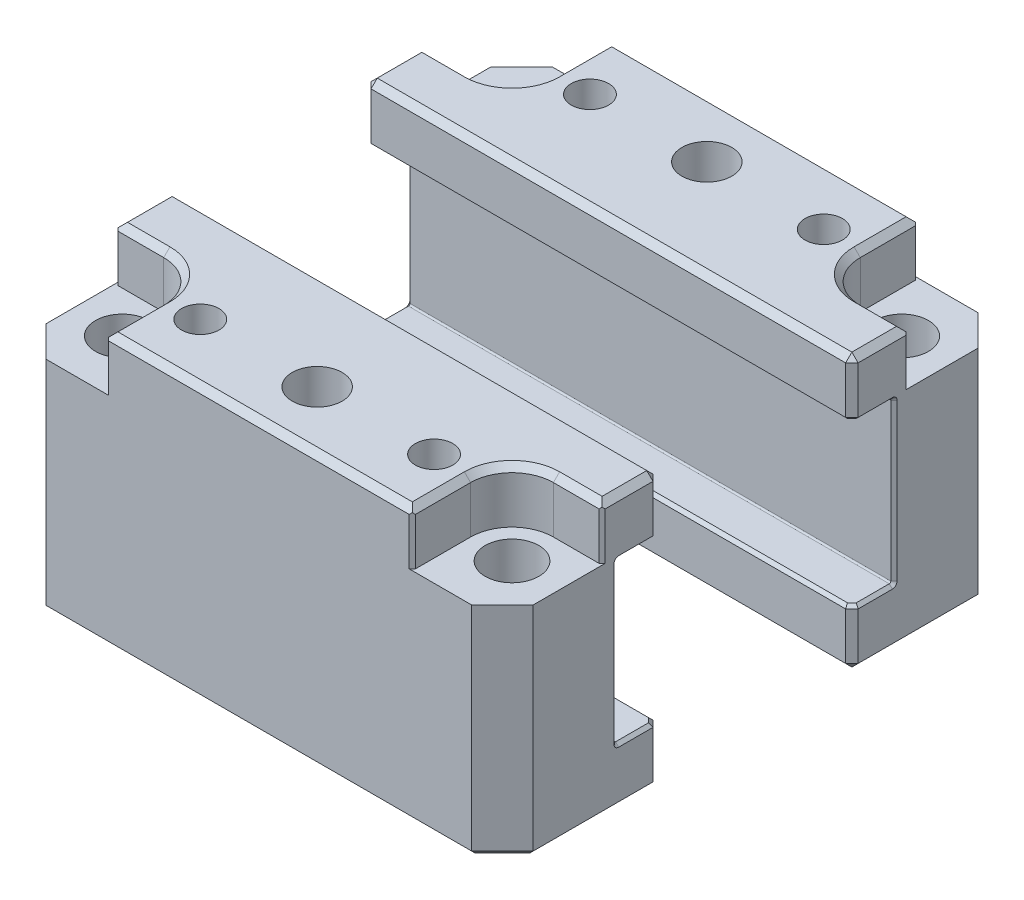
ISO-10303-21;
HEADER;
FILE_DESCRIPTION(('STEP AP214'),'2;1');
FILE_NAME('part.step','',(''),(''),'','','');
FILE_SCHEMA(('AUTOMOTIVE_DESIGN { 1 0 10303 214 1 1 1 1 }'));
ENDSEC;
DATA;
#1=APPLICATION_CONTEXT('core data for automotive mechanical design processes');
#2=APPLICATION_PROTOCOL_DEFINITION('international standard','automotive_design',2000,#1);
#3=PRODUCT_CONTEXT('',#1,'mechanical');
#4=PRODUCT('Part','Part','',(#3));
#5=PRODUCT_RELATED_PRODUCT_CATEGORY('part','',(#4));
#6=PRODUCT_DEFINITION_FORMATION('','',#4);
#7=PRODUCT_DEFINITION_CONTEXT('part definition',#1,'design');
#8=PRODUCT_DEFINITION('design','',#6,#7);
#9=PRODUCT_DEFINITION_SHAPE('','',#8);
#10=(LENGTH_UNIT() NAMED_UNIT(*) SI_UNIT(.MILLI.,.METRE.));
#11=(NAMED_UNIT(*) PLANE_ANGLE_UNIT() SI_UNIT($,.RADIAN.));
#12=(NAMED_UNIT(*) SI_UNIT($,.STERADIAN.) SOLID_ANGLE_UNIT());
#13=UNCERTAINTY_MEASURE_WITH_UNIT(LENGTH_MEASURE(1.E-05),#10,'distance_accuracy_value','');
#14=(GEOMETRIC_REPRESENTATION_CONTEXT(3) GLOBAL_UNCERTAINTY_ASSIGNED_CONTEXT((#13)) GLOBAL_UNIT_ASSIGNED_CONTEXT((#10,
#11,#12)) REPRESENTATION_CONTEXT('',''));
#15=CARTESIAN_POINT('',(0.,0.,0.));
#16=DIRECTION('',(0.,0.,1.));
#17=DIRECTION('',(1.,0.,0.));
#18=AXIS2_PLACEMENT_3D('',#15,#16,#17);
#19=CARTESIAN_POINT('',(39.6875,0.,-15.6972));
#20=DIRECTION('',(0.,0.,-1.));
#21=DIRECTION('',(1.,0.,0.));
#22=AXIS2_PLACEMENT_3D('',#19,#20,#21);
#23=PLANE('',#22);
#24=DIRECTION('',(0.,-1.,0.));
#25=VECTOR('',#24,1.);
#26=CARTESIAN_POINT('',(38.6715,35.2298,-15.6972));
#27=LINE('',#26,#25);
#28=CARTESIAN_POINT('',(38.6715,43.434,-15.6972));
#29=VERTEX_POINT('',#28);
#30=CARTESIAN_POINT('',(38.6715,35.7378,-15.6972));
#31=VERTEX_POINT('',#30);
#32=EDGE_CURVE('E458',#29,#31,#27,.T.);
#33=ORIENTED_EDGE('',*,*,#32,.F.);
#34=DIRECTION('',(1.,0.,0.));
#35=VECTOR('',#34,1.);
#36=CARTESIAN_POINT('',(39.6875,43.434,-15.6972));
#37=LINE('',#36,#35);
#38=CARTESIAN_POINT('',(-38.6715,43.434,-15.6972));
#39=VERTEX_POINT('',#38);
#40=EDGE_CURVE('E461',#39,#29,#37,.T.);
#41=ORIENTED_EDGE('',*,*,#40,.F.);
#42=DIRECTION('',(0.,1.,0.));
#43=VECTOR('',#42,1.);
#44=CARTESIAN_POINT('',(-38.6715,0.,-15.6972));
#45=LINE('',#44,#43);
#46=CARTESIAN_POINT('',(-38.6715,35.7378,-15.6972));
#47=VERTEX_POINT('',#46);
#48=EDGE_CURVE('E464',#47,#39,#45,.T.);
#49=ORIENTED_EDGE('',*,*,#48,.F.);
#50=DIRECTION('',(-1.,0.,0.));
#51=VECTOR('',#50,1.);
#52=CARTESIAN_POINT('',(39.6875,35.7378,-15.6972));
#53=LINE('',#52,#51);
#54=EDGE_CURVE('E712',#31,#47,#53,.T.);
#55=ORIENTED_EDGE('',*,*,#54,.F.);
#56=EDGE_LOOP('',(#33,#41,#49,#55));
#57=FACE_BOUND('',#56,.T.);
#58=ADVANCED_FACE('F47',(#57),#23,.F.);
#59=CARTESIAN_POINT('',(39.6875,0.,-41.2496));
#60=DIRECTION('',(0.,1.,0.));
#61=DIRECTION('',(0.,0.,-1.));
#62=AXIS2_PLACEMENT_3D('',#59,#60,#61);
#63=PLANE('',#62);
#64=CARTESIAN_POINT('',(19.05,0.,-31.75));
#65=DIRECTION('',(0.,-1.,0.));
#66=DIRECTION('',(0.,0.,-1.));
#67=AXIS2_PLACEMENT_3D('',#64,#65,#66);
#68=CIRCLE('',#67,3.68299999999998);
#69=CARTESIAN_POINT('',(19.05,0.,-35.433));
#70=VERTEX_POINT('',#69);
#71=EDGE_CURVE('E55',#70,#70,#68,.T.);
#72=ORIENTED_EDGE('',*,*,#71,.F.);
#73=EDGE_LOOP('',(#72));
#74=FACE_BOUND('',#73,.T.);
#75=CARTESIAN_POINT('',(-19.05,0.,-31.75));
#76=DIRECTION('',(0.,-1.,0.));
#77=DIRECTION('',(0.,0.,-1.));
#78=AXIS2_PLACEMENT_3D('',#75,#76,#77);
#79=CIRCLE('',#78,3.68299999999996);
#80=CARTESIAN_POINT('',(-19.05,0.,-35.433));
#81=VERTEX_POINT('',#80);
#82=EDGE_CURVE('E749',#81,#81,#79,.T.);
#83=ORIENTED_EDGE('',*,*,#82,.F.);
#84=EDGE_LOOP('',(#83));
#85=FACE_BOUND('',#84,.T.);
#86=DIRECTION('',(0.,0.,1.));
#87=VECTOR('',#86,1.);
#88=CARTESIAN_POINT('',(-38.6715,0.,-41.2496));
#89=LINE('',#88,#87);
#90=CARTESIAN_POINT('',(-38.6715,0.,-35.8287590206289));
#91=VERTEX_POINT('',#90);
#92=CARTESIAN_POINT('',(-38.6715,0.,-16.7132));
#93=VERTEX_POINT('',#92);
#94=EDGE_CURVE('E513',#91,#93,#89,.T.);
#95=ORIENTED_EDGE('',*,*,#94,.F.);
#96=DIRECTION('',(-0.707106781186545,0.,0.707106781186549));
#97=VECTOR('',#96,1.);
#98=CARTESIAN_POINT('',(-38.9690795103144,0.,-35.5311795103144));
#99=LINE('',#98,#97);
#100=CARTESIAN_POINT('',(-34.2666590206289,0.,-40.2336));
#101=VERTEX_POINT('',#100);
#102=EDGE_CURVE('E510',#101,#91,#99,.T.);
#103=ORIENTED_EDGE('',*,*,#102,.F.);
#104=DIRECTION('',(-1.,0.,0.));
#105=VECTOR('',#104,1.);
#106=CARTESIAN_POINT('',(39.6875,0.,-40.2336));
#107=LINE('',#106,#105);
#108=CARTESIAN_POINT('',(34.2666590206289,0.,-40.2336));
#109=VERTEX_POINT('',#108);
#110=EDGE_CURVE('E507',#109,#101,#107,.T.);
#111=ORIENTED_EDGE('',*,*,#110,.F.);
#112=DIRECTION('',(-0.707106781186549,0.,-0.707106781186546));
#113=VECTOR('',#112,1.);
#114=CARTESIAN_POINT('',(33.9690795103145,0.,-40.5311795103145));
#115=LINE('',#114,#113);
#116=CARTESIAN_POINT('',(38.6715,0.,-35.828759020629));
#117=VERTEX_POINT('',#116);
#118=EDGE_CURVE('E504',#117,#109,#115,.T.);
#119=ORIENTED_EDGE('',*,*,#118,.F.);
#120=DIRECTION('',(0.,0.,-1.));
#121=VECTOR('',#120,1.);
#122=CARTESIAN_POINT('',(38.6715,0.,-36.2496));
#123=LINE('',#122,#121);
#124=CARTESIAN_POINT('',(38.6715,0.,-16.7132));
#125=VERTEX_POINT('',#124);
#126=EDGE_CURVE('E501',#125,#117,#123,.T.);
#127=ORIENTED_EDGE('',*,*,#126,.F.);
#128=DIRECTION('',(1.,0.,0.));
#129=VECTOR('',#128,1.);
#130=CARTESIAN_POINT('',(39.6875,0.,-16.7132));
#131=LINE('',#130,#129);
#132=EDGE_CURVE('E516',#93,#125,#131,.T.);
#133=ORIENTED_EDGE('',*,*,#132,.F.);
#134=EDGE_LOOP('',(#95,#103,#111,#119,#127,#133));
#135=FACE_BOUND('',#134,.T.);
#136=CARTESIAN_POINT('',(-31.75,0.,-31.75));
#137=DIRECTION('',(0.,1.,0.));
#138=DIRECTION('',(0.,0.,1.));
#139=AXIS2_PLACEMENT_3D('',#136,#137,#138);
#140=CIRCLE('',#139,4.36879999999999);
#141=CARTESIAN_POINT('',(-31.75,0.,-27.3812));
#142=VERTEX_POINT('',#141);
#143=EDGE_CURVE('E557',#142,#142,#140,.T.);
#144=ORIENTED_EDGE('',*,*,#143,.T.);
#145=EDGE_LOOP('',(#144));
#146=FACE_BOUND('',#145,.T.);
#147=CARTESIAN_POINT('',(31.75,0.,-31.75));
#148=DIRECTION('',(0.,1.,0.));
#149=DIRECTION('',(0.,0.,1.));
#150=AXIS2_PLACEMENT_3D('',#147,#148,#149);
#151=CIRCLE('',#150,4.36879999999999);
#152=CARTESIAN_POINT('',(31.75,0.,-27.3812));
#153=VERTEX_POINT('',#152);
#154=EDGE_CURVE('E773',#153,#153,#151,.T.);
#155=ORIENTED_EDGE('',*,*,#154,.T.);
#156=EDGE_LOOP('',(#155));
#157=FACE_BOUND('',#156,.T.);
#158=ADVANCED_FACE('F757',(#74,#85,#135,#146,#157),#63,.F.);
#159=DIRECTION('',(0.,1.,0.));
#160=VECTOR('',#159,1.);
#161=CARTESIAN_POINT('',(-38.6715,0.,-15.6972));
#162=LINE('',#161,#160);
#163=CARTESIAN_POINT('',(-38.6715,1.016,-15.6972));
#164=VERTEX_POINT('',#163);
#165=CARTESIAN_POINT('',(-38.6715,8.71220000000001,-15.6972));
#166=VERTEX_POINT('',#165);
#167=EDGE_CURVE('E498',#164,#166,#162,.T.);
#168=ORIENTED_EDGE('',*,*,#167,.F.);
#169=DIRECTION('',(-1.,0.,0.));
#170=VECTOR('',#169,1.);
#171=CARTESIAN_POINT('',(39.6875,1.016,-15.6972));
#172=LINE('',#171,#170);
#173=CARTESIAN_POINT('',(38.6715,1.016,-15.6972));
#174=VERTEX_POINT('',#173);
#175=EDGE_CURVE('E495',#174,#164,#172,.T.);
#176=ORIENTED_EDGE('',*,*,#175,.F.);
#177=DIRECTION('',(0.,-1.,0.));
#178=VECTOR('',#177,1.);
#179=CARTESIAN_POINT('',(38.6715,0.,-15.6972));
#180=LINE('',#179,#178);
#181=CARTESIAN_POINT('',(38.6715,8.7122,-15.6972));
#182=VERTEX_POINT('',#181);
#183=EDGE_CURVE('E492',#182,#174,#180,.T.);
#184=ORIENTED_EDGE('',*,*,#183,.F.);
#185=DIRECTION('',(1.,0.,0.));
#186=VECTOR('',#185,1.);
#187=CARTESIAN_POINT('',(39.6875,8.7122,-15.6972));
#188=LINE('',#187,#186);
#189=EDGE_CURVE('E643',#166,#182,#188,.T.);
#190=ORIENTED_EDGE('',*,*,#189,.F.);
#191=EDGE_LOOP('',(#168,#176,#184,#190));
#192=FACE_BOUND('',#191,.T.);
#193=ADVANCED_FACE('F760',(#192),#23,.F.);
#194=CARTESIAN_POINT('',(39.6875,44.45,-15.6972));
#195=DIRECTION('',(0.,-1.,0.));
#196=DIRECTION('',(0.,0.,1.));
#197=AXIS2_PLACEMENT_3D('',#194,#195,#196);
#198=PLANE('',#197);
#199=CARTESIAN_POINT('',(-31.75,44.45,-31.75));
#200=DIRECTION('',(0.,1.,0.));
#201=DIRECTION('',(0.,0.,1.));
#202=AXIS2_PLACEMENT_3D('',#199,#200,#201);
#203=CIRCLE('',#202,7.76351);
#204=CARTESIAN_POINT('',(-31.75,44.45,-23.98649));
#205=VERTEX_POINT('',#204);
#206=CARTESIAN_POINT('',(-23.98649,44.45,-31.75));
#207=VERTEX_POINT('',#206);
#208=EDGE_CURVE('E434',#205,#207,#203,.T.);
#209=ORIENTED_EDGE('',*,*,#208,.F.);
#210=DIRECTION('',(1.,0.,0.));
#211=VECTOR('',#210,1.);
#212=CARTESIAN_POINT('',(39.6875,44.45,-23.98649));
#213=LINE('',#212,#211);
#214=CARTESIAN_POINT('',(-38.6715,44.45,-23.98649));
#215=VERTEX_POINT('',#214);
#216=EDGE_CURVE('E431',#215,#205,#213,.T.);
#217=ORIENTED_EDGE('',*,*,#216,.F.);
#218=DIRECTION('',(0.,0.,-1.));
#219=VECTOR('',#218,1.);
#220=CARTESIAN_POINT('',(-38.6715,44.45,-15.6972));
#221=LINE('',#220,#219);
#222=CARTESIAN_POINT('',(-38.6715,44.45,-16.7132));
#223=VERTEX_POINT('',#222);
#224=EDGE_CURVE('E428',#223,#215,#221,.T.);
#225=ORIENTED_EDGE('',*,*,#224,.F.);
#226=DIRECTION('',(-1.,0.,0.));
#227=VECTOR('',#226,1.);
#228=CARTESIAN_POINT('',(39.6875,44.45,-16.7132));
#229=LINE('',#228,#227);
#230=CARTESIAN_POINT('',(38.6715,44.45,-16.7132));
#231=VERTEX_POINT('',#230);
#232=EDGE_CURVE('E425',#231,#223,#229,.T.);
#233=ORIENTED_EDGE('',*,*,#232,.F.);
#234=DIRECTION('',(0.,0.,1.));
#235=VECTOR('',#234,1.);
#236=CARTESIAN_POINT('',(38.6715,44.45,-15.6972));
#237=LINE('',#236,#235);
#238=CARTESIAN_POINT('',(38.6715,44.45,-23.98649));
#239=VERTEX_POINT('',#238);
#240=EDGE_CURVE('E410',#239,#231,#237,.T.);
#241=ORIENTED_EDGE('',*,*,#240,.F.);
#242=DIRECTION('',(1.,0.,0.));
#243=VECTOR('',#242,1.);
#244=CARTESIAN_POINT('',(39.6875,44.45,-23.98649));
#245=LINE('',#244,#243);
#246=CARTESIAN_POINT('',(31.75,44.45,-23.98649));
#247=VERTEX_POINT('',#246);
#248=EDGE_CURVE('E413',#247,#239,#245,.T.);
#249=ORIENTED_EDGE('',*,*,#248,.F.);
#250=CARTESIAN_POINT('',(31.75,44.45,-31.75));
#251=DIRECTION('',(0.,1.,0.));
#252=DIRECTION('',(0.,0.,1.));
#253=AXIS2_PLACEMENT_3D('',#250,#251,#252);
#254=CIRCLE('',#253,7.76351);
#255=CARTESIAN_POINT('',(23.98649,44.45,-31.75));
#256=VERTEX_POINT('',#255);
#257=EDGE_CURVE('E416',#256,#247,#254,.T.);
#258=ORIENTED_EDGE('',*,*,#257,.F.);
#259=DIRECTION('',(0.,0.,1.));
#260=VECTOR('',#259,1.);
#261=CARTESIAN_POINT('',(23.98649,44.45,-15.6972));
#262=LINE('',#261,#260);
#263=CARTESIAN_POINT('',(23.98649,44.45,-40.2336));
#264=VERTEX_POINT('',#263);
#265=EDGE_CURVE('E419',#264,#256,#262,.T.);
#266=ORIENTED_EDGE('',*,*,#265,.F.);
#267=DIRECTION('',(1.,0.,0.));
#268=VECTOR('',#267,1.);
#269=CARTESIAN_POINT('',(39.6875,44.45,-40.2336));
#270=LINE('',#269,#268);
#271=CARTESIAN_POINT('',(-23.98649,44.45,-40.2336));
#272=VERTEX_POINT('',#271);
#273=EDGE_CURVE('E422',#272,#264,#270,.T.);
#274=ORIENTED_EDGE('',*,*,#273,.F.);
#275=DIRECTION('',(0.,0.,-1.));
#276=VECTOR('',#275,1.);
#277=CARTESIAN_POINT('',(-23.98649,44.45,-15.6972));
#278=LINE('',#277,#276);
#279=EDGE_CURVE('E437',#207,#272,#278,.T.);
#280=ORIENTED_EDGE('',*,*,#279,.F.);
#281=EDGE_LOOP('',(#209,#217,#225,#233,#241,#249,#258,#266,#274,#280));
#282=FACE_BOUND('',#281,.T.);
#283=CARTESIAN_POINT('',(19.05,44.45,-31.75));
#284=DIRECTION('',(0.,1.,0.));
#285=DIRECTION('',(1.,0.,0.));
#286=AXIS2_PLACEMENT_3D('',#283,#284,#285);
#287=CIRCLE('',#286,3.048);
#288=CARTESIAN_POINT('',(22.098,44.45,-31.75));
#289=VERTEX_POINT('',#288);
#290=EDGE_CURVE('E815',#289,#289,#287,.T.);
#291=ORIENTED_EDGE('',*,*,#290,.F.);
#292=EDGE_LOOP('',(#291));
#293=FACE_BOUND('',#292,.T.);
#294=CARTESIAN_POINT('',(-19.05,44.45,-31.75));
#295=DIRECTION('',(0.,-1.,0.));
#296=DIRECTION('',(-1.,0.,0.));
#297=AXIS2_PLACEMENT_3D('',#294,#295,#296);
#298=CIRCLE('',#297,3.048);
#299=CARTESIAN_POINT('',(-22.098,44.45,-31.75));
#300=VERTEX_POINT('',#299);
#301=EDGE_CURVE('E824',#300,#300,#298,.T.);
#302=ORIENTED_EDGE('',*,*,#301,.T.);
#303=EDGE_LOOP('',(#302));
#304=FACE_BOUND('',#303,.T.);
#305=CARTESIAN_POINT('',(0.,44.45,-31.75));
#306=DIRECTION('',(0.,-1.,0.));
#307=DIRECTION('',(0.,0.,-1.));
#308=AXIS2_PLACEMENT_3D('',#305,#306,#307);
#309=CIRCLE('',#308,4.064);
#310=CARTESIAN_POINT('',(0.,44.45,-35.814));
#311=VERTEX_POINT('',#310);
#312=EDGE_CURVE('E827',#311,#311,#309,.T.);
#313=ORIENTED_EDGE('',*,*,#312,.T.);
#314=EDGE_LOOP('',(#313));
#315=FACE_BOUND('',#314,.T.);
#316=ADVANCED_FACE('F857',(#282,#293,#304,#315),#198,.F.);
#317=CARTESIAN_POINT('',(39.6875,44.45,-41.2496));
#318=DIRECTION('',(0.,0.,1.));
#319=DIRECTION('',(0.,1.,0.));
#320=AXIS2_PLACEMENT_3D('',#317,#318,#319);
#321=PLANE('',#320);
#322=DIRECTION('',(1.,0.,0.));
#323=VECTOR('',#322,1.);
#324=CARTESIAN_POINT('',(39.6875,35.7505,-41.2496));
#325=LINE('',#324,#323);
#326=CARTESIAN_POINT('',(24.49449,35.7505,-41.2496));
#327=VERTEX_POINT('',#326);
#328=CARTESIAN_POINT('',(34.6875,35.7505,-41.2496));
#329=VERTEX_POINT('',#328);
#330=EDGE_CURVE('E784',#327,#329,#325,.T.);
#331=ORIENTED_EDGE('',*,*,#330,.T.);
#332=DIRECTION('',(0.,1.,0.));
#333=VECTOR('',#332,1.);
#334=CARTESIAN_POINT('',(34.6875,44.45,-41.2496));
#335=LINE('',#334,#333);
#336=CARTESIAN_POINT('',(34.6875,1.016,-41.2496));
#337=VERTEX_POINT('',#336);
#338=EDGE_CURVE('E385',#337,#329,#335,.T.);
#339=ORIENTED_EDGE('',*,*,#338,.F.);
#340=DIRECTION('',(1.,0.,0.));
#341=VECTOR('',#340,1.);
#342=CARTESIAN_POINT('',(39.6875,1.01600000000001,-41.2496));
#343=LINE('',#342,#341);
#344=CARTESIAN_POINT('',(-34.6875,1.01600000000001,-41.2496));
#345=VERTEX_POINT('',#344);
#346=EDGE_CURVE('E467',#345,#337,#343,.T.);
#347=ORIENTED_EDGE('',*,*,#346,.F.);
#348=DIRECTION('',(0.,-1.,0.));
#349=VECTOR('',#348,1.);
#350=CARTESIAN_POINT('',(-34.6875,44.45,-41.2496));
#351=LINE('',#350,#349);
#352=CARTESIAN_POINT('',(-34.6875,35.7505,-41.2496));
#353=VERTEX_POINT('',#352);
#354=EDGE_CURVE('E376',#353,#345,#351,.T.);
#355=ORIENTED_EDGE('',*,*,#354,.F.);
#356=DIRECTION('',(1.,0.,0.));
#357=VECTOR('',#356,1.);
#358=CARTESIAN_POINT('',(-39.6875,35.7505,-41.2496));
#359=LINE('',#358,#357);
#360=CARTESIAN_POINT('',(-24.49449,35.7505,-41.2496));
#361=VERTEX_POINT('',#360);
#362=EDGE_CURVE('E799',#353,#361,#359,.T.);
#363=ORIENTED_EDGE('',*,*,#362,.T.);
#364=DIRECTION('',(0.,-1.,0.));
#365=VECTOR('',#364,1.);
#366=CARTESIAN_POINT('',(-24.49449,44.45,-41.2496));
#367=LINE('',#366,#365);
#368=CARTESIAN_POINT('',(-24.49449,43.434,-41.2496));
#369=VERTEX_POINT('',#368);
#370=EDGE_CURVE('E587',#369,#361,#367,.T.);
#371=ORIENTED_EDGE('',*,*,#370,.F.);
#372=DIRECTION('',(-1.,0.,0.));
#373=VECTOR('',#372,1.);
#374=CARTESIAN_POINT('',(39.6875,43.434,-41.2496));
#375=LINE('',#374,#373);
#376=CARTESIAN_POINT('',(24.49449,43.434,-41.2496));
#377=VERTEX_POINT('',#376);
#378=EDGE_CURVE('E470',#377,#369,#375,.T.);
#379=ORIENTED_EDGE('',*,*,#378,.F.);
#380=DIRECTION('',(0.,1.,0.));
#381=VECTOR('',#380,1.);
#382=CARTESIAN_POINT('',(24.49449,44.45,-41.2496));
#383=LINE('',#382,#381);
#384=EDGE_CURVE('E590',#327,#377,#383,.T.);
#385=ORIENTED_EDGE('',*,*,#384,.F.);
#386=EDGE_LOOP('',(#331,#339,#347,#355,#363,#371,#379,#385));
#387=FACE_BOUND('',#386,.T.);
#388=ADVANCED_FACE('F862',(#387),#321,.F.);
#389=CARTESIAN_POINT('',(39.6875,0.,0.));
#390=DIRECTION('',(1.,0.,0.));
#391=DIRECTION('',(0.,0.,1.));
#392=AXIS2_PLACEMENT_3D('',#389,#390,#391);
#393=PLANE('',#392);
#394=DIRECTION('',(0.,1.,0.));
#395=VECTOR('',#394,1.);
#396=CARTESIAN_POINT('',(39.6875,9.2202,-16.7132));
#397=LINE('',#396,#395);
#398=CARTESIAN_POINT('',(39.6875,1.016,-16.7132));
#399=VERTEX_POINT('',#398);
#400=CARTESIAN_POINT('',(39.6875,8.71219999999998,-16.7132));
#401=VERTEX_POINT('',#400);
#402=EDGE_CURVE('E480',#399,#401,#397,.T.);
#403=ORIENTED_EDGE('',*,*,#402,.F.);
#404=DIRECTION('',(0.,0.,1.));
#405=VECTOR('',#404,1.);
#406=CARTESIAN_POINT('',(39.6875,1.016,-15.6972));
#407=LINE('',#406,#405);
#408=CARTESIAN_POINT('',(39.6875,1.016,-36.2496));
#409=VERTEX_POINT('',#408);
#410=EDGE_CURVE('E483',#409,#399,#407,.T.);
#411=ORIENTED_EDGE('',*,*,#410,.F.);
#412=DIRECTION('',(0.,-1.,0.));
#413=VECTOR('',#412,1.);
#414=CARTESIAN_POINT('',(39.6875,0.,-36.2496));
#415=LINE('',#414,#413);
#416=CARTESIAN_POINT('',(39.6875,35.7505,-36.2496));
#417=VERTEX_POINT('',#416);
#418=EDGE_CURVE('E372',#417,#409,#415,.T.);
#419=ORIENTED_EDGE('',*,*,#418,.F.);
#420=DIRECTION('',(0.,0.,1.));
#421=VECTOR('',#420,1.);
#422=CARTESIAN_POINT('',(39.6875,35.7505,-25.00249));
#423=LINE('',#422,#421);
#424=CARTESIAN_POINT('',(39.6875,35.7505,-24.49449));
#425=VERTEX_POINT('',#424);
#426=EDGE_CURVE('E365',#417,#425,#423,.T.);
#427=ORIENTED_EDGE('',*,*,#426,.T.);
#428=DIRECTION('',(0.,-1.,0.));
#429=VECTOR('',#428,1.);
#430=CARTESIAN_POINT('',(39.6875,35.7505,-24.49449));
#431=LINE('',#430,#429);
#432=CARTESIAN_POINT('',(39.6875,43.434,-24.49449));
#433=VERTEX_POINT('',#432);
#434=EDGE_CURVE('E584',#433,#425,#431,.T.);
#435=ORIENTED_EDGE('',*,*,#434,.F.);
#436=DIRECTION('',(0.,0.,-1.));
#437=VECTOR('',#436,1.);
#438=CARTESIAN_POINT('',(39.6875,43.434,-25.00249));
#439=LINE('',#438,#437);
#440=CARTESIAN_POINT('',(39.6875,43.434,-16.7132));
#441=VERTEX_POINT('',#440);
#442=EDGE_CURVE('E489',#441,#433,#439,.T.);
#443=ORIENTED_EDGE('',*,*,#442,.F.);
#444=DIRECTION('',(0.,1.,0.));
#445=VECTOR('',#444,1.);
#446=CARTESIAN_POINT('',(39.6875,44.45,-16.7132));
#447=LINE('',#446,#445);
#448=CARTESIAN_POINT('',(39.6875,35.7378,-16.7132));
#449=VERTEX_POINT('',#448);
#450=EDGE_CURVE('E486',#449,#441,#447,.T.);
#451=ORIENTED_EDGE('',*,*,#450,.F.);
#452=DIRECTION('',(0.,0.,1.));
#453=VECTOR('',#452,1.);
#454=CARTESIAN_POINT('',(39.6875,35.7378,-16.7132));
#455=LINE('',#454,#453);
#456=CARTESIAN_POINT('',(39.6875,35.7378,-22.3012));
#457=VERTEX_POINT('',#456);
#458=EDGE_CURVE('E664',#457,#449,#455,.T.);
#459=ORIENTED_EDGE('',*,*,#458,.F.);
#460=CARTESIAN_POINT('',(39.6875,34.9758,-22.3012));
#461=DIRECTION('',(-1.,0.,0.));
#462=DIRECTION('',(0.,0.,1.));
#463=AXIS2_PLACEMENT_3D('',#460,#461,#462);
#464=CIRCLE('',#463,0.76200000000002);
#465=CARTESIAN_POINT('',(39.6875,34.9758,-23.0632));
#466=VERTEX_POINT('',#465);
#467=EDGE_CURVE('E667',#466,#457,#464,.F.);
#468=ORIENTED_EDGE('',*,*,#467,.F.);
#469=DIRECTION('',(0.,1.,0.));
#470=VECTOR('',#469,1.);
#471=CARTESIAN_POINT('',(39.6875,34.9758,-23.0632));
#472=LINE('',#471,#470);
#473=CARTESIAN_POINT('',(39.6875,9.4742,-23.0632));
#474=VERTEX_POINT('',#473);
#475=EDGE_CURVE('E670',#474,#466,#472,.T.);
#476=ORIENTED_EDGE('',*,*,#475,.F.);
#477=CARTESIAN_POINT('',(39.6875,9.4742,-22.3012));
#478=DIRECTION('',(-1.,0.,0.));
#479=DIRECTION('',(0.,0.,1.));
#480=AXIS2_PLACEMENT_3D('',#477,#478,#479);
#481=CIRCLE('',#480,0.762000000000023);
#482=CARTESIAN_POINT('',(39.6875,8.71219999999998,-22.3012));
#483=VERTEX_POINT('',#482);
#484=EDGE_CURVE('E673',#483,#474,#481,.F.);
#485=ORIENTED_EDGE('',*,*,#484,.F.);
#486=DIRECTION('',(0.,0.,-1.));
#487=VECTOR('',#486,1.);
#488=CARTESIAN_POINT('',(39.6875,8.71219999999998,-22.3012));
#489=LINE('',#488,#487);
#490=EDGE_CURVE('E676',#401,#483,#489,.T.);
#491=ORIENTED_EDGE('',*,*,#490,.F.);
#492=EDGE_LOOP('',(#403,#411,#419,#427,#435,#443,#451,#459,#468,#476,#485,#491));
#493=FACE_BOUND('',#492,.T.);
#494=ADVANCED_FACE('F934',(#493),#393,.T.);
#495=CARTESIAN_POINT('',(-39.6875,0.,0.));
#496=DIRECTION('',(1.,0.,0.));
#497=DIRECTION('',(0.,0.,1.));
#498=AXIS2_PLACEMENT_3D('',#495,#496,#497);
#499=PLANE('',#498);
#500=CARTESIAN_POINT('',(-39.6875,9.4742,-22.3012));
#501=DIRECTION('',(-1.,0.,0.));
#502=DIRECTION('',(0.,0.,1.));
#503=AXIS2_PLACEMENT_3D('',#500,#501,#502);
#504=CIRCLE('',#503,0.762000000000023);
#505=CARTESIAN_POINT('',(-39.6875,9.4742,-23.0632));
#506=VERTEX_POINT('',#505);
#507=CARTESIAN_POINT('',(-39.6875,8.71219999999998,-22.3012));
#508=VERTEX_POINT('',#507);
#509=EDGE_CURVE('E658',#506,#508,#504,.T.);
#510=ORIENTED_EDGE('',*,*,#509,.F.);
#511=DIRECTION('',(0.,-1.,0.));
#512=VECTOR('',#511,1.);
#513=CARTESIAN_POINT('',(-39.6875,0.,-23.0632));
#514=LINE('',#513,#512);
#515=CARTESIAN_POINT('',(-39.6875,34.9758,-23.0632));
#516=VERTEX_POINT('',#515);
#517=EDGE_CURVE('E655',#516,#506,#514,.T.);
#518=ORIENTED_EDGE('',*,*,#517,.F.);
#519=CARTESIAN_POINT('',(-39.6875,34.9758,-22.3012));
#520=DIRECTION('',(-1.,0.,0.));
#521=DIRECTION('',(0.,0.,1.));
#522=AXIS2_PLACEMENT_3D('',#519,#520,#521);
#523=CIRCLE('',#522,0.76200000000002);
#524=CARTESIAN_POINT('',(-39.6875,35.7378,-22.3012));
#525=VERTEX_POINT('',#524);
#526=EDGE_CURVE('E652',#525,#516,#523,.T.);
#527=ORIENTED_EDGE('',*,*,#526,.F.);
#528=DIRECTION('',(0.,0.,-1.));
#529=VECTOR('',#528,1.);
#530=CARTESIAN_POINT('',(-39.6875,35.7378,0.));
#531=LINE('',#530,#529);
#532=CARTESIAN_POINT('',(-39.6875,35.7378,-16.7132));
#533=VERTEX_POINT('',#532);
#534=EDGE_CURVE('E649',#533,#525,#531,.T.);
#535=ORIENTED_EDGE('',*,*,#534,.F.);
#536=DIRECTION('',(0.,-1.,0.));
#537=VECTOR('',#536,1.);
#538=CARTESIAN_POINT('',(-39.6875,0.,-16.7132));
#539=LINE('',#538,#537);
#540=CARTESIAN_POINT('',(-39.6875,43.434,-16.7132));
#541=VERTEX_POINT('',#540);
#542=EDGE_CURVE('E452',#541,#533,#539,.T.);
#543=ORIENTED_EDGE('',*,*,#542,.F.);
#544=DIRECTION('',(0.,0.,1.));
#545=VECTOR('',#544,1.);
#546=CARTESIAN_POINT('',(-39.6875,43.434,0.));
#547=LINE('',#546,#545);
#548=CARTESIAN_POINT('',(-39.6875,43.434,-24.49449));
#549=VERTEX_POINT('',#548);
#550=EDGE_CURVE('E455',#549,#541,#547,.T.);
#551=ORIENTED_EDGE('',*,*,#550,.F.);
#552=DIRECTION('',(0.,1.,0.));
#553=VECTOR('',#552,1.);
#554=CARTESIAN_POINT('',(-39.6875,0.,-24.49449));
#555=LINE('',#554,#553);
#556=CARTESIAN_POINT('',(-39.6875,35.7505,-24.49449));
#557=VERTEX_POINT('',#556);
#558=EDGE_CURVE('E606',#557,#549,#555,.T.);
#559=ORIENTED_EDGE('',*,*,#558,.F.);
#560=DIRECTION('',(0.,0.,-1.));
#561=VECTOR('',#560,1.);
#562=CARTESIAN_POINT('',(-39.6875,35.7505,-25.00249));
#563=LINE('',#562,#561);
#564=CARTESIAN_POINT('',(-39.6875,35.7505,-36.2496));
#565=VERTEX_POINT('',#564);
#566=EDGE_CURVE('E794',#557,#565,#563,.T.);
#567=ORIENTED_EDGE('',*,*,#566,.T.);
#568=DIRECTION('',(0.,1.,0.));
#569=VECTOR('',#568,1.);
#570=CARTESIAN_POINT('',(-39.6875,0.,-36.2496));
#571=LINE('',#570,#569);
#572=CARTESIAN_POINT('',(-39.6875,1.016,-36.2496));
#573=VERTEX_POINT('',#572);
#574=EDGE_CURVE('E388',#573,#565,#571,.T.);
#575=ORIENTED_EDGE('',*,*,#574,.F.);
#576=DIRECTION('',(0.,0.,-1.));
#577=VECTOR('',#576,1.);
#578=CARTESIAN_POINT('',(-39.6875,1.016,0.));
#579=LINE('',#578,#577);
#580=CARTESIAN_POINT('',(-39.6875,1.016,-16.7132));
#581=VERTEX_POINT('',#580);
#582=EDGE_CURVE('E446',#581,#573,#579,.T.);
#583=ORIENTED_EDGE('',*,*,#582,.F.);
#584=DIRECTION('',(0.,-1.,0.));
#585=VECTOR('',#584,1.);
#586=CARTESIAN_POINT('',(-39.6875,0.,-16.7132));
#587=LINE('',#586,#585);
#588=CARTESIAN_POINT('',(-39.6875,8.71219999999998,-16.7132));
#589=VERTEX_POINT('',#588);
#590=EDGE_CURVE('E449',#589,#581,#587,.T.);
#591=ORIENTED_EDGE('',*,*,#590,.F.);
#592=DIRECTION('',(0.,0.,1.));
#593=VECTOR('',#592,1.);
#594=CARTESIAN_POINT('',(-39.6875,8.71219999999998,0.));
#595=LINE('',#594,#593);
#596=EDGE_CURVE('E661',#508,#589,#595,.T.);
#597=ORIENTED_EDGE('',*,*,#596,.F.);
#598=EDGE_LOOP('',(#510,#518,#527,#535,#543,#551,#559,#567,#575,#583,#591,#597));
#599=FACE_BOUND('',#598,.T.);
#600=ADVANCED_FACE('F922',(#599),#499,.F.);
#601=CARTESIAN_POINT('',(36.11499,35.7505,-31.75));
#602=DIRECTION('',(0.,-1.,0.));
#603=DIRECTION('',(0.,0.,1.));
#604=AXIS2_PLACEMENT_3D('',#601,#602,#603);
#605=PLANE('',#604);
#606=CARTESIAN_POINT('',(31.75,35.7505,-31.75));
#607=DIRECTION('',(0.,1.,0.));
#608=DIRECTION('',(0.,0.,1.));
#609=AXIS2_PLACEMENT_3D('',#606,#607,#608);
#610=CIRCLE('',#609,4.36879999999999);
#611=CARTESIAN_POINT('',(31.75,35.7505,-27.3812));
#612=VERTEX_POINT('',#611);
#613=EDGE_CURVE('E775',#612,#612,#610,.T.);
#614=ORIENTED_EDGE('',*,*,#613,.F.);
#615=EDGE_LOOP('',(#614));
#616=FACE_BOUND('',#615,.T.);
#617=CARTESIAN_POINT('',(31.75,35.7505,-31.75));
#618=DIRECTION('',(0.,-1.,0.));
#619=DIRECTION('',(0.,0.,-1.));
#620=AXIS2_PLACEMENT_3D('',#617,#618,#619);
#621=CIRCLE('',#620,6.74751);
#622=CARTESIAN_POINT('',(31.75,35.7505,-25.00249));
#623=VERTEX_POINT('',#622);
#624=CARTESIAN_POINT('',(25.00249,35.7505,-31.75));
#625=VERTEX_POINT('',#624);
#626=EDGE_CURVE('E351',#623,#625,#621,.T.);
#627=ORIENTED_EDGE('',*,*,#626,.F.);
#628=DIRECTION('',(-1.,0.,0.));
#629=VECTOR('',#628,1.);
#630=CARTESIAN_POINT('',(31.75,35.7505,-25.00249));
#631=LINE('',#630,#629);
#632=CARTESIAN_POINT('',(39.1795,35.7505,-25.00249));
#633=VERTEX_POINT('',#632);
#634=EDGE_CURVE('E357',#633,#623,#631,.T.);
#635=ORIENTED_EDGE('',*,*,#634,.F.);
#636=DIRECTION('',(-0.707106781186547,0.,-0.707106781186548));
#637=VECTOR('',#636,1.);
#638=CARTESIAN_POINT('',(34.27349,35.7505,-29.9085));
#639=LINE('',#638,#637);
#640=EDGE_CURVE('E616',#425,#633,#639,.T.);
#641=ORIENTED_EDGE('',*,*,#640,.F.);
#642=ORIENTED_EDGE('',*,*,#426,.F.);
#643=DIRECTION('',(0.707106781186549,0.,0.707106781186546));
#644=VECTOR('',#643,1.);
#645=CARTESIAN_POINT('',(39.6875,35.7505,-36.2496));
#646=LINE('',#645,#644);
#647=EDGE_CURVE('E393',#329,#417,#646,.T.);
#648=ORIENTED_EDGE('',*,*,#647,.F.);
#649=ORIENTED_EDGE('',*,*,#330,.F.);
#650=DIRECTION('',(0.70710678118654,0.,0.707106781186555));
#651=VECTOR('',#650,1.);
#652=CARTESIAN_POINT('',(35.0545399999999,35.7505,-30.6895499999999));
#653=LINE('',#652,#651);
#654=CARTESIAN_POINT('',(25.00249,35.7505,-40.7416));
#655=VERTEX_POINT('',#654);
#656=EDGE_CURVE('E618',#655,#327,#653,.F.);
#657=ORIENTED_EDGE('',*,*,#656,.F.);
#658=DIRECTION('',(0.,0.,-1.));
#659=VECTOR('',#658,1.);
#660=CARTESIAN_POINT('',(25.00249,35.7505,-41.2496));
#661=LINE('',#660,#659);
#662=EDGE_CURVE('E371',#625,#655,#661,.T.);
#663=ORIENTED_EDGE('',*,*,#662,.F.);
#664=EDGE_LOOP('',(#627,#635,#641,#642,#648,#649,#657,#663));
#665=FACE_BOUND('',#664,.T.);
#666=ADVANCED_FACE('F368',(#616,#665),#605,.F.);
#667=CARTESIAN_POINT('',(31.75,44.45,-31.75));
#668=DIRECTION('',(0.,1.,0.));
#669=DIRECTION('',(0.,0.,-1.));
#670=AXIS2_PLACEMENT_3D('',#667,#668,#669);
#671=CYLINDRICAL_SURFACE('',#670,6.74751);
#672=DIRECTION('',(0.,1.,0.));
#673=VECTOR('',#672,1.);
#674=CARTESIAN_POINT('',(31.75,13.8503150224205,-25.00249));
#675=LINE('',#674,#673);
#676=CARTESIAN_POINT('',(31.75,43.434,-25.00249));
#677=VERTEX_POINT('',#676);
#678=EDGE_CURVE('E346',#623,#677,#675,.T.);
#679=ORIENTED_EDGE('',*,*,#678,.F.);
#680=ORIENTED_EDGE('',*,*,#626,.T.);
#681=DIRECTION('',(0.,1.,0.));
#682=VECTOR('',#681,1.);
#683=CARTESIAN_POINT('',(25.00249,13.8503150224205,-31.75));
#684=LINE('',#683,#682);
#685=CARTESIAN_POINT('',(25.00249,43.434,-31.75));
#686=VERTEX_POINT('',#685);
#687=EDGE_CURVE('E356',#625,#686,#684,.T.);
#688=ORIENTED_EDGE('',*,*,#687,.T.);
#689=CARTESIAN_POINT('',(31.75,43.434,-31.75));
#690=DIRECTION('',(0.,1.,0.));
#691=DIRECTION('',(0.,0.,1.));
#692=AXIS2_PLACEMENT_3D('',#689,#690,#691);
#693=CIRCLE('',#692,6.74751);
#694=EDGE_CURVE('E353',#677,#686,#693,.F.);
#695=ORIENTED_EDGE('',*,*,#694,.F.);
#696=EDGE_LOOP('',(#679,#680,#688,#695));
#697=FACE_BOUND('',#696,.T.);
#698=ADVANCED_FACE('F348',(#697),#671,.F.);
#699=CARTESIAN_POINT('',(-27.38501,35.7505,-31.75));
#700=DIRECTION('',(0.,-1.,0.));
#701=DIRECTION('',(0.,0.,1.));
#702=AXIS2_PLACEMENT_3D('',#699,#700,#701);
#703=PLANE('',#702);
#704=CARTESIAN_POINT('',(-31.75,35.7505,-31.75));
#705=DIRECTION('',(0.,1.,0.));
#706=DIRECTION('',(0.,0.,1.));
#707=AXIS2_PLACEMENT_3D('',#704,#705,#706);
#708=CIRCLE('',#707,4.36879999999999);
#709=CARTESIAN_POINT('',(-31.75,35.7505,-27.3812));
#710=VERTEX_POINT('',#709);
#711=EDGE_CURVE('E776',#710,#710,#708,.T.);
#712=ORIENTED_EDGE('',*,*,#711,.F.);
#713=EDGE_LOOP('',(#712));
#714=FACE_BOUND('',#713,.T.);
#715=CARTESIAN_POINT('',(-31.75,35.7505,-31.75));
#716=DIRECTION('',(0.,-1.,0.));
#717=DIRECTION('',(0.,0.,-1.));
#718=AXIS2_PLACEMENT_3D('',#715,#716,#717);
#719=CIRCLE('',#718,6.74751);
#720=CARTESIAN_POINT('',(-25.00249,35.7505,-31.75));
#721=VERTEX_POINT('',#720);
#722=CARTESIAN_POINT('',(-31.75,35.7505,-25.00249));
#723=VERTEX_POINT('',#722);
#724=EDGE_CURVE('E373',#721,#723,#719,.T.);
#725=ORIENTED_EDGE('',*,*,#724,.F.);
#726=DIRECTION('',(0.,0.,1.));
#727=VECTOR('',#726,1.);
#728=CARTESIAN_POINT('',(-25.00249,35.7505,-41.2496));
#729=LINE('',#728,#727);
#730=CARTESIAN_POINT('',(-25.00249,35.7505,-40.7416));
#731=VERTEX_POINT('',#730);
#732=EDGE_CURVE('E795',#731,#721,#729,.T.);
#733=ORIENTED_EDGE('',*,*,#732,.F.);
#734=DIRECTION('',(0.707106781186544,0.,-0.707106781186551));
#735=VECTOR('',#734,1.);
#736=CARTESIAN_POINT('',(-30.68955,35.7505,-35.05454));
#737=LINE('',#736,#735);
#738=EDGE_CURVE('E620',#361,#731,#737,.F.);
#739=ORIENTED_EDGE('',*,*,#738,.F.);
#740=ORIENTED_EDGE('',*,*,#362,.F.);
#741=DIRECTION('',(-0.707106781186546,0.,0.70710678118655));
#742=VECTOR('',#741,1.);
#743=CARTESIAN_POINT('',(-34.6875,35.7505,-41.2496));
#744=LINE('',#743,#742);
#745=EDGE_CURVE('E391',#565,#353,#744,.F.);
#746=ORIENTED_EDGE('',*,*,#745,.F.);
#747=ORIENTED_EDGE('',*,*,#566,.F.);
#748=DIRECTION('',(0.707106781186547,0.,-0.707106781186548));
#749=VECTOR('',#748,1.);
#750=CARTESIAN_POINT('',(-29.9085,35.7505,-34.27349));
#751=LINE('',#750,#749);
#752=CARTESIAN_POINT('',(-39.1795,35.7505,-25.00249));
#753=VERTEX_POINT('',#752);
#754=EDGE_CURVE('E623',#753,#557,#751,.F.);
#755=ORIENTED_EDGE('',*,*,#754,.F.);
#756=DIRECTION('',(-1.,0.,0.));
#757=VECTOR('',#756,1.);
#758=CARTESIAN_POINT('',(-31.75,35.7505,-25.00249));
#759=LINE('',#758,#757);
#760=EDGE_CURVE('E791',#723,#753,#759,.T.);
#761=ORIENTED_EDGE('',*,*,#760,.F.);
#762=EDGE_LOOP('',(#725,#733,#739,#740,#746,#747,#755,#761));
#763=FACE_BOUND('',#762,.T.);
#764=ADVANCED_FACE('F846',(#714,#763),#703,.F.);
#765=CARTESIAN_POINT('',(-31.75,44.45,-31.75));
#766=DIRECTION('',(0.,1.,0.));
#767=DIRECTION('',(0.,0.,-1.));
#768=AXIS2_PLACEMENT_3D('',#765,#766,#767);
#769=CYLINDRICAL_SURFACE('',#768,6.74751);
#770=DIRECTION('',(0.,1.,0.));
#771=VECTOR('',#770,1.);
#772=CARTESIAN_POINT('',(-25.00249,13.8503150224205,-31.75));
#773=LINE('',#772,#771);
#774=CARTESIAN_POINT('',(-25.00249,43.434,-31.75));
#775=VERTEX_POINT('',#774);
#776=EDGE_CURVE('E798',#721,#775,#773,.T.);
#777=ORIENTED_EDGE('',*,*,#776,.F.);
#778=ORIENTED_EDGE('',*,*,#724,.T.);
#779=DIRECTION('',(0.,1.,0.));
#780=VECTOR('',#779,1.);
#781=CARTESIAN_POINT('',(-31.75,13.8503150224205,-25.00249));
#782=LINE('',#781,#780);
#783=CARTESIAN_POINT('',(-31.75,43.434,-25.00249));
#784=VERTEX_POINT('',#783);
#785=EDGE_CURVE('E806',#723,#784,#782,.T.);
#786=ORIENTED_EDGE('',*,*,#785,.T.);
#787=CARTESIAN_POINT('',(-31.75,43.434,-31.75));
#788=DIRECTION('',(0.,1.,0.));
#789=DIRECTION('',(0.,0.,1.));
#790=AXIS2_PLACEMENT_3D('',#787,#788,#789);
#791=CIRCLE('',#790,6.74751);
#792=EDGE_CURVE('E440',#775,#784,#791,.F.);
#793=ORIENTED_EDGE('',*,*,#792,.F.);
#794=EDGE_LOOP('',(#777,#778,#786,#793));
#795=FACE_BOUND('',#794,.T.);
#796=ADVANCED_FACE('F837',(#795),#769,.F.);
#797=CARTESIAN_POINT('',(0.,16.51,-31.75));
#798=DIRECTION('',(0.,1.,0.));
#799=DIRECTION('',(0.,0.,-1.));
#800=AXIS2_PLACEMENT_3D('',#797,#798,#799);
#801=CONICAL_SURFACE('',#800,4.06399999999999,1.02974425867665);
#802=CARTESIAN_POINT('',(0.,14.068102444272,-31.75));
#803=VERTEX_POINT('',#802);
#804=VERTEX_LOOP('',#803);
#805=FACE_BOUND('',#804,.T.);
#806=CARTESIAN_POINT('',(0.,16.51,-31.75));
#807=DIRECTION('',(0.,-1.,0.));
#808=DIRECTION('',(0.,0.,-1.));
#809=AXIS2_PLACEMENT_3D('',#806,#807,#808);
#810=CIRCLE('',#809,4.06399999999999);
#811=CARTESIAN_POINT('',(0.,16.51,-35.814));
#812=VERTEX_POINT('',#811);
#813=EDGE_CURVE('E379',#812,#812,#810,.T.);
#814=ORIENTED_EDGE('',*,*,#813,.F.);
#815=EDGE_LOOP('',(#814));
#816=FACE_BOUND('',#815,.T.);
#817=ADVANCED_FACE('F835',(#805,#816),#801,.F.);
#818=CARTESIAN_POINT('',(0.,44.45,-31.75));
#819=DIRECTION('',(0.,1.,0.));
#820=DIRECTION('',(0.,0.,-1.));
#821=AXIS2_PLACEMENT_3D('',#818,#819,#820);
#822=CYLINDRICAL_SURFACE('',#821,4.06399999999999);
#823=ORIENTED_EDGE('',*,*,#813,.T.);
#824=EDGE_LOOP('',(#823));
#825=FACE_BOUND('',#824,.T.);
#826=ORIENTED_EDGE('',*,*,#312,.F.);
#827=EDGE_LOOP('',(#826));
#828=FACE_BOUND('',#827,.T.);
#829=ADVANCED_FACE('F832',(#825,#828),#822,.F.);
#830=CARTESIAN_POINT('',(39.6875,0.,-36.2496));
#831=DIRECTION('',(0.707106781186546,0.,-0.707106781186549));
#832=DIRECTION('',(0.,1.,0.));
#833=AXIS2_PLACEMENT_3D('',#830,#831,#832);
#834=PLANE('',#833);
#835=ORIENTED_EDGE('',*,*,#338,.T.);
#836=ORIENTED_EDGE('',*,*,#647,.T.);
#837=ORIENTED_EDGE('',*,*,#418,.T.);
#838=DIRECTION('',(0.707106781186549,0.,0.707106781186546));
#839=VECTOR('',#838,1.);
#840=CARTESIAN_POINT('',(39.6875,1.016,-36.2496));
#841=LINE('',#840,#839);
#842=EDGE_CURVE('E522',#337,#409,#841,.T.);
#843=ORIENTED_EDGE('',*,*,#842,.F.);
#844=EDGE_LOOP('',(#835,#836,#837,#843));
#845=FACE_BOUND('',#844,.T.);
#846=ADVANCED_FACE('F844',(#845),#834,.T.);
#847=CARTESIAN_POINT('',(-34.6875,44.45,-41.2496));
#848=DIRECTION('',(0.707106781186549,0.,0.707106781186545));
#849=DIRECTION('',(0.,-1.,0.));
#850=AXIS2_PLACEMENT_3D('',#847,#848,#849);
#851=PLANE('',#850);
#852=ORIENTED_EDGE('',*,*,#574,.T.);
#853=ORIENTED_EDGE('',*,*,#745,.T.);
#854=ORIENTED_EDGE('',*,*,#354,.T.);
#855=DIRECTION('',(-0.707106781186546,0.,0.70710678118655));
#856=VECTOR('',#855,1.);
#857=CARTESIAN_POINT('',(-34.6875,1.016,-41.2496));
#858=LINE('',#857,#856);
#859=EDGE_CURVE('E519',#573,#345,#858,.F.);
#860=ORIENTED_EDGE('',*,*,#859,.F.);
#861=EDGE_LOOP('',(#852,#853,#854,#860));
#862=FACE_BOUND('',#861,.T.);
#863=ADVANCED_FACE('F1050',(#862),#851,.F.);
#864=CARTESIAN_POINT('',(-19.05,51.2325629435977,-31.75));
#865=DIRECTION('',(0.,1.,0.));
#866=DIRECTION('',(-1.,0.,0.));
#867=AXIS2_PLACEMENT_3D('',#864,#865,#866);
#868=CYLINDRICAL_SURFACE('',#867,3.048);
#869=CARTESIAN_POINT('',(-19.05,12.7763092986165,-31.75));
#870=DIRECTION('',(0.,-1.,0.));
#871=DIRECTION('',(-1.,0.,0.));
#872=AXIS2_PLACEMENT_3D('',#869,#870,#871);
#873=CIRCLE('',#872,3.048);
#874=CARTESIAN_POINT('',(-22.098,12.7763092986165,-31.75));
#875=VERTEX_POINT('',#874);
#876=EDGE_CURVE('E821',#875,#875,#873,.T.);
#877=ORIENTED_EDGE('',*,*,#876,.T.);
#878=EDGE_LOOP('',(#877));
#879=FACE_BOUND('',#878,.T.);
#880=ORIENTED_EDGE('',*,*,#301,.F.);
#881=EDGE_LOOP('',(#880));
#882=FACE_BOUND('',#881,.T.);
#883=ADVANCED_FACE('F1432',(#879,#882),#868,.F.);
#884=CARTESIAN_POINT('',(-19.05,12.7763092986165,-31.75));
#885=DIRECTION('',(0.,-1.,0.));
#886=DIRECTION('',(1.,0.,0.));
#887=AXIS2_PLACEMENT_3D('',#884,#885,#886);
#888=CONICAL_SURFACE('',#887,3.048,1.02974425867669);
#889=CARTESIAN_POINT('',(-19.05,12.7,-31.75));
#890=DIRECTION('',(0.,-1.,0.));
#891=DIRECTION('',(-1.,0.,0.));
#892=AXIS2_PLACEMENT_3D('',#889,#890,#891);
#893=CIRCLE('',#892,3.17499999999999);
#894=CARTESIAN_POINT('',(-22.225,12.7,-31.75));
#895=VERTEX_POINT('',#894);
#896=EDGE_CURVE('E818',#895,#895,#893,.T.);
#897=ORIENTED_EDGE('',*,*,#896,.T.);
#898=EDGE_LOOP('',(#897));
#899=FACE_BOUND('',#898,.T.);
#900=ORIENTED_EDGE('',*,*,#876,.F.);
#901=EDGE_LOOP('',(#900));
#902=FACE_BOUND('',#901,.T.);
#903=ADVANCED_FACE('F1426',(#899,#902),#888,.F.);
#904=CARTESIAN_POINT('',(-19.05,51.2325629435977,-31.75));
#905=DIRECTION('',(0.,1.,0.));
#906=DIRECTION('',(-1.,0.,0.));
#907=AXIS2_PLACEMENT_3D('',#904,#905,#906);
#908=CYLINDRICAL_SURFACE('',#907,3.17499999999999);
#909=CARTESIAN_POINT('',(-19.05,0.507999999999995,-31.75));
#910=DIRECTION('',(0.,-1.,0.));
#911=DIRECTION('',(0.,0.,-1.));
#912=AXIS2_PLACEMENT_3D('',#909,#910,#911);
#913=CIRCLE('',#912,3.17499999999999);
#914=CARTESIAN_POINT('',(-19.05,0.507999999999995,-34.925));
#915=VERTEX_POINT('',#914);
#916=EDGE_CURVE('E13',#915,#915,#913,.F.);
#917=ORIENTED_EDGE('',*,*,#916,.F.);
#918=EDGE_LOOP('',(#917));
#919=FACE_BOUND('',#918,.T.);
#920=ORIENTED_EDGE('',*,*,#896,.F.);
#921=EDGE_LOOP('',(#920));
#922=FACE_BOUND('',#921,.T.);
#923=ADVANCED_FACE('F1422',(#919,#922),#908,.F.);
#924=CARTESIAN_POINT('',(19.05,51.2325629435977,-31.75));
#925=DIRECTION('',(0.,1.,0.));
#926=DIRECTION('',(1.,0.,0.));
#927=AXIS2_PLACEMENT_3D('',#924,#925,#926);
#928=CYLINDRICAL_SURFACE('',#927,3.048);
#929=CARTESIAN_POINT('',(19.05,12.7763092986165,-31.75));
#930=DIRECTION('',(0.,1.,0.));
#931=DIRECTION('',(1.,0.,0.));
#932=AXIS2_PLACEMENT_3D('',#929,#930,#931);
#933=CIRCLE('',#932,3.048);
#934=CARTESIAN_POINT('',(22.098,12.7763092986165,-31.75));
#935=VERTEX_POINT('',#934);
#936=EDGE_CURVE('E812',#935,#935,#933,.T.);
#937=ORIENTED_EDGE('',*,*,#936,.F.);
#938=EDGE_LOOP('',(#937));
#939=FACE_BOUND('',#938,.T.);
#940=ORIENTED_EDGE('',*,*,#290,.T.);
#941=EDGE_LOOP('',(#940));
#942=FACE_BOUND('',#941,.T.);
#943=ADVANCED_FACE('F1425',(#939,#942),#928,.F.);
#944=CARTESIAN_POINT('',(19.05,12.7763092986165,-31.75));
#945=DIRECTION('',(0.,-1.,0.));
#946=DIRECTION('',(-1.,0.,0.));
#947=AXIS2_PLACEMENT_3D('',#944,#945,#946);
#948=CONICAL_SURFACE('',#947,3.048,1.02974425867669);
#949=CARTESIAN_POINT('',(19.05,12.7,-31.75));
#950=DIRECTION('',(0.,1.,0.));
#951=DIRECTION('',(1.,0.,0.));
#952=AXIS2_PLACEMENT_3D('',#949,#950,#951);
#953=CIRCLE('',#952,3.17499999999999);
#954=CARTESIAN_POINT('',(22.225,12.7,-31.75));
#955=VERTEX_POINT('',#954);
#956=EDGE_CURVE('E809',#955,#955,#953,.T.);
#957=ORIENTED_EDGE('',*,*,#956,.F.);
#958=EDGE_LOOP('',(#957));
#959=FACE_BOUND('',#958,.T.);
#960=ORIENTED_EDGE('',*,*,#936,.T.);
#961=EDGE_LOOP('',(#960));
#962=FACE_BOUND('',#961,.T.);
#963=ADVANCED_FACE('F1450',(#959,#962),#948,.F.);
#964=CARTESIAN_POINT('',(19.05,51.2325629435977,-31.75));
#965=DIRECTION('',(0.,1.,0.));
#966=DIRECTION('',(1.,0.,0.));
#967=AXIS2_PLACEMENT_3D('',#964,#965,#966);
#968=CYLINDRICAL_SURFACE('',#967,3.17499999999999);
#969=CARTESIAN_POINT('',(19.05,0.507999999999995,-31.75));
#970=DIRECTION('',(0.,-1.,0.));
#971=DIRECTION('',(0.,0.,-1.));
#972=AXIS2_PLACEMENT_3D('',#969,#970,#971);
#973=CIRCLE('',#972,3.17499999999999);
#974=CARTESIAN_POINT('',(19.05,0.507999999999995,-34.925));
#975=VERTEX_POINT('',#974);
#976=EDGE_CURVE('E716',#975,#975,#973,.F.);
#977=ORIENTED_EDGE('',*,*,#976,.F.);
#978=EDGE_LOOP('',(#977));
#979=FACE_BOUND('',#978,.T.);
#980=ORIENTED_EDGE('',*,*,#956,.T.);
#981=EDGE_LOOP('',(#980));
#982=FACE_BOUND('',#981,.T.);
#983=ADVANCED_FACE('F1454',(#979,#982),#968,.F.);
#984=CARTESIAN_POINT('',(-31.75,13.8503150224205,-25.00249));
#985=DIRECTION('',(0.,0.,1.));
#986=DIRECTION('',(0.,1.,0.));
#987=AXIS2_PLACEMENT_3D('',#984,#985,#986);
#988=PLANE('',#987);
#989=DIRECTION('',(-1.,0.,0.));
#990=VECTOR('',#989,1.);
#991=CARTESIAN_POINT('',(-31.75,43.434,-25.00249));
#992=LINE('',#991,#990);
#993=CARTESIAN_POINT('',(-39.1795,43.434,-25.00249));
#994=VERTEX_POINT('',#993);
#995=EDGE_CURVE('E443',#784,#994,#992,.T.);
#996=ORIENTED_EDGE('',*,*,#995,.F.);
#997=ORIENTED_EDGE('',*,*,#785,.F.);
#998=ORIENTED_EDGE('',*,*,#760,.T.);
#999=DIRECTION('',(0.,-1.,0.));
#1000=VECTOR('',#999,1.);
#1001=CARTESIAN_POINT('',(-39.1795,13.8503150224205,-25.00249));
#1002=LINE('',#1001,#1000);
#1003=EDGE_CURVE('E614',#994,#753,#1002,.T.);
#1004=ORIENTED_EDGE('',*,*,#1003,.F.);
#1005=EDGE_LOOP('',(#996,#997,#998,#1004));
#1006=FACE_BOUND('',#1005,.T.);
#1007=ADVANCED_FACE('F1458',(#1006),#988,.F.);
#1008=CARTESIAN_POINT('',(-25.00249,13.8503150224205,-41.2496));
#1009=DIRECTION('',(1.,0.,0.));
#1010=DIRECTION('',(0.,0.,1.));
#1011=AXIS2_PLACEMENT_3D('',#1008,#1009,#1010);
#1012=PLANE('',#1011);
#1013=ORIENTED_EDGE('',*,*,#732,.T.);
#1014=ORIENTED_EDGE('',*,*,#776,.T.);
#1015=DIRECTION('',(0.,0.,1.));
#1016=VECTOR('',#1015,1.);
#1017=CARTESIAN_POINT('',(-25.00249,43.434,-41.2496));
#1018=LINE('',#1017,#1016);
#1019=CARTESIAN_POINT('',(-25.00249,43.434,-40.7416));
#1020=VERTEX_POINT('',#1019);
#1021=EDGE_CURVE('E407',#1020,#775,#1018,.T.);
#1022=ORIENTED_EDGE('',*,*,#1021,.F.);
#1023=DIRECTION('',(0.,1.,0.));
#1024=VECTOR('',#1023,1.);
#1025=CARTESIAN_POINT('',(-25.00249,13.8503150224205,-40.7416));
#1026=LINE('',#1025,#1024);
#1027=EDGE_CURVE('E601',#731,#1020,#1026,.T.);
#1028=ORIENTED_EDGE('',*,*,#1027,.F.);
#1029=EDGE_LOOP('',(#1013,#1014,#1022,#1028));
#1030=FACE_BOUND('',#1029,.T.);
#1031=ADVANCED_FACE('F1117',(#1030),#1012,.F.);
#1032=CARTESIAN_POINT('',(25.00249,13.8503150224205,-41.2496));
#1033=DIRECTION('',(-1.,0.,0.));
#1034=DIRECTION('',(0.,0.,-1.));
#1035=AXIS2_PLACEMENT_3D('',#1032,#1033,#1034);
#1036=PLANE('',#1035);
#1037=DIRECTION('',(0.,0.,-1.));
#1038=VECTOR('',#1037,1.);
#1039=CARTESIAN_POINT('',(25.00249,43.434,-41.2496));
#1040=LINE('',#1039,#1038);
#1041=CARTESIAN_POINT('',(25.00249,43.434,-40.7416));
#1042=VERTEX_POINT('',#1041);
#1043=EDGE_CURVE('E473',#686,#1042,#1040,.T.);
#1044=ORIENTED_EDGE('',*,*,#1043,.F.);
#1045=ORIENTED_EDGE('',*,*,#687,.F.);
#1046=ORIENTED_EDGE('',*,*,#662,.T.);
#1047=DIRECTION('',(0.,-1.,0.));
#1048=VECTOR('',#1047,1.);
#1049=CARTESIAN_POINT('',(25.00249,13.8503150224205,-40.7416));
#1050=LINE('',#1049,#1048);
#1051=EDGE_CURVE('E599',#1042,#655,#1050,.T.);
#1052=ORIENTED_EDGE('',*,*,#1051,.F.);
#1053=EDGE_LOOP('',(#1044,#1045,#1046,#1052));
#1054=FACE_BOUND('',#1053,.T.);
#1055=ADVANCED_FACE('F1139',(#1054),#1036,.F.);
#1056=CARTESIAN_POINT('',(31.75,13.8503150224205,-25.00249));
#1057=DIRECTION('',(0.,0.,1.));
#1058=DIRECTION('',(0.,1.,0.));
#1059=AXIS2_PLACEMENT_3D('',#1056,#1057,#1058);
#1060=PLANE('',#1059);
#1061=ORIENTED_EDGE('',*,*,#634,.T.);
#1062=ORIENTED_EDGE('',*,*,#678,.T.);
#1063=DIRECTION('',(-1.,0.,0.));
#1064=VECTOR('',#1063,1.);
#1065=CARTESIAN_POINT('',(31.75,43.434,-25.00249));
#1066=LINE('',#1065,#1064);
#1067=CARTESIAN_POINT('',(39.1795,43.434,-25.00249));
#1068=VERTEX_POINT('',#1067);
#1069=EDGE_CURVE('E477',#1068,#677,#1066,.T.);
#1070=ORIENTED_EDGE('',*,*,#1069,.F.);
#1071=DIRECTION('',(0.,1.,0.));
#1072=VECTOR('',#1071,1.);
#1073=CARTESIAN_POINT('',(39.1795,43.434,-25.00249));
#1074=LINE('',#1073,#1072);
#1075=EDGE_CURVE('E362',#633,#1068,#1074,.T.);
#1076=ORIENTED_EDGE('',*,*,#1075,.F.);
#1077=EDGE_LOOP('',(#1061,#1062,#1070,#1076));
#1078=FACE_BOUND('',#1077,.T.);
#1079=ADVANCED_FACE('F360',(#1078),#1060,.F.);
#1080=CARTESIAN_POINT('',(0.,0.,-22.5552));
#1081=DIRECTION('',(0.,0.,-1.));
#1082=DIRECTION('',(1.,0.,0.));
#1083=AXIS2_PLACEMENT_3D('',#1080,#1081,#1082);
#1084=PLANE('',#1083);
#1085=DIRECTION('',(-1.,0.,0.));
#1086=VECTOR('',#1085,1.);
#1087=CARTESIAN_POINT('',(-39.6875,9.4742,-22.5552));
#1088=LINE('',#1087,#1086);
#1089=CARTESIAN_POINT('',(39.1795,9.4742,-22.5552));
#1090=VERTEX_POINT('',#1089);
#1091=CARTESIAN_POINT('',(-39.1795,9.4742,-22.5552));
#1092=VERTEX_POINT('',#1091);
#1093=EDGE_CURVE('E398',#1090,#1092,#1088,.T.);
#1094=ORIENTED_EDGE('',*,*,#1093,.F.);
#1095=DIRECTION('',(0.,-1.,0.));
#1096=VECTOR('',#1095,1.);
#1097=CARTESIAN_POINT('',(39.1795,9.4742,-22.5552));
#1098=LINE('',#1097,#1096);
#1099=CARTESIAN_POINT('',(39.1795,34.9758,-22.5552));
#1100=VERTEX_POINT('',#1099);
#1101=EDGE_CURVE('E685',#1100,#1090,#1098,.T.);
#1102=ORIENTED_EDGE('',*,*,#1101,.F.);
#1103=DIRECTION('',(1.,0.,0.));
#1104=VECTOR('',#1103,1.);
#1105=CARTESIAN_POINT('',(39.6875,34.9758,-22.5552));
#1106=LINE('',#1105,#1104);
#1107=CARTESIAN_POINT('',(-39.1795,34.9758,-22.5552));
#1108=VERTEX_POINT('',#1107);
#1109=EDGE_CURVE('E395',#1108,#1100,#1106,.T.);
#1110=ORIENTED_EDGE('',*,*,#1109,.F.);
#1111=DIRECTION('',(0.,1.,0.));
#1112=VECTOR('',#1111,1.);
#1113=CARTESIAN_POINT('',(-39.1795,0.,-22.5552));
#1114=LINE('',#1113,#1112);
#1115=EDGE_CURVE('E688',#1092,#1108,#1114,.T.);
#1116=ORIENTED_EDGE('',*,*,#1115,.F.);
#1117=EDGE_LOOP('',(#1094,#1102,#1110,#1116));
#1118=FACE_BOUND('',#1117,.T.);
#1119=ADVANCED_FACE('F914',(#1118),#1084,.F.);
#1120=CARTESIAN_POINT('',(39.6875,35.2298,-128.63817931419));
#1121=DIRECTION('',(0.,1.,0.));
#1122=DIRECTION('',(0.,0.,-1.));
#1123=AXIS2_PLACEMENT_3D('',#1120,#1121,#1122);
#1124=PLANE('',#1123);
#1125=DIRECTION('',(1.,0.,0.));
#1126=VECTOR('',#1125,1.);
#1127=CARTESIAN_POINT('',(-39.6875,35.2298,-22.3012));
#1128=LINE('',#1127,#1126);
#1129=CARTESIAN_POINT('',(39.1795,35.2298,-22.3012));
#1130=VERTEX_POINT('',#1129);
#1131=CARTESIAN_POINT('',(-39.1795,35.2298,-22.3012));
#1132=VERTEX_POINT('',#1131);
#1133=EDGE_CURVE('E404',#1130,#1132,#1128,.F.);
#1134=ORIENTED_EDGE('',*,*,#1133,.F.);
#1135=DIRECTION('',(0.,0.,-1.));
#1136=VECTOR('',#1135,1.);
#1137=CARTESIAN_POINT('',(39.1795,35.2298,-22.3012));
#1138=LINE('',#1137,#1136);
#1139=CARTESIAN_POINT('',(39.1795,35.2298,-16.9236204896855));
#1140=VERTEX_POINT('',#1139);
#1141=EDGE_CURVE('E697',#1140,#1130,#1138,.T.);
#1142=ORIENTED_EDGE('',*,*,#1141,.F.);
#1143=DIRECTION('',(0.707106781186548,0.,-0.707106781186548));
#1144=VECTOR('',#1143,1.);
#1145=CARTESIAN_POINT('',(39.3282897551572,35.2298,-17.0724102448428));
#1146=LINE('',#1145,#1144);
#1147=CARTESIAN_POINT('',(38.4610795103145,35.2298,-16.2052));
#1148=VERTEX_POINT('',#1147);
#1149=EDGE_CURVE('E700',#1148,#1140,#1146,.T.);
#1150=ORIENTED_EDGE('',*,*,#1149,.F.);
#1151=DIRECTION('',(1.,0.,0.));
#1152=VECTOR('',#1151,1.);
#1153=CARTESIAN_POINT('',(39.6875,35.2298,-16.2052));
#1154=LINE('',#1153,#1152);
#1155=CARTESIAN_POINT('',(-38.4610795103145,35.2298,-16.2052));
#1156=VERTEX_POINT('',#1155);
#1157=EDGE_CURVE('E703',#1156,#1148,#1154,.T.);
#1158=ORIENTED_EDGE('',*,*,#1157,.F.);
#1159=DIRECTION('',(0.707106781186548,0.,0.707106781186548));
#1160=VECTOR('',#1159,1.);
#1161=CARTESIAN_POINT('',(-38.3122897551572,35.2298,-16.0564102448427));
#1162=LINE('',#1161,#1160);
#1163=CARTESIAN_POINT('',(-39.1795,35.2298,-16.9236204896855));
#1164=VERTEX_POINT('',#1163);
#1165=EDGE_CURVE('E705',#1164,#1156,#1162,.T.);
#1166=ORIENTED_EDGE('',*,*,#1165,.F.);
#1167=DIRECTION('',(0.,0.,1.));
#1168=VECTOR('',#1167,1.);
#1169=CARTESIAN_POINT('',(-39.1795,35.2298,-128.63817931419));
#1170=LINE('',#1169,#1168);
#1171=EDGE_CURVE('E707',#1132,#1164,#1170,.T.);
#1172=ORIENTED_EDGE('',*,*,#1171,.F.);
#1173=EDGE_LOOP('',(#1134,#1142,#1150,#1158,#1166,#1172));
#1174=FACE_BOUND('',#1173,.T.);
#1175=ADVANCED_FACE('F1004',(#1174),#1124,.F.);
#1176=CARTESIAN_POINT('',(39.6875,9.2202,-128.63817931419));
#1177=DIRECTION('',(0.,-1.,0.));
#1178=DIRECTION('',(1.,0.,0.));
#1179=AXIS2_PLACEMENT_3D('',#1176,#1177,#1178);
#1180=PLANE('',#1179);
#1181=DIRECTION('',(-0.707106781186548,0.,-0.707106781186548));
#1182=VECTOR('',#1181,1.);
#1183=CARTESIAN_POINT('',(-39.3282897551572,9.2202,-17.0724102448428));
#1184=LINE('',#1183,#1182);
#1185=CARTESIAN_POINT('',(-38.4610795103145,9.2202,-16.2052));
#1186=VERTEX_POINT('',#1185);
#1187=CARTESIAN_POINT('',(-39.1795,9.2202,-16.9236204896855));
#1188=VERTEX_POINT('',#1187);
#1189=EDGE_CURVE('E634',#1186,#1188,#1184,.T.);
#1190=ORIENTED_EDGE('',*,*,#1189,.F.);
#1191=DIRECTION('',(-1.,0.,0.));
#1192=VECTOR('',#1191,1.);
#1193=CARTESIAN_POINT('',(39.6875,9.2202,-16.2052));
#1194=LINE('',#1193,#1192);
#1195=CARTESIAN_POINT('',(38.4610795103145,9.2202,-16.2052));
#1196=VERTEX_POINT('',#1195);
#1197=EDGE_CURVE('E631',#1196,#1186,#1194,.T.);
#1198=ORIENTED_EDGE('',*,*,#1197,.F.);
#1199=DIRECTION('',(-0.707106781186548,0.,0.707106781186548));
#1200=VECTOR('',#1199,1.);
#1201=CARTESIAN_POINT('',(38.3122897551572,9.2202,-16.0564102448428));
#1202=LINE('',#1201,#1200);
#1203=CARTESIAN_POINT('',(39.1795,9.2202,-16.9236204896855));
#1204=VERTEX_POINT('',#1203);
#1205=EDGE_CURVE('E628',#1204,#1196,#1202,.T.);
#1206=ORIENTED_EDGE('',*,*,#1205,.F.);
#1207=DIRECTION('',(0.,0.,1.));
#1208=VECTOR('',#1207,1.);
#1209=CARTESIAN_POINT('',(39.1795,9.2202,-16.7132));
#1210=LINE('',#1209,#1208);
#1211=CARTESIAN_POINT('',(39.1795,9.2202,-22.3012));
#1212=VERTEX_POINT('',#1211);
#1213=EDGE_CURVE('E625',#1212,#1204,#1210,.T.);
#1214=ORIENTED_EDGE('',*,*,#1213,.F.);
#1215=DIRECTION('',(-1.,0.,0.));
#1216=VECTOR('',#1215,1.);
#1217=CARTESIAN_POINT('',(39.6875,9.2202,-22.3012));
#1218=LINE('',#1217,#1216);
#1219=CARTESIAN_POINT('',(-39.1795,9.2202,-22.3012));
#1220=VERTEX_POINT('',#1219);
#1221=EDGE_CURVE('E401',#1220,#1212,#1218,.F.);
#1222=ORIENTED_EDGE('',*,*,#1221,.F.);
#1223=DIRECTION('',(0.,0.,-1.));
#1224=VECTOR('',#1223,1.);
#1225=CARTESIAN_POINT('',(-39.1795,9.2202,-128.63817931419));
#1226=LINE('',#1225,#1224);
#1227=EDGE_CURVE('E637',#1188,#1220,#1226,.T.);
#1228=ORIENTED_EDGE('',*,*,#1227,.F.);
#1229=EDGE_LOOP('',(#1190,#1198,#1206,#1214,#1222,#1228));
#1230=FACE_BOUND('',#1229,.T.);
#1231=ADVANCED_FACE('F901',(#1230),#1180,.F.);
#1232=CARTESIAN_POINT('',(31.75,0.,-31.75));
#1233=DIRECTION('',(0.,-1.,0.));
#1234=DIRECTION('',(0.,0.,1.));
#1235=AXIS2_PLACEMENT_3D('',#1232,#1233,#1234);
#1236=CYLINDRICAL_SURFACE('',#1235,4.36879999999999);
#1237=ORIENTED_EDGE('',*,*,#154,.F.);
#1238=EDGE_LOOP('',(#1237));
#1239=FACE_BOUND('',#1238,.T.);
#1240=ORIENTED_EDGE('',*,*,#613,.T.);
#1241=EDGE_LOOP('',(#1240));
#1242=FACE_BOUND('',#1241,.T.);
#1243=ADVANCED_FACE('F1475',(#1239,#1242),#1236,.F.);
#1244=CARTESIAN_POINT('',(-31.75,0.,-31.75));
#1245=DIRECTION('',(0.,-1.,0.));
#1246=DIRECTION('',(0.,0.,1.));
#1247=AXIS2_PLACEMENT_3D('',#1244,#1245,#1246);
#1248=CYLINDRICAL_SURFACE('',#1247,4.36879999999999);
#1249=ORIENTED_EDGE('',*,*,#143,.F.);
#1250=EDGE_LOOP('',(#1249));
#1251=FACE_BOUND('',#1250,.T.);
#1252=ORIENTED_EDGE('',*,*,#711,.T.);
#1253=EDGE_LOOP('',(#1252));
#1254=FACE_BOUND('',#1253,.T.);
#1255=ADVANCED_FACE('F1478',(#1251,#1254),#1248,.F.);
#1256=CARTESIAN_POINT('',(0.,9.4742,-22.3012));
#1257=DIRECTION('',(1.,0.,0.));
#1258=DIRECTION('',(0.,1.,0.));
#1259=AXIS2_PLACEMENT_3D('',#1256,#1257,#1258);
#1260=CYLINDRICAL_SURFACE('',#1259,0.254);
#1261=ORIENTED_EDGE('',*,*,#1221,.T.);
#1262=CARTESIAN_POINT('',(39.1795,9.4742,-22.3012));
#1263=DIRECTION('',(-1.,0.,0.));
#1264=DIRECTION('',(0.,0.,1.));
#1265=AXIS2_PLACEMENT_3D('',#1262,#1263,#1264);
#1266=CIRCLE('',#1265,0.254);
#1267=EDGE_CURVE('E679',#1090,#1212,#1266,.T.);
#1268=ORIENTED_EDGE('',*,*,#1267,.F.);
#1269=ORIENTED_EDGE('',*,*,#1093,.T.);
#1270=CARTESIAN_POINT('',(-39.1795,9.4742,-22.3012));
#1271=DIRECTION('',(-1.,0.,0.));
#1272=DIRECTION('',(0.,0.,1.));
#1273=AXIS2_PLACEMENT_3D('',#1270,#1271,#1272);
#1274=CIRCLE('',#1273,0.254);
#1275=EDGE_CURVE('E682',#1220,#1092,#1274,.F.);
#1276=ORIENTED_EDGE('',*,*,#1275,.F.);
#1277=EDGE_LOOP('',(#1261,#1268,#1269,#1276));
#1278=FACE_BOUND('',#1277,.T.);
#1279=ADVANCED_FACE('F907',(#1278),#1260,.F.);
#1280=CARTESIAN_POINT('',(0.,34.9758,-22.3012));
#1281=DIRECTION('',(-1.,0.,0.));
#1282=DIRECTION('',(0.,0.,-1.));
#1283=AXIS2_PLACEMENT_3D('',#1280,#1281,#1282);
#1284=CYLINDRICAL_SURFACE('',#1283,0.254);
#1285=ORIENTED_EDGE('',*,*,#1109,.T.);
#1286=CARTESIAN_POINT('',(39.1795,34.9758,-22.3012));
#1287=DIRECTION('',(-1.,0.,0.));
#1288=DIRECTION('',(0.,0.,1.));
#1289=AXIS2_PLACEMENT_3D('',#1286,#1287,#1288);
#1290=CIRCLE('',#1289,0.254);
#1291=EDGE_CURVE('E691',#1130,#1100,#1290,.T.);
#1292=ORIENTED_EDGE('',*,*,#1291,.F.);
#1293=ORIENTED_EDGE('',*,*,#1133,.T.);
#1294=CARTESIAN_POINT('',(-39.1795,34.9758,-22.3012));
#1295=DIRECTION('',(-1.,0.,0.));
#1296=DIRECTION('',(0.,0.,1.));
#1297=AXIS2_PLACEMENT_3D('',#1294,#1295,#1296);
#1298=CIRCLE('',#1297,0.254);
#1299=EDGE_CURVE('E694',#1108,#1132,#1298,.F.);
#1300=ORIENTED_EDGE('',*,*,#1299,.F.);
#1301=EDGE_LOOP('',(#1285,#1292,#1293,#1300));
#1302=FACE_BOUND('',#1301,.T.);
#1303=ADVANCED_FACE('F1018',(#1302),#1284,.F.);
#1304=CARTESIAN_POINT('',(39.6875,0.,-16.7132));
#1305=DIRECTION('',(0.707106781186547,0.,0.707106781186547));
#1306=DIRECTION('',(0.,-1.,0.));
#1307=AXIS2_PLACEMENT_3D('',#1304,#1305,#1306);
#1308=PLANE('',#1307);
#1309=ORIENTED_EDGE('',*,*,#450,.T.);
#1310=DIRECTION('',(-0.707106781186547,0.,0.707106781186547));
#1311=VECTOR('',#1310,1.);
#1312=CARTESIAN_POINT('',(38.6715,43.434,-15.6972));
#1313=LINE('',#1312,#1311);
#1314=EDGE_CURVE('E554',#441,#29,#1313,.T.);
#1315=ORIENTED_EDGE('',*,*,#1314,.T.);
#1316=ORIENTED_EDGE('',*,*,#32,.T.);
#1317=DIRECTION('',(-0.707106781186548,0.,0.707106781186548));
#1318=VECTOR('',#1317,1.);
#1319=CARTESIAN_POINT('',(38.6715,35.7378,-15.6972));
#1320=LINE('',#1319,#1318);
#1321=EDGE_CURVE('E714',#449,#31,#1320,.T.);
#1322=ORIENTED_EDGE('',*,*,#1321,.F.);
#1323=EDGE_LOOP('',(#1309,#1315,#1316,#1322));
#1324=FACE_BOUND('',#1323,.T.);
#1325=ADVANCED_FACE('F1024',(#1324),#1308,.T.);
#1326=CARTESIAN_POINT('',(38.6715,43.434,-15.6972));
#1327=DIRECTION('',(0.577350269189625,0.577350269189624,0.577350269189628));
#1328=DIRECTION('',(-0.70710678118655,0.,0.707106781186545));
#1329=AXIS2_PLACEMENT_3D('',#1326,#1327,#1328);
#1330=PLANE('',#1329);
#1331=DIRECTION('',(0.,-0.70710678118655,0.707106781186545));
#1332=VECTOR('',#1331,1.);
#1333=CARTESIAN_POINT('',(38.6715,43.434,-15.6972));
#1334=LINE('',#1333,#1332);
#1335=EDGE_CURVE('E550',#231,#29,#1334,.T.);
#1336=ORIENTED_EDGE('',*,*,#1335,.T.);
#1337=ORIENTED_EDGE('',*,*,#1314,.F.);
#1338=DIRECTION('',(0.707106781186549,-0.707106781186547,0.));
#1339=VECTOR('',#1338,1.);
#1340=CARTESIAN_POINT('',(39.1795,43.942,-16.7132));
#1341=LINE('',#1340,#1339);
#1342=EDGE_CURVE('E552',#441,#231,#1341,.F.);
#1343=ORIENTED_EDGE('',*,*,#1342,.T.);
#1344=EDGE_LOOP('',(#1336,#1337,#1343));
#1345=FACE_BOUND('',#1344,.T.);
#1346=ADVANCED_FACE('F1072',(#1345),#1330,.T.);
#1347=CARTESIAN_POINT('',(39.6875,43.434,0.));
#1348=DIRECTION('',(0.707106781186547,0.707106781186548,0.));
#1349=DIRECTION('',(0.,0.,1.));
#1350=AXIS2_PLACEMENT_3D('',#1347,#1348,#1349);
#1351=PLANE('',#1350);
#1352=DIRECTION('',(-0.577350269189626,0.577350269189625,0.577350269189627));
#1353=VECTOR('',#1352,1.);
#1354=CARTESIAN_POINT('',(31.3533366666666,51.7681633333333,-16.6683266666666));
#1355=LINE('',#1354,#1353);
#1356=CARTESIAN_POINT('',(39.4335,43.688,-24.74849));
#1357=VERTEX_POINT('',#1356);
#1358=EDGE_CURVE('E548',#1357,#239,#1355,.T.);
#1359=ORIENTED_EDGE('',*,*,#1358,.T.);
#1360=ORIENTED_EDGE('',*,*,#240,.T.);
#1361=ORIENTED_EDGE('',*,*,#1342,.F.);
#1362=ORIENTED_EDGE('',*,*,#442,.T.);
#1363=DIRECTION('',(0.577350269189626,-0.577350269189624,0.577350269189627));
#1364=VECTOR('',#1363,1.);
#1365=CARTESIAN_POINT('',(47.85233,35.26917,-16.32966));
#1366=LINE('',#1365,#1364);
#1367=EDGE_CURVE('E582',#1357,#433,#1366,.T.);
#1368=ORIENTED_EDGE('',*,*,#1367,.F.);
#1369=EDGE_LOOP('',(#1359,#1360,#1361,#1362,#1368));
#1370=FACE_BOUND('',#1369,.T.);
#1371=ADVANCED_FACE('F1069',(#1370),#1351,.T.);
#1372=CARTESIAN_POINT('',(-38.6715,0.,-15.6972));
#1373=DIRECTION('',(0.707106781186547,0.,-0.707106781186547));
#1374=DIRECTION('',(0.,1.,0.));
#1375=AXIS2_PLACEMENT_3D('',#1372,#1373,#1374);
#1376=PLANE('',#1375);
#1377=ORIENTED_EDGE('',*,*,#48,.T.);
#1378=DIRECTION('',(0.707106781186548,0.,0.707106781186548));
#1379=VECTOR('',#1378,1.);
#1380=CARTESIAN_POINT('',(-39.6875,43.434,-16.7132));
#1381=LINE('',#1380,#1379);
#1382=EDGE_CURVE('E545',#39,#541,#1381,.F.);
#1383=ORIENTED_EDGE('',*,*,#1382,.T.);
#1384=ORIENTED_EDGE('',*,*,#542,.T.);
#1385=DIRECTION('',(0.707106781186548,0.,0.707106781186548));
#1386=VECTOR('',#1385,1.);
#1387=CARTESIAN_POINT('',(-39.6875,35.7378,-16.7132));
#1388=LINE('',#1387,#1386);
#1389=EDGE_CURVE('E710',#47,#533,#1388,.F.);
#1390=ORIENTED_EDGE('',*,*,#1389,.F.);
#1391=EDGE_LOOP('',(#1377,#1383,#1384,#1390));
#1392=FACE_BOUND('',#1391,.T.);
#1393=ADVANCED_FACE('F1011',(#1392),#1376,.F.);
#1394=CARTESIAN_POINT('',(39.6875,44.45,-16.7132));
#1395=DIRECTION('',(0.,-0.707106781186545,-0.70710678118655));
#1396=DIRECTION('',(-1.,0.,0.));
#1397=AXIS2_PLACEMENT_3D('',#1394,#1395,#1396);
#1398=PLANE('',#1397);
#1399=ORIENTED_EDGE('',*,*,#1335,.F.);
#1400=ORIENTED_EDGE('',*,*,#232,.T.);
#1401=DIRECTION('',(0.,0.70710678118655,-0.707106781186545));
#1402=VECTOR('',#1401,1.);
#1403=CARTESIAN_POINT('',(-38.6715,43.942,-16.2052));
#1404=LINE('',#1403,#1402);
#1405=EDGE_CURVE('E543',#223,#39,#1404,.F.);
#1406=ORIENTED_EDGE('',*,*,#1405,.T.);
#1407=ORIENTED_EDGE('',*,*,#40,.T.);
#1408=EDGE_LOOP('',(#1399,#1400,#1406,#1407));
#1409=FACE_BOUND('',#1408,.T.);
#1410=ADVANCED_FACE('F1030',(#1409),#1398,.F.);
#1411=CARTESIAN_POINT('',(31.75,43.434,-25.00249));
#1412=DIRECTION('',(0.,-0.707106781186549,0.707106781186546));
#1413=DIRECTION('',(-1.,0.,0.));
#1414=AXIS2_PLACEMENT_3D('',#1411,#1412,#1413);
#1415=PLANE('',#1414);
#1416=ORIENTED_EDGE('',*,*,#1069,.T.);
#1417=DIRECTION('',(0.,0.707106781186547,0.707106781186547));
#1418=VECTOR('',#1417,1.);
#1419=CARTESIAN_POINT('',(31.75,43.434,-25.00249));
#1420=LINE('',#1419,#1418);
#1421=EDGE_CURVE('E541',#677,#247,#1420,.T.);
#1422=ORIENTED_EDGE('',*,*,#1421,.T.);
#1423=ORIENTED_EDGE('',*,*,#248,.T.);
#1424=ORIENTED_EDGE('',*,*,#1358,.F.);
#1425=DIRECTION('',(-0.577350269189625,-0.577350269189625,-0.577350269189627));
#1426=VECTOR('',#1425,1.);
#1427=CARTESIAN_POINT('',(36.703,40.9575,-27.47899));
#1428=LINE('',#1427,#1426);
#1429=EDGE_CURVE('E580',#1068,#1357,#1428,.F.);
#1430=ORIENTED_EDGE('',*,*,#1429,.F.);
#1431=EDGE_LOOP('',(#1416,#1422,#1423,#1424,#1430));
#1432=FACE_BOUND('',#1431,.T.);
#1433=ADVANCED_FACE('F1146',(#1432),#1415,.F.);
#1434=CARTESIAN_POINT('',(-39.6875,43.434,-16.7132));
#1435=DIRECTION('',(-0.577350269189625,0.577350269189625,0.577350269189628));
#1436=DIRECTION('',(-0.70710678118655,0.,-0.707106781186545));
#1437=AXIS2_PLACEMENT_3D('',#1434,#1435,#1436);
#1438=PLANE('',#1437);
#1439=ORIENTED_EDGE('',*,*,#1405,.F.);
#1440=DIRECTION('',(-0.707106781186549,-0.707106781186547,0.));
#1441=VECTOR('',#1440,1.);
#1442=CARTESIAN_POINT('',(-39.6875,43.434,-16.7132));
#1443=LINE('',#1442,#1441);
#1444=EDGE_CURVE('E539',#223,#541,#1443,.T.);
#1445=ORIENTED_EDGE('',*,*,#1444,.T.);
#1446=ORIENTED_EDGE('',*,*,#1382,.F.);
#1447=EDGE_LOOP('',(#1439,#1445,#1446));
#1448=FACE_BOUND('',#1447,.T.);
#1449=ADVANCED_FACE('F1035',(#1448),#1438,.T.);
#1450=CARTESIAN_POINT('',(31.75,43.434,-31.75));
#1451=DIRECTION('',(0.,1.,0.));
#1452=DIRECTION('',(0.,0.,-1.));
#1453=AXIS2_PLACEMENT_3D('',#1450,#1451,#1452);
#1454=CONICAL_SURFACE('',#1453,6.74751,0.785398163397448);
#1455=ORIENTED_EDGE('',*,*,#1421,.F.);
#1456=ORIENTED_EDGE('',*,*,#694,.T.);
#1457=DIRECTION('',(-0.707106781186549,0.707106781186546,0.));
#1458=VECTOR('',#1457,1.);
#1459=CARTESIAN_POINT('',(25.00249,43.434,-31.75));
#1460=LINE('',#1459,#1458);
#1461=EDGE_CURVE('E537',#686,#256,#1460,.T.);
#1462=ORIENTED_EDGE('',*,*,#1461,.T.);
#1463=ORIENTED_EDGE('',*,*,#257,.T.);
#1464=EDGE_LOOP('',(#1455,#1456,#1462,#1463));
#1465=FACE_BOUND('',#1464,.T.);
#1466=ADVANCED_FACE('F1142',(#1465),#1454,.F.);
#1467=CARTESIAN_POINT('',(-38.6715,44.45,-15.6972));
#1468=DIRECTION('',(0.707106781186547,-0.707106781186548,0.));
#1469=DIRECTION('',(0.,0.,-1.));
#1470=AXIS2_PLACEMENT_3D('',#1467,#1468,#1469);
#1471=PLANE('',#1470);
#1472=ORIENTED_EDGE('',*,*,#550,.T.);
#1473=ORIENTED_EDGE('',*,*,#1444,.F.);
#1474=ORIENTED_EDGE('',*,*,#224,.T.);
#1475=DIRECTION('',(0.577350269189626,0.577350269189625,0.577350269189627));
#1476=VECTOR('',#1475,1.);
#1477=CARTESIAN_POINT('',(-35.9084033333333,47.2130966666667,-21.2233933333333));
#1478=LINE('',#1477,#1476);
#1479=CARTESIAN_POINT('',(-39.4335,43.688,-24.74849));
#1480=VERTEX_POINT('',#1479);
#1481=EDGE_CURVE('E534',#215,#1480,#1478,.F.);
#1482=ORIENTED_EDGE('',*,*,#1481,.T.);
#1483=DIRECTION('',(0.577350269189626,0.577350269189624,-0.577350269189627));
#1484=VECTOR('',#1483,1.);
#1485=CARTESIAN_POINT('',(-41.9425966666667,41.1789033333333,-22.2393933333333));
#1486=LINE('',#1485,#1484);
#1487=EDGE_CURVE('E609',#549,#1480,#1486,.T.);
#1488=ORIENTED_EDGE('',*,*,#1487,.F.);
#1489=EDGE_LOOP('',(#1472,#1473,#1474,#1482,#1488));
#1490=FACE_BOUND('',#1489,.T.);
#1491=ADVANCED_FACE('F1037',(#1490),#1471,.F.);
#1492=CARTESIAN_POINT('',(25.00249,43.434,-41.2496));
#1493=DIRECTION('',(-0.707106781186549,-0.707106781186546,0.));
#1494=DIRECTION('',(0.,0.,-1.));
#1495=AXIS2_PLACEMENT_3D('',#1492,#1493,#1494);
#1496=PLANE('',#1495);
#1497=DIRECTION('',(0.577350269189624,-0.577350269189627,-0.577350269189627));
#1498=VECTOR('',#1497,1.);
#1499=CARTESIAN_POINT('',(25.00249,43.434,-41.2496));
#1500=LINE('',#1499,#1498);
#1501=CARTESIAN_POINT('',(24.74849,43.688,-40.9956));
#1502=VERTEX_POINT('',#1501);
#1503=EDGE_CURVE('E532',#1502,#264,#1500,.F.);
#1504=ORIENTED_EDGE('',*,*,#1503,.T.);
#1505=ORIENTED_EDGE('',*,*,#265,.T.);
#1506=ORIENTED_EDGE('',*,*,#1461,.F.);
#1507=ORIENTED_EDGE('',*,*,#1043,.T.);
#1508=DIRECTION('',(0.577350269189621,-0.577350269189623,0.577350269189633));
#1509=VECTOR('',#1508,1.);
#1510=CARTESIAN_POINT('',(24.8331566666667,43.6033333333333,-40.9109333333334));
#1511=LINE('',#1510,#1509);
#1512=EDGE_CURVE('E597',#1502,#1042,#1511,.T.);
#1513=ORIENTED_EDGE('',*,*,#1512,.F.);
#1514=EDGE_LOOP('',(#1504,#1505,#1506,#1507,#1513));
#1515=FACE_BOUND('',#1514,.T.);
#1516=ADVANCED_FACE('F1147',(#1515),#1496,.F.);
#1517=CARTESIAN_POINT('',(-31.75,43.434,-25.00249));
#1518=DIRECTION('',(0.,-0.707106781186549,0.707106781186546));
#1519=DIRECTION('',(-1.,0.,0.));
#1520=AXIS2_PLACEMENT_3D('',#1517,#1518,#1519);
#1521=PLANE('',#1520);
#1522=ORIENTED_EDGE('',*,*,#1481,.F.);
#1523=ORIENTED_EDGE('',*,*,#216,.T.);
#1524=DIRECTION('',(0.,-0.707106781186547,-0.707106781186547));
#1525=VECTOR('',#1524,1.);
#1526=CARTESIAN_POINT('',(-31.75,44.45,-23.98649));
#1527=LINE('',#1526,#1525);
#1528=EDGE_CURVE('E530',#205,#784,#1527,.T.);
#1529=ORIENTED_EDGE('',*,*,#1528,.T.);
#1530=ORIENTED_EDGE('',*,*,#995,.T.);
#1531=DIRECTION('',(0.577350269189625,-0.577350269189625,-0.577350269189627));
#1532=VECTOR('',#1531,1.);
#1533=CARTESIAN_POINT('',(-36.703,40.9575,-27.47899));
#1534=LINE('',#1533,#1532);
#1535=EDGE_CURVE('E612',#1480,#994,#1534,.T.);
#1536=ORIENTED_EDGE('',*,*,#1535,.F.);
#1537=EDGE_LOOP('',(#1522,#1523,#1529,#1530,#1536));
#1538=FACE_BOUND('',#1537,.T.);
#1539=ADVANCED_FACE('F1149',(#1538),#1521,.F.);
#1540=CARTESIAN_POINT('',(39.6875,43.434,-41.2496));
#1541=DIRECTION('',(0.,-0.707106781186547,0.707106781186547));
#1542=DIRECTION('',(-1.,0.,0.));
#1543=AXIS2_PLACEMENT_3D('',#1540,#1541,#1542);
#1544=PLANE('',#1543);
#1545=ORIENTED_EDGE('',*,*,#378,.T.);
#1546=DIRECTION('',(0.577350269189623,-0.577350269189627,-0.577350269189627));
#1547=VECTOR('',#1546,1.);
#1548=CARTESIAN_POINT('',(-3.10049333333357,22.0400033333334,-62.6435966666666));
#1549=LINE('',#1548,#1547);
#1550=CARTESIAN_POINT('',(-24.74849,43.688,-40.9956));
#1551=VERTEX_POINT('',#1550);
#1552=EDGE_CURVE('E593',#1551,#369,#1549,.T.);
#1553=ORIENTED_EDGE('',*,*,#1552,.F.);
#1554=DIRECTION('',(-0.577350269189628,-0.577350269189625,-0.577350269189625));
#1555=VECTOR('',#1554,1.);
#1556=CARTESIAN_POINT('',(-3.43915999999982,64.99733,-19.68627));
#1557=LINE('',#1556,#1555);
#1558=EDGE_CURVE('E527',#1551,#272,#1557,.F.);
#1559=ORIENTED_EDGE('',*,*,#1558,.T.);
#1560=ORIENTED_EDGE('',*,*,#273,.T.);
#1561=ORIENTED_EDGE('',*,*,#1503,.F.);
#1562=DIRECTION('',(0.577350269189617,0.57735026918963,0.57735026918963));
#1563=VECTOR('',#1562,1.);
#1564=CARTESIAN_POINT('',(29.5588266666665,48.4983366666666,-36.1852633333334));
#1565=LINE('',#1564,#1563);
#1566=EDGE_CURVE('E595',#377,#1502,#1565,.T.);
#1567=ORIENTED_EDGE('',*,*,#1566,.F.);
#1568=EDGE_LOOP('',(#1545,#1553,#1559,#1560,#1561,#1567));
#1569=FACE_BOUND('',#1568,.T.);
#1570=ADVANCED_FACE('F1130',(#1569),#1544,.F.);
#1571=CARTESIAN_POINT('',(-31.75,43.434,-31.75));
#1572=DIRECTION('',(0.,1.,0.));
#1573=DIRECTION('',(0.,0.,-1.));
#1574=AXIS2_PLACEMENT_3D('',#1571,#1572,#1573);
#1575=CONICAL_SURFACE('',#1574,6.74751,0.785398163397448);
#1576=ORIENTED_EDGE('',*,*,#1528,.F.);
#1577=ORIENTED_EDGE('',*,*,#208,.T.);
#1578=DIRECTION('',(-0.707106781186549,-0.707106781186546,0.));
#1579=VECTOR('',#1578,1.);
#1580=CARTESIAN_POINT('',(-23.98649,44.45,-31.75));
#1581=LINE('',#1580,#1579);
#1582=EDGE_CURVE('E525',#207,#775,#1581,.T.);
#1583=ORIENTED_EDGE('',*,*,#1582,.T.);
#1584=ORIENTED_EDGE('',*,*,#792,.T.);
#1585=EDGE_LOOP('',(#1576,#1577,#1583,#1584));
#1586=FACE_BOUND('',#1585,.T.);
#1587=ADVANCED_FACE('F1123',(#1586),#1575,.F.);
#1588=CARTESIAN_POINT('',(-25.00249,43.434,-41.2496));
#1589=DIRECTION('',(0.707106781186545,-0.70710678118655,0.));
#1590=DIRECTION('',(0.,0.,1.));
#1591=AXIS2_PLACEMENT_3D('',#1588,#1589,#1590);
#1592=PLANE('',#1591);
#1593=ORIENTED_EDGE('',*,*,#1021,.T.);
#1594=ORIENTED_EDGE('',*,*,#1582,.F.);
#1595=ORIENTED_EDGE('',*,*,#279,.T.);
#1596=ORIENTED_EDGE('',*,*,#1558,.F.);
#1597=DIRECTION('',(0.577350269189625,0.577350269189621,-0.577350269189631));
#1598=VECTOR('',#1597,1.);
#1599=CARTESIAN_POINT('',(-24.8331566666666,43.6033333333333,-40.9109333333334));
#1600=LINE('',#1599,#1598);
#1601=EDGE_CURVE('E604',#1020,#1551,#1600,.T.);
#1602=ORIENTED_EDGE('',*,*,#1601,.F.);
#1603=EDGE_LOOP('',(#1593,#1594,#1595,#1596,#1602));
#1604=FACE_BOUND('',#1603,.T.);
#1605=ADVANCED_FACE('F1103',(#1604),#1592,.F.);
#1606=CARTESIAN_POINT('',(39.6875,0.,-40.2336));
#1607=DIRECTION('',(0.,0.707106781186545,0.70710678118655));
#1608=DIRECTION('',(-1.,0.,0.));
#1609=AXIS2_PLACEMENT_3D('',#1606,#1607,#1608);
#1610=PLANE('',#1609);
#1611=DIRECTION('',(0.281084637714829,-0.678598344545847,0.678598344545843));
#1612=VECTOR('',#1611,1.);
#1613=CARTESIAN_POINT('',(-28.4236464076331,-14.1062802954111,-26.127319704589));
#1614=LINE('',#1613,#1612);
#1615=EDGE_CURVE('E576',#101,#345,#1614,.F.);
#1616=ORIENTED_EDGE('',*,*,#1615,.T.);
#1617=ORIENTED_EDGE('',*,*,#346,.T.);
#1618=DIRECTION('',(0.281084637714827,0.678598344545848,-0.678598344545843));
#1619=VECTOR('',#1618,1.);
#1620=CARTESIAN_POINT('',(34.0205715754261,-0.594107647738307,-39.6394923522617));
#1621=LINE('',#1620,#1619);
#1622=EDGE_CURVE('E528',#337,#109,#1621,.F.);
#1623=ORIENTED_EDGE('',*,*,#1622,.T.);
#1624=ORIENTED_EDGE('',*,*,#110,.T.);
#1625=EDGE_LOOP('',(#1616,#1617,#1623,#1624));
#1626=FACE_BOUND('',#1625,.T.);
#1627=ADVANCED_FACE('F1055',(#1626),#1610,.F.);
#1628=CARTESIAN_POINT('',(36.4690795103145,0.,-38.0311795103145));
#1629=DIRECTION('',(0.499999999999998,-0.707106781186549,-0.500000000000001));
#1630=DIRECTION('',(0.707106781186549,0.,0.707106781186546));
#1631=AXIS2_PLACEMENT_3D('',#1628,#1629,#1630);
#1632=PLANE('',#1631);
#1633=ORIENTED_EDGE('',*,*,#1622,.F.);
#1634=ORIENTED_EDGE('',*,*,#842,.T.);
#1635=DIRECTION('',(-0.678598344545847,-0.678598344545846,0.281084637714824));
#1636=VECTOR('',#1635,1.);
#1637=CARTESIAN_POINT('',(32.7731218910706,-5.89837810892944,-33.3855708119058));
#1638=LINE('',#1637,#1636);
#1639=EDGE_CURVE('E574',#409,#117,#1638,.T.);
#1640=ORIENTED_EDGE('',*,*,#1639,.T.);
#1641=ORIENTED_EDGE('',*,*,#118,.T.);
#1642=EDGE_LOOP('',(#1633,#1634,#1640,#1641));
#1643=FACE_BOUND('',#1642,.T.);
#1644=ADVANCED_FACE('F1059',(#1643),#1632,.T.);
#1645=CARTESIAN_POINT('',(3.21842048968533,0.,-77.7186795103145));
#1646=DIRECTION('',(0.500000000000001,0.707106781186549,0.499999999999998));
#1647=DIRECTION('',(-0.707106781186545,0.,0.707106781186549));
#1648=AXIS2_PLACEMENT_3D('',#1645,#1646,#1647);
#1649=PLANE('',#1648);
#1650=ORIENTED_EDGE('',*,*,#1615,.F.);
#1651=ORIENTED_EDGE('',*,*,#102,.T.);
#1652=DIRECTION('',(0.678598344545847,-0.678598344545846,0.281084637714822));
#1653=VECTOR('',#1652,1.);
#1654=CARTESIAN_POINT('',(-27.3716041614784,-11.2998958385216,-31.1481889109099));
#1655=LINE('',#1654,#1653);
#1656=EDGE_CURVE('E572',#91,#573,#1655,.F.);
#1657=ORIENTED_EDGE('',*,*,#1656,.T.);
#1658=ORIENTED_EDGE('',*,*,#859,.T.);
#1659=EDGE_LOOP('',(#1650,#1651,#1657,#1658));
#1660=FACE_BOUND('',#1659,.T.);
#1661=ADVANCED_FACE('F1053',(#1660),#1649,.F.);
#1662=CARTESIAN_POINT('',(39.6875,1.016,0.));
#1663=DIRECTION('',(0.707106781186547,-0.707106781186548,0.));
#1664=DIRECTION('',(0.,0.,-1.));
#1665=AXIS2_PLACEMENT_3D('',#1662,#1663,#1664);
#1666=PLANE('',#1665);
#1667=ORIENTED_EDGE('',*,*,#1639,.F.);
#1668=ORIENTED_EDGE('',*,*,#410,.T.);
#1669=DIRECTION('',(-0.707106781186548,-0.707106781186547,0.));
#1670=VECTOR('',#1669,1.);
#1671=CARTESIAN_POINT('',(38.6715,0.,-16.7132));
#1672=LINE('',#1671,#1670);
#1673=EDGE_CURVE('E569',#399,#125,#1672,.T.);
#1674=ORIENTED_EDGE('',*,*,#1673,.T.);
#1675=ORIENTED_EDGE('',*,*,#126,.T.);
#1676=EDGE_LOOP('',(#1667,#1668,#1674,#1675));
#1677=FACE_BOUND('',#1676,.T.);
#1678=ADVANCED_FACE('F930',(#1677),#1666,.T.);
#1679=CARTESIAN_POINT('',(39.6875,0.,-16.7132));
#1680=DIRECTION('',(0.707106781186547,0.,0.707106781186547));
#1681=DIRECTION('',(0.,-1.,0.));
#1682=AXIS2_PLACEMENT_3D('',#1679,#1680,#1681);
#1683=PLANE('',#1682);
#1684=ORIENTED_EDGE('',*,*,#183,.T.);
#1685=DIRECTION('',(0.707106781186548,0.,-0.707106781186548));
#1686=VECTOR('',#1685,1.);
#1687=CARTESIAN_POINT('',(39.1795,1.016,-16.2052));
#1688=LINE('',#1687,#1686);
#1689=EDGE_CURVE('E567',#174,#399,#1688,.T.);
#1690=ORIENTED_EDGE('',*,*,#1689,.T.);
#1691=ORIENTED_EDGE('',*,*,#402,.T.);
#1692=DIRECTION('',(0.707106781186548,0.,-0.707106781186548));
#1693=VECTOR('',#1692,1.);
#1694=CARTESIAN_POINT('',(39.6875,8.71220000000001,-16.7132));
#1695=LINE('',#1694,#1693);
#1696=EDGE_CURVE('E640',#182,#401,#1695,.T.);
#1697=ORIENTED_EDGE('',*,*,#1696,.F.);
#1698=EDGE_LOOP('',(#1684,#1690,#1691,#1697));
#1699=FACE_BOUND('',#1698,.T.);
#1700=ADVANCED_FACE('F885',(#1699),#1683,.T.);
#1701=CARTESIAN_POINT('',(-38.6715,0.,-15.6972));
#1702=DIRECTION('',(0.707106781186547,0.,-0.707106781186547));
#1703=DIRECTION('',(0.,1.,0.));
#1704=AXIS2_PLACEMENT_3D('',#1701,#1702,#1703);
#1705=PLANE('',#1704);
#1706=ORIENTED_EDGE('',*,*,#590,.T.);
#1707=DIRECTION('',(-0.707106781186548,0.,-0.707106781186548));
#1708=VECTOR('',#1707,1.);
#1709=CARTESIAN_POINT('',(-38.6715,1.016,-15.6972));
#1710=LINE('',#1709,#1708);
#1711=EDGE_CURVE('E564',#581,#164,#1710,.F.);
#1712=ORIENTED_EDGE('',*,*,#1711,.T.);
#1713=ORIENTED_EDGE('',*,*,#167,.T.);
#1714=DIRECTION('',(-0.707106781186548,0.,-0.707106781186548));
#1715=VECTOR('',#1714,1.);
#1716=CARTESIAN_POINT('',(-38.6715,8.71220000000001,-15.6972));
#1717=LINE('',#1716,#1715);
#1718=EDGE_CURVE('E646',#589,#166,#1717,.F.);
#1719=ORIENTED_EDGE('',*,*,#1718,.F.);
#1720=EDGE_LOOP('',(#1706,#1712,#1713,#1719));
#1721=FACE_BOUND('',#1720,.T.);
#1722=ADVANCED_FACE('F870',(#1721),#1705,.F.);
#1723=CARTESIAN_POINT('',(-38.6715,0.,-41.2496));
#1724=DIRECTION('',(0.707106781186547,0.707106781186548,0.));
#1725=DIRECTION('',(0.,0.,1.));
#1726=AXIS2_PLACEMENT_3D('',#1723,#1724,#1725);
#1727=PLANE('',#1726);
#1728=ORIENTED_EDGE('',*,*,#1656,.F.);
#1729=ORIENTED_EDGE('',*,*,#94,.T.);
#1730=DIRECTION('',(0.707106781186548,-0.707106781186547,0.));
#1731=VECTOR('',#1730,1.);
#1732=CARTESIAN_POINT('',(-39.1795,0.508000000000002,-16.7132));
#1733=LINE('',#1732,#1731);
#1734=EDGE_CURVE('E562',#93,#581,#1733,.F.);
#1735=ORIENTED_EDGE('',*,*,#1734,.T.);
#1736=ORIENTED_EDGE('',*,*,#582,.T.);
#1737=EDGE_LOOP('',(#1728,#1729,#1735,#1736));
#1738=FACE_BOUND('',#1737,.T.);
#1739=ADVANCED_FACE('F925',(#1738),#1727,.F.);
#1740=CARTESIAN_POINT('',(38.6715,0.,-16.7132));
#1741=DIRECTION('',(0.577350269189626,-0.577350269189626,0.577350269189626));
#1742=DIRECTION('',(0.707106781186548,0.707106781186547,0.));
#1743=AXIS2_PLACEMENT_3D('',#1740,#1741,#1742);
#1744=PLANE('',#1743);
#1745=ORIENTED_EDGE('',*,*,#1689,.F.);
#1746=DIRECTION('',(0.,-0.707106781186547,-0.707106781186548));
#1747=VECTOR('',#1746,1.);
#1748=CARTESIAN_POINT('',(38.6715,0.,-16.7132));
#1749=LINE('',#1748,#1747);
#1750=EDGE_CURVE('E560',#174,#125,#1749,.T.);
#1751=ORIENTED_EDGE('',*,*,#1750,.T.);
#1752=ORIENTED_EDGE('',*,*,#1673,.F.);
#1753=EDGE_LOOP('',(#1745,#1751,#1752));
#1754=FACE_BOUND('',#1753,.T.);
#1755=ADVANCED_FACE('F882',(#1754),#1744,.T.);
#1756=CARTESIAN_POINT('',(-38.6715,1.016,-15.6972));
#1757=DIRECTION('',(-0.577350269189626,-0.577350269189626,0.577350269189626));
#1758=DIRECTION('',(0.,0.707106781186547,0.707106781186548));
#1759=AXIS2_PLACEMENT_3D('',#1756,#1757,#1758);
#1760=PLANE('',#1759);
#1761=ORIENTED_EDGE('',*,*,#1734,.F.);
#1762=DIRECTION('',(0.,0.707106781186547,0.707106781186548));
#1763=VECTOR('',#1762,1.);
#1764=CARTESIAN_POINT('',(-38.6715,1.016,-15.6972));
#1765=LINE('',#1764,#1763);
#1766=EDGE_CURVE('E558',#93,#164,#1765,.T.);
#1767=ORIENTED_EDGE('',*,*,#1766,.T.);
#1768=ORIENTED_EDGE('',*,*,#1711,.F.);
#1769=EDGE_LOOP('',(#1761,#1767,#1768));
#1770=FACE_BOUND('',#1769,.T.);
#1771=ADVANCED_FACE('F926',(#1770),#1760,.T.);
#1772=CARTESIAN_POINT('',(39.6875,1.016,-15.6972));
#1773=DIRECTION('',(0.,0.707106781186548,-0.707106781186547));
#1774=DIRECTION('',(-1.,0.,0.));
#1775=AXIS2_PLACEMENT_3D('',#1772,#1773,#1774);
#1776=PLANE('',#1775);
#1777=ORIENTED_EDGE('',*,*,#1750,.F.);
#1778=ORIENTED_EDGE('',*,*,#175,.T.);
#1779=ORIENTED_EDGE('',*,*,#1766,.F.);
#1780=ORIENTED_EDGE('',*,*,#132,.T.);
#1781=EDGE_LOOP('',(#1777,#1778,#1779,#1780));
#1782=FACE_BOUND('',#1781,.T.);
#1783=ADVANCED_FACE('F877',(#1782),#1776,.F.);
#1784=CARTESIAN_POINT('',(39.1795,13.8503150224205,-25.00249));
#1785=DIRECTION('',(0.707106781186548,0.,-0.707106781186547));
#1786=DIRECTION('',(0.,-1.,0.));
#1787=AXIS2_PLACEMENT_3D('',#1784,#1785,#1786);
#1788=PLANE('',#1787);
#1789=ORIENTED_EDGE('',*,*,#640,.T.);
#1790=ORIENTED_EDGE('',*,*,#1075,.T.);
#1791=ORIENTED_EDGE('',*,*,#1429,.T.);
#1792=ORIENTED_EDGE('',*,*,#1367,.T.);
#1793=ORIENTED_EDGE('',*,*,#434,.T.);
#1794=EDGE_LOOP('',(#1789,#1790,#1791,#1792,#1793));
#1795=FACE_BOUND('',#1794,.T.);
#1796=ADVANCED_FACE('F1065',(#1795),#1788,.T.);
#1797=CARTESIAN_POINT('',(24.49449,44.45,-41.2496));
#1798=DIRECTION('',(-0.707106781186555,0.,0.70710678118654));
#1799=DIRECTION('',(0.,1.,0.));
#1800=AXIS2_PLACEMENT_3D('',#1797,#1798,#1799);
#1801=PLANE('',#1800);
#1802=ORIENTED_EDGE('',*,*,#656,.T.);
#1803=ORIENTED_EDGE('',*,*,#384,.T.);
#1804=ORIENTED_EDGE('',*,*,#1566,.T.);
#1805=ORIENTED_EDGE('',*,*,#1512,.T.);
#1806=ORIENTED_EDGE('',*,*,#1051,.T.);
#1807=EDGE_LOOP('',(#1802,#1803,#1804,#1805,#1806));
#1808=FACE_BOUND('',#1807,.T.);
#1809=ADVANCED_FACE('F1106',(#1808),#1801,.F.);
#1810=CARTESIAN_POINT('',(-25.00249,13.8503150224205,-40.7416));
#1811=DIRECTION('',(0.707106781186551,0.,0.707106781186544));
#1812=DIRECTION('',(0.,1.,0.));
#1813=AXIS2_PLACEMENT_3D('',#1810,#1811,#1812);
#1814=PLANE('',#1813);
#1815=ORIENTED_EDGE('',*,*,#738,.T.);
#1816=ORIENTED_EDGE('',*,*,#1027,.T.);
#1817=ORIENTED_EDGE('',*,*,#1601,.T.);
#1818=ORIENTED_EDGE('',*,*,#1552,.T.);
#1819=ORIENTED_EDGE('',*,*,#370,.T.);
#1820=EDGE_LOOP('',(#1815,#1816,#1817,#1818,#1819));
#1821=FACE_BOUND('',#1820,.T.);
#1822=ADVANCED_FACE('F997',(#1821),#1814,.F.);
#1823=CARTESIAN_POINT('',(-39.6875,0.,-24.49449));
#1824=DIRECTION('',(0.707106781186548,0.,0.707106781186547));
#1825=DIRECTION('',(0.,1.,0.));
#1826=AXIS2_PLACEMENT_3D('',#1823,#1824,#1825);
#1827=PLANE('',#1826);
#1828=ORIENTED_EDGE('',*,*,#754,.T.);
#1829=ORIENTED_EDGE('',*,*,#558,.T.);
#1830=ORIENTED_EDGE('',*,*,#1487,.T.);
#1831=ORIENTED_EDGE('',*,*,#1535,.T.);
#1832=ORIENTED_EDGE('',*,*,#1003,.T.);
#1833=EDGE_LOOP('',(#1828,#1829,#1830,#1831,#1832));
#1834=FACE_BOUND('',#1833,.T.);
#1835=ADVANCED_FACE('F948',(#1834),#1827,.F.);
#1836=CARTESIAN_POINT('',(-55.6032794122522,35.2298,-33.3473999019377));
#1837=DIRECTION('',(0.500000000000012,0.707106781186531,-0.500000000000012));
#1838=DIRECTION('',(0.707106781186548,0.,0.707106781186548));
#1839=AXIS2_PLACEMENT_3D('',#1836,#1837,#1838);
#1840=PLANE('',#1839);
#1841=DIRECTION('',(-0.678598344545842,0.678598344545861,0.281084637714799));
#1842=VECTOR('',#1841,1.);
#1843=CARTESIAN_POINT('',(-43.6098496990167,39.6601496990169,-15.0885095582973));
#1844=LINE('',#1843,#1842);
#1845=EDGE_CURVE('E744',#533,#1164,#1844,.F.);
#1846=ORIENTED_EDGE('',*,*,#1845,.T.);
#1847=ORIENTED_EDGE('',*,*,#1165,.T.);
#1848=DIRECTION('',(-0.281084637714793,0.67859834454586,0.678598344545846));
#1849=VECTOR('',#1848,1.);
#1850=CARTESIAN_POINT('',(-32.2866717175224,20.3234609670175,-31.1115390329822));
#1851=LINE('',#1850,#1849);
#1852=EDGE_CURVE('E70',#1156,#47,#1851,.T.);
#1853=ORIENTED_EDGE('',*,*,#1852,.T.);
#1854=ORIENTED_EDGE('',*,*,#1389,.T.);
#1855=EDGE_LOOP('',(#1846,#1847,#1853,#1854));
#1856=FACE_BOUND('',#1855,.T.);
#1857=ADVANCED_FACE('F992',(#1856),#1840,.F.);
#1858=CARTESIAN_POINT('',(39.6875,35.2298,-16.2052));
#1859=DIRECTION('',(0.,0.70710678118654,-0.707106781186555));
#1860=DIRECTION('',(1.,0.,0.));
#1861=AXIS2_PLACEMENT_3D('',#1858,#1859,#1860);
#1862=PLANE('',#1861);
#1863=ORIENTED_EDGE('',*,*,#1852,.F.);
#1864=ORIENTED_EDGE('',*,*,#1157,.T.);
#1865=DIRECTION('',(-0.281084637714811,-0.678598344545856,-0.678598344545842));
#1866=VECTOR('',#1865,1.);
#1867=CARTESIAN_POINT('',(32.111213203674,19.8998666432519,-31.5351333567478));
#1868=LINE('',#1867,#1866);
#1869=EDGE_CURVE('E62',#1148,#31,#1868,.F.);
#1870=ORIENTED_EDGE('',*,*,#1869,.T.);
#1871=ORIENTED_EDGE('',*,*,#54,.T.);
#1872=EDGE_LOOP('',(#1863,#1864,#1870,#1871));
#1873=FACE_BOUND('',#1872,.T.);
#1874=ADVANCED_FACE('F988',(#1873),#1862,.F.);
#1875=CARTESIAN_POINT('',(-39.1795,35.2298,-128.63817931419));
#1876=DIRECTION('',(0.707106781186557,0.707106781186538,0.));
#1877=DIRECTION('',(0.,0.,1.));
#1878=AXIS2_PLACEMENT_3D('',#1875,#1876,#1877);
#1879=PLANE('',#1878);
#1880=ORIENTED_EDGE('',*,*,#1845,.F.);
#1881=ORIENTED_EDGE('',*,*,#534,.T.);
#1882=DIRECTION('',(0.707106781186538,-0.707106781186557,0.));
#1883=VECTOR('',#1882,1.);
#1884=CARTESIAN_POINT('',(-39.6875,35.7378,-22.3012));
#1885=LINE('',#1884,#1883);
#1886=EDGE_CURVE('E741',#525,#1132,#1885,.T.);
#1887=ORIENTED_EDGE('',*,*,#1886,.T.);
#1888=ORIENTED_EDGE('',*,*,#1171,.T.);
#1889=EDGE_LOOP('',(#1880,#1881,#1887,#1888));
#1890=FACE_BOUND('',#1889,.T.);
#1891=ADVANCED_FACE('F984',(#1890),#1879,.F.);
#1892=CARTESIAN_POINT('',(95.2907794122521,35.2298,-73.0348999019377));
#1893=DIRECTION('',(0.500000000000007,-0.707106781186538,0.500000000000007));
#1894=DIRECTION('',(-0.707106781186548,0.,0.707106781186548));
#1895=AXIS2_PLACEMENT_3D('',#1892,#1893,#1894);
#1896=PLANE('',#1895);
#1897=ORIENTED_EDGE('',*,*,#1869,.F.);
#1898=ORIENTED_EDGE('',*,*,#1149,.T.);
#1899=DIRECTION('',(0.678598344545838,0.678598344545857,0.281084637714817));
#1900=VECTOR('',#1899,1.);
#1901=CARTESIAN_POINT('',(42.8754354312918,38.9257354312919,-15.3927139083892));
#1902=LINE('',#1901,#1900);
#1903=EDGE_CURVE('E739',#1140,#449,#1902,.T.);
#1904=ORIENTED_EDGE('',*,*,#1903,.T.);
#1905=ORIENTED_EDGE('',*,*,#1321,.T.);
#1906=EDGE_LOOP('',(#1897,#1898,#1904,#1905));
#1907=FACE_BOUND('',#1906,.T.);
#1908=ADVANCED_FACE('F980',(#1907),#1896,.T.);
#1909=CARTESIAN_POINT('',(-39.6875,34.9758,-22.3012));
#1910=DIRECTION('',(-1.,0.,0.));
#1911=DIRECTION('',(0.,0.,-1.));
#1912=AXIS2_PLACEMENT_3D('',#1909,#1910,#1911);
#1913=CONICAL_SURFACE('',#1912,0.76200000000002,0.785398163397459);
#1914=ORIENTED_EDGE('',*,*,#1886,.F.);
#1915=ORIENTED_EDGE('',*,*,#526,.T.);
#1916=DIRECTION('',(0.70710678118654,0.,0.707106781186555));
#1917=VECTOR('',#1916,1.);
#1918=CARTESIAN_POINT('',(-39.6875,34.9758,-23.0632));
#1919=LINE('',#1918,#1917);
#1920=EDGE_CURVE('E737',#516,#1108,#1919,.T.);
#1921=ORIENTED_EDGE('',*,*,#1920,.T.);
#1922=ORIENTED_EDGE('',*,*,#1299,.T.);
#1923=EDGE_LOOP('',(#1914,#1915,#1921,#1922));
#1924=FACE_BOUND('',#1923,.T.);
#1925=ADVANCED_FACE('F976',(#1924),#1913,.F.);
#1926=CARTESIAN_POINT('',(39.6875,35.7378,0.));
#1927=DIRECTION('',(0.707106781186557,-0.707106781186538,0.));
#1928=DIRECTION('',(0.,0.,-1.));
#1929=AXIS2_PLACEMENT_3D('',#1926,#1927,#1928);
#1930=PLANE('',#1929);
#1931=ORIENTED_EDGE('',*,*,#1903,.F.);
#1932=ORIENTED_EDGE('',*,*,#1141,.T.);
#1933=DIRECTION('',(0.707106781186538,0.707106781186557,0.));
#1934=VECTOR('',#1933,1.);
#1935=CARTESIAN_POINT('',(39.1795,35.2298,-22.3012));
#1936=LINE('',#1935,#1934);
#1937=EDGE_CURVE('E735',#1130,#457,#1936,.T.);
#1938=ORIENTED_EDGE('',*,*,#1937,.T.);
#1939=ORIENTED_EDGE('',*,*,#458,.T.);
#1940=EDGE_LOOP('',(#1931,#1932,#1938,#1939));
#1941=FACE_BOUND('',#1940,.T.);
#1942=ADVANCED_FACE('F973',(#1941),#1930,.T.);
#1943=CARTESIAN_POINT('',(-39.1795,0.,-22.5552));
#1944=DIRECTION('',(0.707106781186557,0.,-0.707106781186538));
#1945=DIRECTION('',(0.,1.,0.));
#1946=AXIS2_PLACEMENT_3D('',#1943,#1944,#1945);
#1947=PLANE('',#1946);
#1948=ORIENTED_EDGE('',*,*,#1920,.F.);
#1949=ORIENTED_EDGE('',*,*,#517,.T.);
#1950=DIRECTION('',(0.707106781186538,0.,0.707106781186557));
#1951=VECTOR('',#1950,1.);
#1952=CARTESIAN_POINT('',(-39.6875,9.4742,-23.0632));
#1953=LINE('',#1952,#1951);
#1954=EDGE_CURVE('E733',#506,#1092,#1953,.T.);
#1955=ORIENTED_EDGE('',*,*,#1954,.T.);
#1956=ORIENTED_EDGE('',*,*,#1115,.T.);
#1957=EDGE_LOOP('',(#1948,#1949,#1955,#1956));
#1958=FACE_BOUND('',#1957,.T.);
#1959=ADVANCED_FACE('F917',(#1958),#1947,.F.);
#1960=CARTESIAN_POINT('',(39.6875,34.9758,-22.3012));
#1961=DIRECTION('',(1.,0.,0.));
#1962=DIRECTION('',(0.,0.,1.));
#1963=AXIS2_PLACEMENT_3D('',#1960,#1961,#1962);
#1964=CONICAL_SURFACE('',#1963,0.76200000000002,0.785398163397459);
#1965=ORIENTED_EDGE('',*,*,#1937,.F.);
#1966=ORIENTED_EDGE('',*,*,#1291,.T.);
#1967=DIRECTION('',(0.70710678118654,0.,-0.707106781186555));
#1968=VECTOR('',#1967,1.);
#1969=CARTESIAN_POINT('',(39.1795,34.9758,-22.5552));
#1970=LINE('',#1969,#1968);
#1971=EDGE_CURVE('E731',#1100,#466,#1970,.T.);
#1972=ORIENTED_EDGE('',*,*,#1971,.T.);
#1973=ORIENTED_EDGE('',*,*,#467,.T.);
#1974=EDGE_LOOP('',(#1965,#1966,#1972,#1973));
#1975=FACE_BOUND('',#1974,.T.);
#1976=ADVANCED_FACE('F967',(#1975),#1964,.F.);
#1977=CARTESIAN_POINT('',(-39.6875,9.4742,-22.3012));
#1978=DIRECTION('',(-1.,0.,0.));
#1979=DIRECTION('',(0.,0.,-1.));
#1980=AXIS2_PLACEMENT_3D('',#1977,#1978,#1979);
#1981=CONICAL_SURFACE('',#1980,0.762000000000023,0.785398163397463);
#1982=ORIENTED_EDGE('',*,*,#1954,.F.);
#1983=ORIENTED_EDGE('',*,*,#509,.T.);
#1984=DIRECTION('',(0.707106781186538,0.707106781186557,0.));
#1985=VECTOR('',#1984,1.);
#1986=CARTESIAN_POINT('',(-39.6875,8.71219999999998,-22.3012));
#1987=LINE('',#1986,#1985);
#1988=EDGE_CURVE('E729',#508,#1220,#1987,.T.);
#1989=ORIENTED_EDGE('',*,*,#1988,.T.);
#1990=ORIENTED_EDGE('',*,*,#1275,.T.);
#1991=EDGE_LOOP('',(#1982,#1983,#1989,#1990));
#1992=FACE_BOUND('',#1991,.T.);
#1993=ADVANCED_FACE('F911',(#1992),#1981,.F.);
#1994=CARTESIAN_POINT('',(39.1795,0.,-22.5552));
#1995=DIRECTION('',(0.707106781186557,0.,0.707106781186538));
#1996=DIRECTION('',(0.,1.,0.));
#1997=AXIS2_PLACEMENT_3D('',#1994,#1995,#1996);
#1998=PLANE('',#1997);
#1999=ORIENTED_EDGE('',*,*,#1971,.F.);
#2000=ORIENTED_EDGE('',*,*,#1101,.T.);
#2001=DIRECTION('',(0.707106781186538,0.,-0.707106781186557));
#2002=VECTOR('',#2001,1.);
#2003=CARTESIAN_POINT('',(39.1795,9.4742,-22.5552));
#2004=LINE('',#2003,#2002);
#2005=EDGE_CURVE('E727',#1090,#474,#2004,.T.);
#2006=ORIENTED_EDGE('',*,*,#2005,.T.);
#2007=ORIENTED_EDGE('',*,*,#475,.T.);
#2008=EDGE_LOOP('',(#1999,#2000,#2006,#2007));
#2009=FACE_BOUND('',#2008,.T.);
#2010=ADVANCED_FACE('F961',(#2009),#1998,.T.);
#2011=CARTESIAN_POINT('',(-39.6875,8.71219999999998,0.));
#2012=DIRECTION('',(0.707106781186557,-0.707106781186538,0.));
#2013=DIRECTION('',(0.,0.,1.));
#2014=AXIS2_PLACEMENT_3D('',#2011,#2012,#2013);
#2015=PLANE('',#2014);
#2016=ORIENTED_EDGE('',*,*,#1988,.F.);
#2017=ORIENTED_EDGE('',*,*,#596,.T.);
#2018=DIRECTION('',(-0.678598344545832,-0.67859834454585,0.281084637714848));
#2019=VECTOR('',#2018,1.);
#2020=CARTESIAN_POINT('',(-42.8754354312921,5.52426456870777,-15.3927139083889));
#2021=LINE('',#2020,#2019);
#2022=EDGE_CURVE('E725',#589,#1188,#2021,.F.);
#2023=ORIENTED_EDGE('',*,*,#2022,.T.);
#2024=ORIENTED_EDGE('',*,*,#1227,.T.);
#2025=EDGE_LOOP('',(#2016,#2017,#2023,#2024));
#2026=FACE_BOUND('',#2025,.T.);
#2027=ADVANCED_FACE('F897',(#2026),#2015,.F.);
#2028=CARTESIAN_POINT('',(39.6875,9.4742,-22.3012));
#2029=DIRECTION('',(1.,0.,0.));
#2030=DIRECTION('',(0.,0.,1.));
#2031=AXIS2_PLACEMENT_3D('',#2028,#2029,#2030);
#2032=CONICAL_SURFACE('',#2031,0.762000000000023,0.785398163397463);
#2033=ORIENTED_EDGE('',*,*,#2005,.F.);
#2034=ORIENTED_EDGE('',*,*,#1267,.T.);
#2035=DIRECTION('',(0.707106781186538,-0.707106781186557,0.));
#2036=VECTOR('',#2035,1.);
#2037=CARTESIAN_POINT('',(39.1795,9.2202,-22.3012));
#2038=LINE('',#2037,#2036);
#2039=EDGE_CURVE('E723',#1212,#483,#2038,.T.);
#2040=ORIENTED_EDGE('',*,*,#2039,.T.);
#2041=ORIENTED_EDGE('',*,*,#484,.T.);
#2042=EDGE_LOOP('',(#2033,#2034,#2040,#2041));
#2043=FACE_BOUND('',#2042,.T.);
#2044=ADVANCED_FACE('F955',(#2043),#2032,.F.);
#2045=CARTESIAN_POINT('',(-55.6032794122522,9.2202,-33.3473999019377));
#2046=DIRECTION('',(0.499999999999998,-0.707106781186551,-0.499999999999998));
#2047=DIRECTION('',(-0.707106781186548,0.,-0.707106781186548));
#2048=AXIS2_PLACEMENT_3D('',#2045,#2046,#2047);
#2049=PLANE('',#2048);
#2050=ORIENTED_EDGE('',*,*,#2022,.F.);
#2051=ORIENTED_EDGE('',*,*,#1718,.T.);
#2052=DIRECTION('',(-0.281084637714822,-0.678598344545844,0.678598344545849));
#2053=VECTOR('',#2052,1.);
#2054=CARTESIAN_POINT('',(-36.54569586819,13.8443451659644,-20.8293451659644));
#2055=LINE('',#2054,#2053);
#2056=EDGE_CURVE('E721',#166,#1186,#2055,.F.);
#2057=ORIENTED_EDGE('',*,*,#2056,.T.);
#2058=ORIENTED_EDGE('',*,*,#1189,.T.);
#2059=EDGE_LOOP('',(#2050,#2051,#2057,#2058));
#2060=FACE_BOUND('',#2059,.T.);
#2061=ADVANCED_FACE('F894',(#2060),#2049,.F.);
#2062=CARTESIAN_POINT('',(39.1795,9.2202,-128.63817931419));
#2063=DIRECTION('',(0.707106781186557,0.707106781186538,0.));
#2064=DIRECTION('',(0.,0.,-1.));
#2065=AXIS2_PLACEMENT_3D('',#2062,#2063,#2064);
#2066=PLANE('',#2065);
#2067=ORIENTED_EDGE('',*,*,#2039,.F.);
#2068=ORIENTED_EDGE('',*,*,#1213,.T.);
#2069=DIRECTION('',(-0.678598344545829,0.678598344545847,-0.281084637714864));
#2070=VECTOR('',#2069,1.);
#2071=CARTESIAN_POINT('',(17.8706662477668,30.5290337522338,-25.7500284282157));
#2072=LINE('',#2071,#2070);
#2073=EDGE_CURVE('E719',#1204,#401,#2072,.F.);
#2074=ORIENTED_EDGE('',*,*,#2073,.T.);
#2075=ORIENTED_EDGE('',*,*,#490,.T.);
#2076=EDGE_LOOP('',(#2067,#2068,#2074,#2075));
#2077=FACE_BOUND('',#2076,.T.);
#2078=ADVANCED_FACE('F938',(#2077),#2066,.T.);
#2079=CARTESIAN_POINT('',(39.6875,9.2202,-16.2052));
#2080=DIRECTION('',(0.,-0.70710678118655,-0.707106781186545));
#2081=DIRECTION('',(-1.,0.,0.));
#2082=AXIS2_PLACEMENT_3D('',#2079,#2080,#2081);
#2083=PLANE('',#2082);
#2084=ORIENTED_EDGE('',*,*,#2056,.F.);
#2085=ORIENTED_EDGE('',*,*,#189,.T.);
#2086=DIRECTION('',(-0.281084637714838,0.678598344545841,-0.678598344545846));
#2087=VECTOR('',#2086,1.);
#2088=CARTESIAN_POINT('',(38.5579772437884,8.98626817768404,-15.971268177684));
#2089=LINE('',#2088,#2087);
#2090=EDGE_CURVE('E717',#182,#1196,#2089,.T.);
#2091=ORIENTED_EDGE('',*,*,#2090,.T.);
#2092=ORIENTED_EDGE('',*,*,#1197,.T.);
#2093=EDGE_LOOP('',(#2084,#2085,#2091,#2092));
#2094=FACE_BOUND('',#2093,.T.);
#2095=ADVANCED_FACE('F890',(#2094),#2083,.F.);
#2096=CARTESIAN_POINT('',(95.2907794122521,9.2202,-73.0348999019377));
#2097=DIRECTION('',(0.499999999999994,0.707106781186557,0.499999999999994));
#2098=DIRECTION('',(0.707106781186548,0.,-0.707106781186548));
#2099=AXIS2_PLACEMENT_3D('',#2096,#2097,#2098);
#2100=PLANE('',#2099);
#2101=ORIENTED_EDGE('',*,*,#2073,.F.);
#2102=ORIENTED_EDGE('',*,*,#1205,.T.);
#2103=ORIENTED_EDGE('',*,*,#2090,.F.);
#2104=ORIENTED_EDGE('',*,*,#1696,.T.);
#2105=EDGE_LOOP('',(#2101,#2102,#2103,#2104));
#2106=FACE_BOUND('',#2105,.T.);
#2107=ADVANCED_FACE('F939',(#2106),#2100,.T.);
#2108=CARTESIAN_POINT('',(19.05,0.507999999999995,-31.75));
#2109=DIRECTION('',(0.,-1.,0.));
#2110=DIRECTION('',(0.,0.,1.));
#2111=AXIS2_PLACEMENT_3D('',#2108,#2109,#2110);
#2112=CONICAL_SURFACE('',#2111,3.17499999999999,0.785398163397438);
#2113=ORIENTED_EDGE('',*,*,#71,.T.);
#2114=EDGE_LOOP('',(#2113));
#2115=FACE_BOUND('',#2114,.T.);
#2116=ORIENTED_EDGE('',*,*,#976,.T.);
#2117=EDGE_LOOP('',(#2116));
#2118=FACE_BOUND('',#2117,.T.);
#2119=ADVANCED_FACE('F754',(#2115,#2118),#2112,.F.);
#2120=CARTESIAN_POINT('',(-19.05,0.,-31.75));
#2121=DIRECTION('',(0.,-1.,0.));
#2122=DIRECTION('',(0.,0.,1.));
#2123=AXIS2_PLACEMENT_3D('',#2120,#2121,#2122);
#2124=CONICAL_SURFACE('',#2123,3.68299999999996,0.785398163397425);
#2125=ORIENTED_EDGE('',*,*,#916,.T.);
#2126=EDGE_LOOP('',(#2125));
#2127=FACE_BOUND('',#2126,.T.);
#2128=ORIENTED_EDGE('',*,*,#82,.T.);
#2129=EDGE_LOOP('',(#2128));
#2130=FACE_BOUND('',#2129,.T.);
#2131=ADVANCED_FACE('F49',(#2127,#2130),#2124,.F.);
#2132=CLOSED_SHELL('',(#58,#158,#193,#316,#388,#494,#600,#666,#698,#764,#796,#817,#829,#846,
#863,#883,#903,#923,#943,#963,#983,#1007,#1031,#1055,#1079,#1119,#1175,#1231,#1243,#1255,#1279,
#1303,#1325,#1346,#1371,#1393,#1410,#1433,#1449,#1466,#1491,#1516,#1539,#1570,#1587,#1605,#1627,
#1644,#1661,#1678,#1700,#1722,#1739,#1755,#1771,#1783,#1796,#1809,#1822,#1835,#1857,#1874,#1891,
#1908,#1925,#1942,#1959,#1976,#1993,#2010,#2027,#2044,#2061,#2078,#2095,#2107,#2119,#2131));
#2133=MANIFOLD_SOLID_BREP('B2',#2132);
#2134=CARTESIAN_POINT('',(39.6875,0.,15.6972));
#2135=DIRECTION('',(0.,0.,1.));
#2136=DIRECTION('',(1.,0.,0.));
#2137=AXIS2_PLACEMENT_3D('',#2134,#2135,#2136);
#2138=PLANE('',#2137);
#2139=DIRECTION('',(0.,-1.,0.));
#2140=VECTOR('',#2139,1.);
#2141=CARTESIAN_POINT('',(38.6715,35.2298,15.6972));
#2142=LINE('',#2141,#2140);
#2143=CARTESIAN_POINT('',(38.6715,43.434,15.6972));
#2144=VERTEX_POINT('',#2143);
#2145=CARTESIAN_POINT('',(38.6715,35.7378,15.6972));
#2146=VERTEX_POINT('',#2145);
#2147=EDGE_CURVE('E2140',#2144,#2146,#2142,.T.);
#2148=ORIENTED_EDGE('',*,*,#2147,.T.);
#2149=DIRECTION('',(-1.,0.,0.));
#2150=VECTOR('',#2149,1.);
#2151=CARTESIAN_POINT('',(39.6875,35.7378,15.6972));
#2152=LINE('',#2151,#2150);
#2153=CARTESIAN_POINT('',(-38.6715,35.7378,15.6972));
#2154=VERTEX_POINT('',#2153);
#2155=EDGE_CURVE('E1767',#2146,#2154,#2152,.T.);
#2156=ORIENTED_EDGE('',*,*,#2155,.T.);
#2157=DIRECTION('',(0.,1.,0.));
#2158=VECTOR('',#2157,1.);
#2159=CARTESIAN_POINT('',(-38.6715,0.,15.6972));
#2160=LINE('',#2159,#2158);
#2161=CARTESIAN_POINT('',(-38.6715,43.434,15.6972));
#2162=VERTEX_POINT('',#2161);
#2163=EDGE_CURVE('E2144',#2154,#2162,#2160,.T.);
#2164=ORIENTED_EDGE('',*,*,#2163,.T.);
#2165=DIRECTION('',(1.,0.,0.));
#2166=VECTOR('',#2165,1.);
#2167=CARTESIAN_POINT('',(39.6875,43.434,15.6972));
#2168=LINE('',#2167,#2166);
#2169=EDGE_CURVE('E2142',#2162,#2144,#2168,.T.);
#2170=ORIENTED_EDGE('',*,*,#2169,.T.);
#2171=EDGE_LOOP('',(#2148,#2156,#2164,#2170));
#2172=FACE_BOUND('',#2171,.T.);
#2173=ADVANCED_FACE('F1745',(#2172),#2138,.F.);
#2174=CARTESIAN_POINT('',(39.6875,0.,41.2496));
#2175=DIRECTION('',(0.,1.,0.));
#2176=DIRECTION('',(0.,0.,1.));
#2177=AXIS2_PLACEMENT_3D('',#2174,#2175,#2176);
#2178=PLANE('',#2177);
#2179=CARTESIAN_POINT('',(19.05,0.,31.75));
#2180=DIRECTION('',(0.,1.,0.));
#2181=DIRECTION('',(0.,0.,1.));
#2182=AXIS2_PLACEMENT_3D('',#2179,#2180,#2181);
#2183=CIRCLE('',#2182,3.68299999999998);
#2184=CARTESIAN_POINT('',(19.05,0.,35.433));
#2185=VERTEX_POINT('',#2184);
#2186=EDGE_CURVE('E1753',#2185,#2185,#2183,.T.);
#2187=ORIENTED_EDGE('',*,*,#2186,.T.);
#2188=EDGE_LOOP('',(#2187));
#2189=FACE_BOUND('',#2188,.T.);
#2190=CARTESIAN_POINT('',(-19.05,0.,31.75));
#2191=DIRECTION('',(0.,1.,0.));
#2192=DIRECTION('',(0.,0.,1.));
#2193=AXIS2_PLACEMENT_3D('',#2190,#2191,#2192);
#2194=CIRCLE('',#2193,3.68299999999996);
#2195=CARTESIAN_POINT('',(-19.05,0.,35.433));
#2196=VERTEX_POINT('',#2195);
#2197=EDGE_CURVE('E2419',#2196,#2196,#2194,.T.);
#2198=ORIENTED_EDGE('',*,*,#2197,.T.);
#2199=EDGE_LOOP('',(#2198));
#2200=FACE_BOUND('',#2199,.T.);
#2201=DIRECTION('',(0.,0.,-1.));
#2202=VECTOR('',#2201,1.);
#2203=CARTESIAN_POINT('',(-38.6715,0.,41.2496));
#2204=LINE('',#2203,#2202);
#2205=CARTESIAN_POINT('',(-38.6715,0.,35.8287590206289));
#2206=VERTEX_POINT('',#2205);
#2207=CARTESIAN_POINT('',(-38.6715,0.,16.7132));
#2208=VERTEX_POINT('',#2207);
#2209=EDGE_CURVE('E2183',#2206,#2208,#2204,.T.);
#2210=ORIENTED_EDGE('',*,*,#2209,.T.);
#2211=DIRECTION('',(1.,0.,0.));
#2212=VECTOR('',#2211,1.);
#2213=CARTESIAN_POINT('',(39.6875,0.,16.7132));
#2214=LINE('',#2213,#2212);
#2215=CARTESIAN_POINT('',(38.6715,0.,16.7132));
#2216=VERTEX_POINT('',#2215);
#2217=EDGE_CURVE('E2185',#2208,#2216,#2214,.T.);
#2218=ORIENTED_EDGE('',*,*,#2217,.T.);
#2219=DIRECTION('',(0.,0.,1.));
#2220=VECTOR('',#2219,1.);
#2221=CARTESIAN_POINT('',(38.6715,0.,36.2496));
#2222=LINE('',#2221,#2220);
#2223=CARTESIAN_POINT('',(38.6715,0.,35.828759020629));
#2224=VERTEX_POINT('',#2223);
#2225=EDGE_CURVE('E2175',#2216,#2224,#2222,.T.);
#2226=ORIENTED_EDGE('',*,*,#2225,.T.);
#2227=DIRECTION('',(-0.707106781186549,0.,0.707106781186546));
#2228=VECTOR('',#2227,1.);
#2229=CARTESIAN_POINT('',(33.9690795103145,0.,40.5311795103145));
#2230=LINE('',#2229,#2228);
#2231=CARTESIAN_POINT('',(34.2666590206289,0.,40.2336));
#2232=VERTEX_POINT('',#2231);
#2233=EDGE_CURVE('E2177',#2224,#2232,#2230,.T.);
#2234=ORIENTED_EDGE('',*,*,#2233,.T.);
#2235=DIRECTION('',(-1.,0.,0.));
#2236=VECTOR('',#2235,1.);
#2237=CARTESIAN_POINT('',(39.6875,0.,40.2336));
#2238=LINE('',#2237,#2236);
#2239=CARTESIAN_POINT('',(-34.2666590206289,0.,40.2336));
#2240=VERTEX_POINT('',#2239);
#2241=EDGE_CURVE('E2179',#2232,#2240,#2238,.T.);
#2242=ORIENTED_EDGE('',*,*,#2241,.T.);
#2243=DIRECTION('',(-0.707106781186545,0.,-0.707106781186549));
#2244=VECTOR('',#2243,1.);
#2245=CARTESIAN_POINT('',(-38.9690795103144,0.,35.5311795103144));
#2246=LINE('',#2245,#2244);
#2247=EDGE_CURVE('E2181',#2240,#2206,#2246,.T.);
#2248=ORIENTED_EDGE('',*,*,#2247,.T.);
#2249=EDGE_LOOP('',(#2210,#2218,#2226,#2234,#2242,#2248));
#2250=FACE_BOUND('',#2249,.T.);
#2251=CARTESIAN_POINT('',(-31.75,0.,31.75));
#2252=DIRECTION('',(0.,-1.,0.));
#2253=DIRECTION('',(0.,0.,-1.));
#2254=AXIS2_PLACEMENT_3D('',#2251,#2252,#2253);
#2255=CIRCLE('',#2254,4.36879999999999);
#2256=CARTESIAN_POINT('',(-31.75,0.,27.3812));
#2257=VERTEX_POINT('',#2256);
#2258=EDGE_CURVE('E2233',#2257,#2257,#2255,.T.);
#2259=ORIENTED_EDGE('',*,*,#2258,.F.);
#2260=EDGE_LOOP('',(#2259));
#2261=FACE_BOUND('',#2260,.T.);
#2262=CARTESIAN_POINT('',(31.75,0.,31.75));
#2263=DIRECTION('',(0.,-1.,0.));
#2264=DIRECTION('',(0.,0.,-1.));
#2265=AXIS2_PLACEMENT_3D('',#2262,#2263,#2264);
#2266=CIRCLE('',#2265,4.36879999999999);
#2267=CARTESIAN_POINT('',(31.75,0.,27.3812));
#2268=VERTEX_POINT('',#2267);
#2269=EDGE_CURVE('E2787',#2268,#2268,#2266,.T.);
#2270=ORIENTED_EDGE('',*,*,#2269,.F.);
#2271=EDGE_LOOP('',(#2270));
#2272=FACE_BOUND('',#2271,.T.);
#2273=ADVANCED_FACE('F2424',(#2189,#2200,#2250,#2261,#2272),#2178,.F.);
#2274=DIRECTION('',(0.,1.,0.));
#2275=VECTOR('',#2274,1.);
#2276=CARTESIAN_POINT('',(-38.6715,0.,15.6972));
#2277=LINE('',#2276,#2275);
#2278=CARTESIAN_POINT('',(-38.6715,1.016,15.6972));
#2279=VERTEX_POINT('',#2278);
#2280=CARTESIAN_POINT('',(-38.6715,8.71220000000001,15.6972));
#2281=VERTEX_POINT('',#2280);
#2282=EDGE_CURVE('E2172',#2279,#2281,#2277,.T.);
#2283=ORIENTED_EDGE('',*,*,#2282,.T.);
#2284=DIRECTION('',(1.,0.,0.));
#2285=VECTOR('',#2284,1.);
#2286=CARTESIAN_POINT('',(39.6875,8.7122,15.6972));
#2287=LINE('',#2286,#2285);
#2288=CARTESIAN_POINT('',(38.6715,8.7122,15.6972));
#2289=VERTEX_POINT('',#2288);
#2290=EDGE_CURVE('E2321',#2281,#2289,#2287,.T.);
#2291=ORIENTED_EDGE('',*,*,#2290,.T.);
#2292=DIRECTION('',(0.,-1.,0.));
#2293=VECTOR('',#2292,1.);
#2294=CARTESIAN_POINT('',(38.6715,0.,15.6972));
#2295=LINE('',#2294,#2293);
#2296=CARTESIAN_POINT('',(38.6715,1.016,15.6972));
#2297=VERTEX_POINT('',#2296);
#2298=EDGE_CURVE('E2167',#2289,#2297,#2295,.T.);
#2299=ORIENTED_EDGE('',*,*,#2298,.T.);
#2300=DIRECTION('',(-1.,0.,0.));
#2301=VECTOR('',#2300,1.);
#2302=CARTESIAN_POINT('',(39.6875,1.016,15.6972));
#2303=LINE('',#2302,#2301);
#2304=EDGE_CURVE('E2169',#2297,#2279,#2303,.T.);
#2305=ORIENTED_EDGE('',*,*,#2304,.T.);
#2306=EDGE_LOOP('',(#2283,#2291,#2299,#2305));
#2307=FACE_BOUND('',#2306,.T.);
#2308=ADVANCED_FACE('F2482',(#2307),#2138,.F.);
#2309=CARTESIAN_POINT('',(39.6875,44.45,15.6972));
#2310=DIRECTION('',(0.,-1.,0.));
#2311=DIRECTION('',(0.,0.,-1.));
#2312=AXIS2_PLACEMENT_3D('',#2309,#2310,#2311);
#2313=PLANE('',#2312);
#2314=CARTESIAN_POINT('',(-31.75,44.45,31.75));
#2315=DIRECTION('',(0.,-1.,0.));
#2316=DIRECTION('',(0.,0.,-1.));
#2317=AXIS2_PLACEMENT_3D('',#2314,#2315,#2316);
#2318=CIRCLE('',#2317,7.76351);
#2319=CARTESIAN_POINT('',(-31.75,44.45,23.98649));
#2320=VERTEX_POINT('',#2319);
#2321=CARTESIAN_POINT('',(-23.98649,44.45,31.75));
#2322=VERTEX_POINT('',#2321);
#2323=EDGE_CURVE('E2121',#2320,#2322,#2318,.T.);
#2324=ORIENTED_EDGE('',*,*,#2323,.T.);
#2325=DIRECTION('',(0.,0.,1.));
#2326=VECTOR('',#2325,1.);
#2327=CARTESIAN_POINT('',(-23.98649,44.45,15.6972));
#2328=LINE('',#2327,#2326);
#2329=CARTESIAN_POINT('',(-23.98649,44.45,40.2336));
#2330=VERTEX_POINT('',#2329);
#2331=EDGE_CURVE('E2123',#2322,#2330,#2328,.T.);
#2332=ORIENTED_EDGE('',*,*,#2331,.T.);
#2333=DIRECTION('',(1.,0.,0.));
#2334=VECTOR('',#2333,1.);
#2335=CARTESIAN_POINT('',(39.6875,44.45,40.2336));
#2336=LINE('',#2335,#2334);
#2337=CARTESIAN_POINT('',(23.98649,44.45,40.2336));
#2338=VERTEX_POINT('',#2337);
#2339=EDGE_CURVE('E2112',#2330,#2338,#2336,.T.);
#2340=ORIENTED_EDGE('',*,*,#2339,.T.);
#2341=DIRECTION('',(0.,0.,-1.));
#2342=VECTOR('',#2341,1.);
#2343=CARTESIAN_POINT('',(23.98649,44.45,15.6972));
#2344=LINE('',#2343,#2342);
#2345=CARTESIAN_POINT('',(23.98649,44.45,31.75));
#2346=VERTEX_POINT('',#2345);
#2347=EDGE_CURVE('E2110',#2338,#2346,#2344,.T.);
#2348=ORIENTED_EDGE('',*,*,#2347,.T.);
#2349=CARTESIAN_POINT('',(31.75,44.45,31.75));
#2350=DIRECTION('',(0.,-1.,0.));
#2351=DIRECTION('',(0.,0.,-1.));
#2352=AXIS2_PLACEMENT_3D('',#2349,#2350,#2351);
#2353=CIRCLE('',#2352,7.76351);
#2354=CARTESIAN_POINT('',(31.75,44.45,23.98649));
#2355=VERTEX_POINT('',#2354);
#2356=EDGE_CURVE('E2108',#2346,#2355,#2353,.T.);
#2357=ORIENTED_EDGE('',*,*,#2356,.T.);
#2358=DIRECTION('',(1.,0.,0.));
#2359=VECTOR('',#2358,1.);
#2360=CARTESIAN_POINT('',(39.6875,44.45,23.98649));
#2361=LINE('',#2360,#2359);
#2362=CARTESIAN_POINT('',(38.6715,44.45,23.98649));
#2363=VERTEX_POINT('',#2362);
#2364=EDGE_CURVE('E2105',#2355,#2363,#2361,.T.);
#2365=ORIENTED_EDGE('',*,*,#2364,.T.);
#2366=DIRECTION('',(0.,0.,-1.));
#2367=VECTOR('',#2366,1.);
#2368=CARTESIAN_POINT('',(38.6715,44.45,15.6972));
#2369=LINE('',#2368,#2367);
#2370=CARTESIAN_POINT('',(38.6715,44.45,16.7132));
#2371=VERTEX_POINT('',#2370);
#2372=EDGE_CURVE('E2103',#2363,#2371,#2369,.T.);
#2373=ORIENTED_EDGE('',*,*,#2372,.T.);
#2374=DIRECTION('',(-1.,0.,0.));
#2375=VECTOR('',#2374,1.);
#2376=CARTESIAN_POINT('',(39.6875,44.45,16.7132));
#2377=LINE('',#2376,#2375);
#2378=CARTESIAN_POINT('',(-38.6715,44.45,16.7132));
#2379=VERTEX_POINT('',#2378);
#2380=EDGE_CURVE('E2115',#2371,#2379,#2377,.T.);
#2381=ORIENTED_EDGE('',*,*,#2380,.T.);
#2382=DIRECTION('',(0.,0.,1.));
#2383=VECTOR('',#2382,1.);
#2384=CARTESIAN_POINT('',(-38.6715,44.45,15.6972));
#2385=LINE('',#2384,#2383);
#2386=CARTESIAN_POINT('',(-38.6715,44.45,23.98649));
#2387=VERTEX_POINT('',#2386);
#2388=EDGE_CURVE('E2117',#2379,#2387,#2385,.T.);
#2389=ORIENTED_EDGE('',*,*,#2388,.T.);
#2390=DIRECTION('',(1.,0.,0.));
#2391=VECTOR('',#2390,1.);
#2392=CARTESIAN_POINT('',(39.6875,44.45,23.98649));
#2393=LINE('',#2392,#2391);
#2394=EDGE_CURVE('E2119',#2387,#2320,#2393,.T.);
#2395=ORIENTED_EDGE('',*,*,#2394,.T.);
#2396=EDGE_LOOP('',(#2324,#2332,#2340,#2348,#2357,#2365,#2373,#2381,#2389,#2395));
#2397=FACE_BOUND('',#2396,.T.);
#2398=CARTESIAN_POINT('',(19.05,44.45,31.75));
#2399=DIRECTION('',(0.,-1.,0.));
#2400=DIRECTION('',(1.,0.,0.));
#2401=AXIS2_PLACEMENT_3D('',#2398,#2399,#2400);
#2402=CIRCLE('',#2401,3.048);
#2403=CARTESIAN_POINT('',(22.098,44.45,31.75));
#2404=VERTEX_POINT('',#2403);
#2405=EDGE_CURVE('E2447',#2404,#2404,#2402,.T.);
#2406=ORIENTED_EDGE('',*,*,#2405,.T.);
#2407=EDGE_LOOP('',(#2406));
#2408=FACE_BOUND('',#2407,.T.);
#2409=CARTESIAN_POINT('',(-19.05,44.45,31.75));
#2410=DIRECTION('',(0.,1.,0.));
#2411=DIRECTION('',(-1.,0.,0.));
#2412=AXIS2_PLACEMENT_3D('',#2409,#2410,#2411);
#2413=CIRCLE('',#2412,3.048);
#2414=CARTESIAN_POINT('',(-22.098,44.45,31.75));
#2415=VERTEX_POINT('',#2414);
#2416=EDGE_CURVE('E2462',#2415,#2415,#2413,.T.);
#2417=ORIENTED_EDGE('',*,*,#2416,.F.);
#2418=EDGE_LOOP('',(#2417));
#2419=FACE_BOUND('',#2418,.T.);
#2420=CARTESIAN_POINT('',(0.,44.45,31.75));
#2421=DIRECTION('',(0.,1.,0.));
#2422=DIRECTION('',(0.,0.,1.));
#2423=AXIS2_PLACEMENT_3D('',#2420,#2421,#2422);
#2424=CIRCLE('',#2423,4.064);
#2425=CARTESIAN_POINT('',(0.,44.45,35.814));
#2426=VERTEX_POINT('',#2425);
#2427=EDGE_CURVE('E2465',#2426,#2426,#2424,.T.);
#2428=ORIENTED_EDGE('',*,*,#2427,.F.);
#2429=EDGE_LOOP('',(#2428));
#2430=FACE_BOUND('',#2429,.T.);
#2431=ADVANCED_FACE('F2479',(#2397,#2408,#2419,#2430),#2313,.F.);
#2432=CARTESIAN_POINT('',(39.6875,44.45,41.2496));
#2433=DIRECTION('',(0.,0.,-1.));
#2434=DIRECTION('',(0.,1.,0.));
#2435=AXIS2_PLACEMENT_3D('',#2432,#2433,#2434);
#2436=PLANE('',#2435);
#2437=DIRECTION('',(1.,0.,0.));
#2438=VECTOR('',#2437,1.);
#2439=CARTESIAN_POINT('',(39.6875,35.7505,41.2496));
#2440=LINE('',#2439,#2438);
#2441=CARTESIAN_POINT('',(24.49449,35.7505,41.2496));
#2442=VERTEX_POINT('',#2441);
#2443=CARTESIAN_POINT('',(34.6875,35.7505,41.2496));
#2444=VERTEX_POINT('',#2443);
#2445=EDGE_CURVE('E2783',#2442,#2444,#2440,.T.);
#2446=ORIENTED_EDGE('',*,*,#2445,.F.);
#2447=DIRECTION('',(0.,1.,0.));
#2448=VECTOR('',#2447,1.);
#2449=CARTESIAN_POINT('',(24.49449,44.45,41.2496));
#2450=LINE('',#2449,#2448);
#2451=CARTESIAN_POINT('',(24.49449,43.434,41.2496));
#2452=VERTEX_POINT('',#2451);
#2453=EDGE_CURVE('E2273',#2442,#2452,#2450,.T.);
#2454=ORIENTED_EDGE('',*,*,#2453,.T.);
#2455=DIRECTION('',(-1.,0.,0.));
#2456=VECTOR('',#2455,1.);
#2457=CARTESIAN_POINT('',(39.6875,43.434,41.2496));
#2458=LINE('',#2457,#2456);
#2459=CARTESIAN_POINT('',(-24.49449,43.434,41.2496));
#2460=VERTEX_POINT('',#2459);
#2461=EDGE_CURVE('E2148',#2452,#2460,#2458,.T.);
#2462=ORIENTED_EDGE('',*,*,#2461,.T.);
#2463=DIRECTION('',(0.,-1.,0.));
#2464=VECTOR('',#2463,1.);
#2465=CARTESIAN_POINT('',(-24.49449,44.45,41.2496));
#2466=LINE('',#2465,#2464);
#2467=CARTESIAN_POINT('',(-24.49449,35.7505,41.2496));
#2468=VERTEX_POINT('',#2467);
#2469=EDGE_CURVE('E2270',#2460,#2468,#2466,.T.);
#2470=ORIENTED_EDGE('',*,*,#2469,.T.);
#2471=DIRECTION('',(1.,0.,0.));
#2472=VECTOR('',#2471,1.);
#2473=CARTESIAN_POINT('',(-39.6875,35.7505,41.2496));
#2474=LINE('',#2473,#2472);
#2475=CARTESIAN_POINT('',(-34.6875,35.7505,41.2496));
#2476=VERTEX_POINT('',#2475);
#2477=EDGE_CURVE('E2743',#2476,#2468,#2474,.T.);
#2478=ORIENTED_EDGE('',*,*,#2477,.F.);
#2479=DIRECTION('',(0.,-1.,0.));
#2480=VECTOR('',#2479,1.);
#2481=CARTESIAN_POINT('',(-34.6875,44.45,41.2496));
#2482=LINE('',#2481,#2480);
#2483=CARTESIAN_POINT('',(-34.6875,1.01600000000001,41.2496));
#2484=VERTEX_POINT('',#2483);
#2485=EDGE_CURVE('E2072',#2476,#2484,#2482,.T.);
#2486=ORIENTED_EDGE('',*,*,#2485,.T.);
#2487=DIRECTION('',(1.,0.,0.));
#2488=VECTOR('',#2487,1.);
#2489=CARTESIAN_POINT('',(39.6875,1.01600000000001,41.2496));
#2490=LINE('',#2489,#2488);
#2491=CARTESIAN_POINT('',(34.6875,1.016,41.2496));
#2492=VERTEX_POINT('',#2491);
#2493=EDGE_CURVE('E2146',#2484,#2492,#2490,.T.);
#2494=ORIENTED_EDGE('',*,*,#2493,.T.);
#2495=DIRECTION('',(0.,1.,0.));
#2496=VECTOR('',#2495,1.);
#2497=CARTESIAN_POINT('',(34.6875,44.45,41.2496));
#2498=LINE('',#2497,#2496);
#2499=EDGE_CURVE('E2081',#2492,#2444,#2498,.T.);
#2500=ORIENTED_EDGE('',*,*,#2499,.T.);
#2501=EDGE_LOOP('',(#2446,#2454,#2462,#2470,#2478,#2486,#2494,#2500));
#2502=FACE_BOUND('',#2501,.T.);
#2503=ADVANCED_FACE('F2481',(#2502),#2436,.F.);
#2504=CARTESIAN_POINT('',(39.6875,0.,0.));
#2505=DIRECTION('',(1.,0.,0.));
#2506=DIRECTION('',(0.,0.,-1.));
#2507=AXIS2_PLACEMENT_3D('',#2504,#2505,#2506);
#2508=PLANE('',#2507);
#2509=DIRECTION('',(0.,1.,0.));
#2510=VECTOR('',#2509,1.);
#2511=CARTESIAN_POINT('',(39.6875,9.2202,16.7132));
#2512=LINE('',#2511,#2510);
#2513=CARTESIAN_POINT('',(39.6875,1.016,16.7132));
#2514=VERTEX_POINT('',#2513);
#2515=CARTESIAN_POINT('',(39.6875,8.71219999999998,16.7132));
#2516=VERTEX_POINT('',#2515);
#2517=EDGE_CURVE('E2157',#2514,#2516,#2512,.T.);
#2518=ORIENTED_EDGE('',*,*,#2517,.T.);
#2519=DIRECTION('',(0.,0.,1.));
#2520=VECTOR('',#2519,1.);
#2521=CARTESIAN_POINT('',(39.6875,8.71219999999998,22.3012));
#2522=LINE('',#2521,#2520);
#2523=CARTESIAN_POINT('',(39.6875,8.71219999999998,22.3012));
#2524=VERTEX_POINT('',#2523);
#2525=EDGE_CURVE('E2343',#2516,#2524,#2522,.T.);
#2526=ORIENTED_EDGE('',*,*,#2525,.T.);
#2527=CARTESIAN_POINT('',(39.6875,9.4742,22.3012));
#2528=DIRECTION('',(1.,0.,0.));
#2529=DIRECTION('',(0.,0.,-1.));
#2530=AXIS2_PLACEMENT_3D('',#2527,#2528,#2529);
#2531=CIRCLE('',#2530,0.762000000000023);
#2532=CARTESIAN_POINT('',(39.6875,9.4742,23.0632));
#2533=VERTEX_POINT('',#2532);
#2534=EDGE_CURVE('E2341',#2524,#2533,#2531,.F.);
#2535=ORIENTED_EDGE('',*,*,#2534,.T.);
#2536=DIRECTION('',(0.,1.,0.));
#2537=VECTOR('',#2536,1.);
#2538=CARTESIAN_POINT('',(39.6875,34.9758,23.0632));
#2539=LINE('',#2538,#2537);
#2540=CARTESIAN_POINT('',(39.6875,34.9758,23.0632));
#2541=VERTEX_POINT('',#2540);
#2542=EDGE_CURVE('E2339',#2533,#2541,#2539,.T.);
#2543=ORIENTED_EDGE('',*,*,#2542,.T.);
#2544=CARTESIAN_POINT('',(39.6875,34.9758,22.3012));
#2545=DIRECTION('',(1.,0.,0.));
#2546=DIRECTION('',(0.,0.,-1.));
#2547=AXIS2_PLACEMENT_3D('',#2544,#2545,#2546);
#2548=CIRCLE('',#2547,0.76200000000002);
#2549=CARTESIAN_POINT('',(39.6875,35.7378,22.3012));
#2550=VERTEX_POINT('',#2549);
#2551=EDGE_CURVE('E2337',#2541,#2550,#2548,.F.);
#2552=ORIENTED_EDGE('',*,*,#2551,.T.);
#2553=DIRECTION('',(0.,0.,-1.));
#2554=VECTOR('',#2553,1.);
#2555=CARTESIAN_POINT('',(39.6875,35.7378,16.7132));
#2556=LINE('',#2555,#2554);
#2557=CARTESIAN_POINT('',(39.6875,35.7378,16.7132));
#2558=VERTEX_POINT('',#2557);
#2559=EDGE_CURVE('E2335',#2550,#2558,#2556,.T.);
#2560=ORIENTED_EDGE('',*,*,#2559,.T.);
#2561=DIRECTION('',(0.,1.,0.));
#2562=VECTOR('',#2561,1.);
#2563=CARTESIAN_POINT('',(39.6875,44.45,16.7132));
#2564=LINE('',#2563,#2562);
#2565=CARTESIAN_POINT('',(39.6875,43.434,16.7132));
#2566=VERTEX_POINT('',#2565);
#2567=EDGE_CURVE('E2162',#2558,#2566,#2564,.T.);
#2568=ORIENTED_EDGE('',*,*,#2567,.T.);
#2569=DIRECTION('',(0.,0.,1.));
#2570=VECTOR('',#2569,1.);
#2571=CARTESIAN_POINT('',(39.6875,43.434,25.00249));
#2572=LINE('',#2571,#2570);
#2573=CARTESIAN_POINT('',(39.6875,43.434,24.49449));
#2574=VERTEX_POINT('',#2573);
#2575=EDGE_CURVE('E2164',#2566,#2574,#2572,.T.);
#2576=ORIENTED_EDGE('',*,*,#2575,.T.);
#2577=DIRECTION('',(0.,-1.,0.));
#2578=VECTOR('',#2577,1.);
#2579=CARTESIAN_POINT('',(39.6875,35.7505,24.49449));
#2580=LINE('',#2579,#2578);
#2581=CARTESIAN_POINT('',(39.6875,35.7505,24.49449));
#2582=VERTEX_POINT('',#2581);
#2583=EDGE_CURVE('E2267',#2574,#2582,#2580,.T.);
#2584=ORIENTED_EDGE('',*,*,#2583,.T.);
#2585=DIRECTION('',(0.,0.,-1.));
#2586=VECTOR('',#2585,1.);
#2587=CARTESIAN_POINT('',(39.6875,35.7505,25.00249));
#2588=LINE('',#2587,#2586);
#2589=CARTESIAN_POINT('',(39.6875,35.7505,36.2496));
#2590=VERTEX_POINT('',#2589);
#2591=EDGE_CURVE('E2055',#2590,#2582,#2588,.T.);
#2592=ORIENTED_EDGE('',*,*,#2591,.F.);
#2593=DIRECTION('',(0.,-1.,0.));
#2594=VECTOR('',#2593,1.);
#2595=CARTESIAN_POINT('',(39.6875,0.,36.2496));
#2596=LINE('',#2595,#2594);
#2597=CARTESIAN_POINT('',(39.6875,1.016,36.2496));
#2598=VERTEX_POINT('',#2597);
#2599=EDGE_CURVE('E2068',#2590,#2598,#2596,.T.);
#2600=ORIENTED_EDGE('',*,*,#2599,.T.);
#2601=DIRECTION('',(0.,0.,-1.));
#2602=VECTOR('',#2601,1.);
#2603=CARTESIAN_POINT('',(39.6875,1.016,15.6972));
#2604=LINE('',#2603,#2602);
#2605=EDGE_CURVE('E2160',#2598,#2514,#2604,.T.);
#2606=ORIENTED_EDGE('',*,*,#2605,.T.);
#2607=EDGE_LOOP('',(#2518,#2526,#2535,#2543,#2552,#2560,#2568,#2576,#2584,#2592,#2600,#2606));
#2608=FACE_BOUND('',#2607,.T.);
#2609=ADVANCED_FACE('F2489',(#2608),#2508,.T.);
#2610=CARTESIAN_POINT('',(-39.6875,0.,0.));
#2611=DIRECTION('',(1.,0.,0.));
#2612=DIRECTION('',(0.,0.,-1.));
#2613=AXIS2_PLACEMENT_3D('',#2610,#2611,#2612);
#2614=PLANE('',#2613);
#2615=CARTESIAN_POINT('',(-39.6875,9.4742,22.3012));
#2616=DIRECTION('',(1.,0.,0.));
#2617=DIRECTION('',(0.,0.,-1.));
#2618=AXIS2_PLACEMENT_3D('',#2615,#2616,#2617);
#2619=CIRCLE('',#2618,0.762000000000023);
#2620=CARTESIAN_POINT('',(-39.6875,9.4742,23.0632));
#2621=VERTEX_POINT('',#2620);
#2622=CARTESIAN_POINT('',(-39.6875,8.71219999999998,22.3012));
#2623=VERTEX_POINT('',#2622);
#2624=EDGE_CURVE('E2331',#2621,#2623,#2619,.T.);
#2625=ORIENTED_EDGE('',*,*,#2624,.T.);
#2626=DIRECTION('',(0.,0.,-1.));
#2627=VECTOR('',#2626,1.);
#2628=CARTESIAN_POINT('',(-39.6875,8.71219999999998,0.));
#2629=LINE('',#2628,#2627);
#2630=CARTESIAN_POINT('',(-39.6875,8.71219999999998,16.7132));
#2631=VERTEX_POINT('',#2630);
#2632=EDGE_CURVE('E2333',#2623,#2631,#2629,.T.);
#2633=ORIENTED_EDGE('',*,*,#2632,.T.);
#2634=DIRECTION('',(0.,-1.,0.));
#2635=VECTOR('',#2634,1.);
#2636=CARTESIAN_POINT('',(-39.6875,0.,16.7132));
#2637=LINE('',#2636,#2635);
#2638=CARTESIAN_POINT('',(-39.6875,1.016,16.7132));
#2639=VERTEX_POINT('',#2638);
#2640=EDGE_CURVE('E2133',#2631,#2639,#2637,.T.);
#2641=ORIENTED_EDGE('',*,*,#2640,.T.);
#2642=DIRECTION('',(0.,0.,1.));
#2643=VECTOR('',#2642,1.);
#2644=CARTESIAN_POINT('',(-39.6875,1.016,0.));
#2645=LINE('',#2644,#2643);
#2646=CARTESIAN_POINT('',(-39.6875,1.016,36.2496));
#2647=VERTEX_POINT('',#2646);
#2648=EDGE_CURVE('E2131',#2639,#2647,#2645,.T.);
#2649=ORIENTED_EDGE('',*,*,#2648,.T.);
#2650=DIRECTION('',(0.,1.,0.));
#2651=VECTOR('',#2650,1.);
#2652=CARTESIAN_POINT('',(-39.6875,0.,36.2496));
#2653=LINE('',#2652,#2651);
#2654=CARTESIAN_POINT('',(-39.6875,35.7505,36.2496));
#2655=VERTEX_POINT('',#2654);
#2656=EDGE_CURVE('E2083',#2647,#2655,#2653,.T.);
#2657=ORIENTED_EDGE('',*,*,#2656,.T.);
#2658=DIRECTION('',(0.,0.,1.));
#2659=VECTOR('',#2658,1.);
#2660=CARTESIAN_POINT('',(-39.6875,35.7505,25.00249));
#2661=LINE('',#2660,#2659);
#2662=CARTESIAN_POINT('',(-39.6875,35.7505,24.49449));
#2663=VERTEX_POINT('',#2662);
#2664=EDGE_CURVE('E2737',#2663,#2655,#2661,.T.);
#2665=ORIENTED_EDGE('',*,*,#2664,.F.);
#2666=DIRECTION('',(0.,1.,0.));
#2667=VECTOR('',#2666,1.);
#2668=CARTESIAN_POINT('',(-39.6875,0.,24.49449));
#2669=LINE('',#2668,#2667);
#2670=CARTESIAN_POINT('',(-39.6875,43.434,24.49449));
#2671=VERTEX_POINT('',#2670);
#2672=EDGE_CURVE('E2289',#2663,#2671,#2669,.T.);
#2673=ORIENTED_EDGE('',*,*,#2672,.T.);
#2674=DIRECTION('',(0.,0.,-1.));
#2675=VECTOR('',#2674,1.);
#2676=CARTESIAN_POINT('',(-39.6875,43.434,0.));
#2677=LINE('',#2676,#2675);
#2678=CARTESIAN_POINT('',(-39.6875,43.434,16.7132));
#2679=VERTEX_POINT('',#2678);
#2680=EDGE_CURVE('E2138',#2671,#2679,#2677,.T.);
#2681=ORIENTED_EDGE('',*,*,#2680,.T.);
#2682=DIRECTION('',(0.,-1.,0.));
#2683=VECTOR('',#2682,1.);
#2684=CARTESIAN_POINT('',(-39.6875,0.,16.7132));
#2685=LINE('',#2684,#2683);
#2686=CARTESIAN_POINT('',(-39.6875,35.7378,16.7132));
#2687=VERTEX_POINT('',#2686);
#2688=EDGE_CURVE('E2135',#2679,#2687,#2685,.T.);
#2689=ORIENTED_EDGE('',*,*,#2688,.T.);
#2690=DIRECTION('',(0.,0.,1.));
#2691=VECTOR('',#2690,1.);
#2692=CARTESIAN_POINT('',(-39.6875,35.7378,0.));
#2693=LINE('',#2692,#2691);
#2694=CARTESIAN_POINT('',(-39.6875,35.7378,22.3012));
#2695=VERTEX_POINT('',#2694);
#2696=EDGE_CURVE('E2325',#2687,#2695,#2693,.T.);
#2697=ORIENTED_EDGE('',*,*,#2696,.T.);
#2698=CARTESIAN_POINT('',(-39.6875,34.9758,22.3012));
#2699=DIRECTION('',(1.,0.,0.));
#2700=DIRECTION('',(0.,0.,-1.));
#2701=AXIS2_PLACEMENT_3D('',#2698,#2699,#2700);
#2702=CIRCLE('',#2701,0.76200000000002);
#2703=CARTESIAN_POINT('',(-39.6875,34.9758,23.0632));
#2704=VERTEX_POINT('',#2703);
#2705=EDGE_CURVE('E2327',#2695,#2704,#2702,.T.);
#2706=ORIENTED_EDGE('',*,*,#2705,.T.);
#2707=DIRECTION('',(0.,-1.,0.));
#2708=VECTOR('',#2707,1.);
#2709=CARTESIAN_POINT('',(-39.6875,0.,23.0632));
#2710=LINE('',#2709,#2708);
#2711=EDGE_CURVE('E2329',#2704,#2621,#2710,.T.);
#2712=ORIENTED_EDGE('',*,*,#2711,.T.);
#2713=EDGE_LOOP('',(#2625,#2633,#2641,#2649,#2657,#2665,#2673,#2681,#2689,#2697,#2706,#2712));
#2714=FACE_BOUND('',#2713,.T.);
#2715=ADVANCED_FACE('F2702',(#2714),#2614,.F.);
#2716=CARTESIAN_POINT('',(36.11499,35.7505,31.75));
#2717=DIRECTION('',(0.,-1.,0.));
#2718=DIRECTION('',(0.,0.,-1.));
#2719=AXIS2_PLACEMENT_3D('',#2716,#2717,#2718);
#2720=PLANE('',#2719);
#2721=CARTESIAN_POINT('',(31.75,35.7505,31.75));
#2722=DIRECTION('',(0.,-1.,0.));
#2723=DIRECTION('',(0.,0.,-1.));
#2724=AXIS2_PLACEMENT_3D('',#2721,#2722,#2723);
#2725=CIRCLE('',#2724,4.36879999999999);
#2726=CARTESIAN_POINT('',(31.75,35.7505,27.3812));
#2727=VERTEX_POINT('',#2726);
#2728=EDGE_CURVE('E2784',#2727,#2727,#2725,.T.);
#2729=ORIENTED_EDGE('',*,*,#2728,.T.);
#2730=EDGE_LOOP('',(#2729));
#2731=FACE_BOUND('',#2730,.T.);
#2732=CARTESIAN_POINT('',(31.75,35.7505,31.75));
#2733=DIRECTION('',(0.,1.,0.));
#2734=DIRECTION('',(0.,0.,1.));
#2735=AXIS2_PLACEMENT_3D('',#2732,#2733,#2734);
#2736=CIRCLE('',#2735,6.74751);
#2737=CARTESIAN_POINT('',(31.75,35.7505,25.00249));
#2738=VERTEX_POINT('',#2737);
#2739=CARTESIAN_POINT('',(25.00249,35.7505,31.75));
#2740=VERTEX_POINT('',#2739);
#2741=EDGE_CURVE('E2048',#2738,#2740,#2736,.T.);
#2742=ORIENTED_EDGE('',*,*,#2741,.T.);
#2743=DIRECTION('',(0.,0.,1.));
#2744=VECTOR('',#2743,1.);
#2745=CARTESIAN_POINT('',(25.00249,35.7505,41.2496));
#2746=LINE('',#2745,#2744);
#2747=CARTESIAN_POINT('',(25.00249,35.7505,40.7416));
#2748=VERTEX_POINT('',#2747);
#2749=EDGE_CURVE('E2733',#2740,#2748,#2746,.T.);
#2750=ORIENTED_EDGE('',*,*,#2749,.T.);
#2751=DIRECTION('',(0.70710678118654,0.,-0.707106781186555));
#2752=VECTOR('',#2751,1.);
#2753=CARTESIAN_POINT('',(35.0545399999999,35.7505,30.6895499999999));
#2754=LINE('',#2753,#2752);
#2755=EDGE_CURVE('E2299',#2748,#2442,#2754,.F.);
#2756=ORIENTED_EDGE('',*,*,#2755,.T.);
#2757=ORIENTED_EDGE('',*,*,#2445,.T.);
#2758=DIRECTION('',(0.707106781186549,0.,-0.707106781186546));
#2759=VECTOR('',#2758,1.);
#2760=CARTESIAN_POINT('',(39.6875,35.7505,36.2496));
#2761=LINE('',#2760,#2759);
#2762=EDGE_CURVE('E2087',#2444,#2590,#2761,.T.);
#2763=ORIENTED_EDGE('',*,*,#2762,.T.);
#2764=ORIENTED_EDGE('',*,*,#2591,.T.);
#2765=DIRECTION('',(-0.707106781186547,0.,0.707106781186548));
#2766=VECTOR('',#2765,1.);
#2767=CARTESIAN_POINT('',(34.27349,35.7505,29.9085));
#2768=LINE('',#2767,#2766);
#2769=CARTESIAN_POINT('',(39.1795,35.7505,25.00249));
#2770=VERTEX_POINT('',#2769);
#2771=EDGE_CURVE('E2050',#2582,#2770,#2768,.T.);
#2772=ORIENTED_EDGE('',*,*,#2771,.T.);
#2773=DIRECTION('',(-1.,0.,0.));
#2774=VECTOR('',#2773,1.);
#2775=CARTESIAN_POINT('',(31.75,35.7505,25.00249));
#2776=LINE('',#2775,#2774);
#2777=EDGE_CURVE('E2043',#2770,#2738,#2776,.T.);
#2778=ORIENTED_EDGE('',*,*,#2777,.T.);
#2779=EDGE_LOOP('',(#2742,#2750,#2756,#2757,#2763,#2764,#2772,#2778));
#2780=FACE_BOUND('',#2779,.T.);
#2781=ADVANCED_FACE('F2045',(#2731,#2780),#2720,.F.);
#2782=CARTESIAN_POINT('',(31.75,44.45,31.75));
#2783=DIRECTION('',(0.,1.,0.));
#2784=DIRECTION('',(0.,0.,1.));
#2785=AXIS2_PLACEMENT_3D('',#2782,#2783,#2784);
#2786=CYLINDRICAL_SURFACE('',#2785,6.74751);
#2787=DIRECTION('',(0.,1.,0.));
#2788=VECTOR('',#2787,1.);
#2789=CARTESIAN_POINT('',(31.75,13.8503150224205,25.00249));
#2790=LINE('',#2789,#2788);
#2791=CARTESIAN_POINT('',(31.75,43.434,25.00249));
#2792=VERTEX_POINT('',#2791);
#2793=EDGE_CURVE('E2054',#2738,#2792,#2790,.T.);
#2794=ORIENTED_EDGE('',*,*,#2793,.T.);
#2795=CARTESIAN_POINT('',(31.75,43.434,31.75));
#2796=DIRECTION('',(0.,-1.,0.));
#2797=DIRECTION('',(0.,0.,-1.));
#2798=AXIS2_PLACEMENT_3D('',#2795,#2796,#2797);
#2799=CIRCLE('',#2798,6.74751);
#2800=CARTESIAN_POINT('',(25.00249,43.434,31.75));
#2801=VERTEX_POINT('',#2800);
#2802=EDGE_CURVE('E2154',#2792,#2801,#2799,.F.);
#2803=ORIENTED_EDGE('',*,*,#2802,.T.);
#2804=DIRECTION('',(0.,1.,0.));
#2805=VECTOR('',#2804,1.);
#2806=CARTESIAN_POINT('',(25.00249,13.8503150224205,31.75));
#2807=LINE('',#2806,#2805);
#2808=EDGE_CURVE('E2063',#2740,#2801,#2807,.T.);
#2809=ORIENTED_EDGE('',*,*,#2808,.F.);
#2810=ORIENTED_EDGE('',*,*,#2741,.F.);
#2811=EDGE_LOOP('',(#2794,#2803,#2809,#2810));
#2812=FACE_BOUND('',#2811,.T.);
#2813=ADVANCED_FACE('F2066',(#2812),#2786,.F.);
#2814=CARTESIAN_POINT('',(-27.38501,35.7505,31.75));
#2815=DIRECTION('',(0.,-1.,0.));
#2816=DIRECTION('',(0.,0.,-1.));
#2817=AXIS2_PLACEMENT_3D('',#2814,#2815,#2816);
#2818=PLANE('',#2817);
#2819=CARTESIAN_POINT('',(-31.75,35.7505,31.75));
#2820=DIRECTION('',(0.,-1.,0.));
#2821=DIRECTION('',(0.,0.,-1.));
#2822=AXIS2_PLACEMENT_3D('',#2819,#2820,#2821);
#2823=CIRCLE('',#2822,4.36879999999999);
#2824=CARTESIAN_POINT('',(-31.75,35.7505,27.3812));
#2825=VERTEX_POINT('',#2824);
#2826=EDGE_CURVE('E2873',#2825,#2825,#2823,.T.);
#2827=ORIENTED_EDGE('',*,*,#2826,.T.);
#2828=EDGE_LOOP('',(#2827));
#2829=FACE_BOUND('',#2828,.T.);
#2830=CARTESIAN_POINT('',(-31.75,35.7505,31.75));
#2831=DIRECTION('',(0.,1.,0.));
#2832=DIRECTION('',(0.,0.,1.));
#2833=AXIS2_PLACEMENT_3D('',#2830,#2831,#2832);
#2834=CIRCLE('',#2833,6.74751);
#2835=CARTESIAN_POINT('',(-25.00249,35.7505,31.75));
#2836=VERTEX_POINT('',#2835);
#2837=CARTESIAN_POINT('',(-31.75,35.7505,25.00249));
#2838=VERTEX_POINT('',#2837);
#2839=EDGE_CURVE('E2069',#2836,#2838,#2834,.T.);
#2840=ORIENTED_EDGE('',*,*,#2839,.T.);
#2841=DIRECTION('',(-1.,0.,0.));
#2842=VECTOR('',#2841,1.);
#2843=CARTESIAN_POINT('',(-31.75,35.7505,25.00249));
#2844=LINE('',#2843,#2842);
#2845=CARTESIAN_POINT('',(-39.1795,35.7505,25.00249));
#2846=VERTEX_POINT('',#2845);
#2847=EDGE_CURVE('E2734',#2838,#2846,#2844,.T.);
#2848=ORIENTED_EDGE('',*,*,#2847,.T.);
#2849=DIRECTION('',(0.707106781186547,0.,0.707106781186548));
#2850=VECTOR('',#2849,1.);
#2851=CARTESIAN_POINT('',(-29.9085,35.7505,34.27349));
#2852=LINE('',#2851,#2850);
#2853=EDGE_CURVE('E2304',#2846,#2663,#2852,.F.);
#2854=ORIENTED_EDGE('',*,*,#2853,.T.);
#2855=ORIENTED_EDGE('',*,*,#2664,.T.);
#2856=DIRECTION('',(-0.707106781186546,0.,-0.70710678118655));
#2857=VECTOR('',#2856,1.);
#2858=CARTESIAN_POINT('',(-34.6875,35.7505,41.2496));
#2859=LINE('',#2858,#2857);
#2860=EDGE_CURVE('E2085',#2655,#2476,#2859,.F.);
#2861=ORIENTED_EDGE('',*,*,#2860,.T.);
#2862=ORIENTED_EDGE('',*,*,#2477,.T.);
#2863=DIRECTION('',(0.707106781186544,0.,0.707106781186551));
#2864=VECTOR('',#2863,1.);
#2865=CARTESIAN_POINT('',(-30.68955,35.7505,35.05454));
#2866=LINE('',#2865,#2864);
#2867=CARTESIAN_POINT('',(-25.00249,35.7505,40.7416));
#2868=VERTEX_POINT('',#2867);
#2869=EDGE_CURVE('E2302',#2468,#2868,#2866,.F.);
#2870=ORIENTED_EDGE('',*,*,#2869,.T.);
#2871=DIRECTION('',(0.,0.,-1.));
#2872=VECTOR('',#2871,1.);
#2873=CARTESIAN_POINT('',(-25.00249,35.7505,41.2496));
#2874=LINE('',#2873,#2872);
#2875=EDGE_CURVE('E2741',#2868,#2836,#2874,.T.);
#2876=ORIENTED_EDGE('',*,*,#2875,.T.);
#2877=EDGE_LOOP('',(#2840,#2848,#2854,#2855,#2861,#2862,#2870,#2876));
#2878=FACE_BOUND('',#2877,.T.);
#2879=ADVANCED_FACE('F2768',(#2829,#2878),#2818,.F.);
#2880=CARTESIAN_POINT('',(-31.75,44.45,31.75));
#2881=DIRECTION('',(0.,1.,0.));
#2882=DIRECTION('',(0.,0.,1.));
#2883=AXIS2_PLACEMENT_3D('',#2880,#2881,#2882);
#2884=CYLINDRICAL_SURFACE('',#2883,6.74751);
#2885=DIRECTION('',(0.,1.,0.));
#2886=VECTOR('',#2885,1.);
#2887=CARTESIAN_POINT('',(-25.00249,13.8503150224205,31.75));
#2888=LINE('',#2887,#2886);
#2889=CARTESIAN_POINT('',(-25.00249,43.434,31.75));
#2890=VERTEX_POINT('',#2889);
#2891=EDGE_CURVE('E2450',#2836,#2890,#2888,.T.);
#2892=ORIENTED_EDGE('',*,*,#2891,.T.);
#2893=CARTESIAN_POINT('',(-31.75,43.434,31.75));
#2894=DIRECTION('',(0.,-1.,0.));
#2895=DIRECTION('',(0.,0.,-1.));
#2896=AXIS2_PLACEMENT_3D('',#2893,#2894,#2895);
#2897=CIRCLE('',#2896,6.74751);
#2898=CARTESIAN_POINT('',(-31.75,43.434,25.00249));
#2899=VERTEX_POINT('',#2898);
#2900=EDGE_CURVE('E2126',#2890,#2899,#2897,.F.);
#2901=ORIENTED_EDGE('',*,*,#2900,.T.);
#2902=DIRECTION('',(0.,1.,0.));
#2903=VECTOR('',#2902,1.);
#2904=CARTESIAN_POINT('',(-31.75,13.8503150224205,25.00249));
#2905=LINE('',#2904,#2903);
#2906=EDGE_CURVE('E2444',#2838,#2899,#2905,.T.);
#2907=ORIENTED_EDGE('',*,*,#2906,.F.);
#2908=ORIENTED_EDGE('',*,*,#2839,.F.);
#2909=EDGE_LOOP('',(#2892,#2901,#2907,#2908));
#2910=FACE_BOUND('',#2909,.T.);
#2911=ADVANCED_FACE('F2750',(#2910),#2884,.F.);
#2912=CARTESIAN_POINT('',(0.,16.51,31.75));
#2913=DIRECTION('',(0.,1.,0.));
#2914=DIRECTION('',(0.,0.,1.));
#2915=AXIS2_PLACEMENT_3D('',#2912,#2913,#2914);
#2916=CONICAL_SURFACE('',#2915,4.06399999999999,1.02974425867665);
#2917=CARTESIAN_POINT('',(0.,14.068102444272,31.75));
#2918=VERTEX_POINT('',#2917);
#2919=VERTEX_LOOP('',#2918);
#2920=FACE_BOUND('',#2919,.T.);
#2921=CARTESIAN_POINT('',(0.,16.51,31.75));
#2922=DIRECTION('',(0.,1.,0.));
#2923=DIRECTION('',(0.,0.,1.));
#2924=AXIS2_PLACEMENT_3D('',#2921,#2922,#2923);
#2925=CIRCLE('',#2924,4.06399999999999);
#2926=CARTESIAN_POINT('',(0.,16.51,35.814));
#2927=VERTEX_POINT('',#2926);
#2928=EDGE_CURVE('E2075',#2927,#2927,#2925,.T.);
#2929=ORIENTED_EDGE('',*,*,#2928,.T.);
#2930=EDGE_LOOP('',(#2929));
#2931=FACE_BOUND('',#2930,.T.);
#2932=ADVANCED_FACE('F2470',(#2920,#2931),#2916,.F.);
#2933=CARTESIAN_POINT('',(0.,44.45,31.75));
#2934=DIRECTION('',(0.,1.,0.));
#2935=DIRECTION('',(0.,0.,1.));
#2936=AXIS2_PLACEMENT_3D('',#2933,#2934,#2935);
#2937=CYLINDRICAL_SURFACE('',#2936,4.06399999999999);
#2938=ORIENTED_EDGE('',*,*,#2928,.F.);
#2939=EDGE_LOOP('',(#2938));
#2940=FACE_BOUND('',#2939,.T.);
#2941=ORIENTED_EDGE('',*,*,#2427,.T.);
#2942=EDGE_LOOP('',(#2941));
#2943=FACE_BOUND('',#2942,.T.);
#2944=ADVANCED_FACE('F2472',(#2940,#2943),#2937,.F.);
#2945=CARTESIAN_POINT('',(39.6875,0.,36.2496));
#2946=DIRECTION('',(0.707106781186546,0.,0.707106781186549));
#2947=DIRECTION('',(0.,1.,0.));
#2948=AXIS2_PLACEMENT_3D('',#2945,#2946,#2947);
#2949=PLANE('',#2948);
#2950=ORIENTED_EDGE('',*,*,#2499,.F.);
#2951=DIRECTION('',(0.707106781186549,0.,-0.707106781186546));
#2952=VECTOR('',#2951,1.);
#2953=CARTESIAN_POINT('',(39.6875,1.016,36.2496));
#2954=LINE('',#2953,#2952);
#2955=EDGE_CURVE('E2190',#2492,#2598,#2954,.T.);
#2956=ORIENTED_EDGE('',*,*,#2955,.T.);
#2957=ORIENTED_EDGE('',*,*,#2599,.F.);
#2958=ORIENTED_EDGE('',*,*,#2762,.F.);
#2959=EDGE_LOOP('',(#2950,#2956,#2957,#2958));
#2960=FACE_BOUND('',#2959,.T.);
#2961=ADVANCED_FACE('F2475',(#2960),#2949,.T.);
#2962=CARTESIAN_POINT('',(-34.6875,44.45,41.2496));
#2963=DIRECTION('',(0.707106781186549,0.,-0.707106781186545));
#2964=DIRECTION('',(0.,-1.,0.));
#2965=AXIS2_PLACEMENT_3D('',#2962,#2963,#2964);
#2966=PLANE('',#2965);
#2967=ORIENTED_EDGE('',*,*,#2656,.F.);
#2968=DIRECTION('',(-0.707106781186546,0.,-0.70710678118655));
#2969=VECTOR('',#2968,1.);
#2970=CARTESIAN_POINT('',(-34.6875,1.016,41.2496));
#2971=LINE('',#2970,#2969);
#2972=EDGE_CURVE('E2188',#2647,#2484,#2971,.F.);
#2973=ORIENTED_EDGE('',*,*,#2972,.T.);
#2974=ORIENTED_EDGE('',*,*,#2485,.F.);
#2975=ORIENTED_EDGE('',*,*,#2860,.F.);
#2976=EDGE_LOOP('',(#2967,#2973,#2974,#2975));
#2977=FACE_BOUND('',#2976,.T.);
#2978=ADVANCED_FACE('F2503',(#2977),#2966,.F.);
#2979=CARTESIAN_POINT('',(-19.05,51.2325629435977,31.75));
#2980=DIRECTION('',(0.,1.,0.));
#2981=DIRECTION('',(-1.,0.,0.));
#2982=AXIS2_PLACEMENT_3D('',#2979,#2980,#2981);
#2983=CYLINDRICAL_SURFACE('',#2982,3.048);
#2984=CARTESIAN_POINT('',(-19.05,12.7763092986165,31.75));
#2985=DIRECTION('',(0.,1.,0.));
#2986=DIRECTION('',(-1.,0.,0.));
#2987=AXIS2_PLACEMENT_3D('',#2984,#2985,#2986);
#2988=CIRCLE('',#2987,3.048);
#2989=CARTESIAN_POINT('',(-22.098,12.7763092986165,31.75));
#2990=VERTEX_POINT('',#2989);
#2991=EDGE_CURVE('E2459',#2990,#2990,#2988,.T.);
#2992=ORIENTED_EDGE('',*,*,#2991,.F.);
#2993=EDGE_LOOP('',(#2992));
#2994=FACE_BOUND('',#2993,.T.);
#2995=ORIENTED_EDGE('',*,*,#2416,.T.);
#2996=EDGE_LOOP('',(#2995));
#2997=FACE_BOUND('',#2996,.T.);
#2998=ADVANCED_FACE('F2507',(#2994,#2997),#2983,.F.);
#2999=CARTESIAN_POINT('',(-19.05,12.7763092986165,31.75));
#3000=DIRECTION('',(0.,-1.,0.));
#3001=DIRECTION('',(1.,0.,0.));
#3002=AXIS2_PLACEMENT_3D('',#2999,#3000,#3001);
#3003=CONICAL_SURFACE('',#3002,3.048,1.02974425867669);
#3004=CARTESIAN_POINT('',(-19.05,12.7,31.75));
#3005=DIRECTION('',(0.,1.,0.));
#3006=DIRECTION('',(-1.,0.,0.));
#3007=AXIS2_PLACEMENT_3D('',#3004,#3005,#3006);
#3008=CIRCLE('',#3007,3.17499999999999);
#3009=CARTESIAN_POINT('',(-22.225,12.7,31.75));
#3010=VERTEX_POINT('',#3009);
#3011=EDGE_CURVE('E2456',#3010,#3010,#3008,.T.);
#3012=ORIENTED_EDGE('',*,*,#3011,.F.);
#3013=EDGE_LOOP('',(#3012));
#3014=FACE_BOUND('',#3013,.T.);
#3015=ORIENTED_EDGE('',*,*,#2991,.T.);
#3016=EDGE_LOOP('',(#3015));
#3017=FACE_BOUND('',#3016,.T.);
#3018=ADVANCED_FACE('F2963',(#3014,#3017),#3003,.F.);
#3019=CARTESIAN_POINT('',(-19.05,51.2325629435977,31.75));
#3020=DIRECTION('',(0.,1.,0.));
#3021=DIRECTION('',(-1.,0.,0.));
#3022=AXIS2_PLACEMENT_3D('',#3019,#3020,#3021);
#3023=CYLINDRICAL_SURFACE('',#3022,3.17499999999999);
#3024=CARTESIAN_POINT('',(-19.05,0.507999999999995,31.75));
#3025=DIRECTION('',(0.,1.,0.));
#3026=DIRECTION('',(0.,0.,1.));
#3027=AXIS2_PLACEMENT_3D('',#3024,#3025,#3026);
#3028=CIRCLE('',#3027,3.17499999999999);
#3029=CARTESIAN_POINT('',(-19.05,0.507999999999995,34.925));
#3030=VERTEX_POINT('',#3029);
#3031=EDGE_CURVE('E45',#3030,#3030,#3028,.F.);
#3032=ORIENTED_EDGE('',*,*,#3031,.T.);
#3033=EDGE_LOOP('',(#3032));
#3034=FACE_BOUND('',#3033,.T.);
#3035=ORIENTED_EDGE('',*,*,#3011,.T.);
#3036=EDGE_LOOP('',(#3035));
#3037=FACE_BOUND('',#3036,.T.);
#3038=ADVANCED_FACE('F2973',(#3034,#3037),#3023,.F.);
#3039=CARTESIAN_POINT('',(19.05,51.2325629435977,31.75));
#3040=DIRECTION('',(0.,1.,0.));
#3041=DIRECTION('',(1.,0.,0.));
#3042=AXIS2_PLACEMENT_3D('',#3039,#3040,#3041);
#3043=CYLINDRICAL_SURFACE('',#3042,3.048);
#3044=CARTESIAN_POINT('',(19.05,12.7763092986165,31.75));
#3045=DIRECTION('',(0.,-1.,0.));
#3046=DIRECTION('',(1.,0.,0.));
#3047=AXIS2_PLACEMENT_3D('',#3044,#3045,#3046);
#3048=CIRCLE('',#3047,3.048);
#3049=CARTESIAN_POINT('',(22.098,12.7763092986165,31.75));
#3050=VERTEX_POINT('',#3049);
#3051=EDGE_CURVE('E2443',#3050,#3050,#3048,.T.);
#3052=ORIENTED_EDGE('',*,*,#3051,.T.);
#3053=EDGE_LOOP('',(#3052));
#3054=FACE_BOUND('',#3053,.T.);
#3055=ORIENTED_EDGE('',*,*,#2405,.F.);
#3056=EDGE_LOOP('',(#3055));
#3057=FACE_BOUND('',#3056,.T.);
#3058=ADVANCED_FACE('F2983',(#3054,#3057),#3043,.F.);
#3059=CARTESIAN_POINT('',(19.05,12.7763092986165,31.75));
#3060=DIRECTION('',(0.,-1.,0.));
#3061=DIRECTION('',(-1.,0.,0.));
#3062=AXIS2_PLACEMENT_3D('',#3059,#3060,#3061);
#3063=CONICAL_SURFACE('',#3062,3.048,1.02974425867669);
#3064=CARTESIAN_POINT('',(19.05,12.7,31.75));
#3065=DIRECTION('',(0.,-1.,0.));
#3066=DIRECTION('',(1.,0.,0.));
#3067=AXIS2_PLACEMENT_3D('',#3064,#3065,#3066);
#3068=CIRCLE('',#3067,3.17499999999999);
#3069=CARTESIAN_POINT('',(22.225,12.7,31.75));
#3070=VERTEX_POINT('',#3069);
#3071=EDGE_CURVE('E2441',#3070,#3070,#3068,.T.);
#3072=ORIENTED_EDGE('',*,*,#3071,.T.);
#3073=EDGE_LOOP('',(#3072));
#3074=FACE_BOUND('',#3073,.T.);
#3075=ORIENTED_EDGE('',*,*,#3051,.F.);
#3076=EDGE_LOOP('',(#3075));
#3077=FACE_BOUND('',#3076,.T.);
#3078=ADVANCED_FACE('F2437',(#3074,#3077),#3063,.F.);
#3079=CARTESIAN_POINT('',(19.05,51.2325629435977,31.75));
#3080=DIRECTION('',(0.,1.,0.));
#3081=DIRECTION('',(1.,0.,0.));
#3082=AXIS2_PLACEMENT_3D('',#3079,#3080,#3081);
#3083=CYLINDRICAL_SURFACE('',#3082,3.17499999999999);
#3084=CARTESIAN_POINT('',(19.05,0.507999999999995,31.75));
#3085=DIRECTION('',(0.,1.,0.));
#3086=DIRECTION('',(0.,0.,1.));
#3087=AXIS2_PLACEMENT_3D('',#3084,#3085,#3086);
#3088=CIRCLE('',#3087,3.17499999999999);
#3089=CARTESIAN_POINT('',(19.05,0.507999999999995,34.925));
#3090=VERTEX_POINT('',#3089);
#3091=EDGE_CURVE('E2371',#3090,#3090,#3088,.F.);
#3092=ORIENTED_EDGE('',*,*,#3091,.T.);
#3093=EDGE_LOOP('',(#3092));
#3094=FACE_BOUND('',#3093,.T.);
#3095=ORIENTED_EDGE('',*,*,#3071,.F.);
#3096=EDGE_LOOP('',(#3095));
#3097=FACE_BOUND('',#3096,.T.);
#3098=ADVANCED_FACE('F2433',(#3094,#3097),#3083,.F.);
#3099=CARTESIAN_POINT('',(-31.75,13.8503150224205,25.00249));
#3100=DIRECTION('',(0.,0.,-1.));
#3101=DIRECTION('',(0.,1.,0.));
#3102=AXIS2_PLACEMENT_3D('',#3099,#3100,#3101);
#3103=PLANE('',#3102);
#3104=DIRECTION('',(-1.,0.,0.));
#3105=VECTOR('',#3104,1.);
#3106=CARTESIAN_POINT('',(-31.75,43.434,25.00249));
#3107=LINE('',#3106,#3105);
#3108=CARTESIAN_POINT('',(-39.1795,43.434,25.00249));
#3109=VERTEX_POINT('',#3108);
#3110=EDGE_CURVE('E2128',#2899,#3109,#3107,.T.);
#3111=ORIENTED_EDGE('',*,*,#3110,.T.);
#3112=DIRECTION('',(0.,-1.,0.));
#3113=VECTOR('',#3112,1.);
#3114=CARTESIAN_POINT('',(-39.1795,13.8503150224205,25.00249));
#3115=LINE('',#3114,#3113);
#3116=EDGE_CURVE('E2296',#3109,#2846,#3115,.T.);
#3117=ORIENTED_EDGE('',*,*,#3116,.T.);
#3118=ORIENTED_EDGE('',*,*,#2847,.F.);
#3119=ORIENTED_EDGE('',*,*,#2906,.T.);
#3120=EDGE_LOOP('',(#3111,#3117,#3118,#3119));
#3121=FACE_BOUND('',#3120,.T.);
#3122=ADVANCED_FACE('F2436',(#3121),#3103,.F.);
#3123=CARTESIAN_POINT('',(-25.00249,13.8503150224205,41.2496));
#3124=DIRECTION('',(1.,0.,0.));
#3125=DIRECTION('',(0.,0.,-1.));
#3126=AXIS2_PLACEMENT_3D('',#3123,#3124,#3125);
#3127=PLANE('',#3126);
#3128=ORIENTED_EDGE('',*,*,#2875,.F.);
#3129=DIRECTION('',(0.,1.,0.));
#3130=VECTOR('',#3129,1.);
#3131=CARTESIAN_POINT('',(-25.00249,13.8503150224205,40.7416));
#3132=LINE('',#3131,#3130);
#3133=CARTESIAN_POINT('',(-25.00249,43.434,40.7416));
#3134=VERTEX_POINT('',#3133);
#3135=EDGE_CURVE('E2284',#2868,#3134,#3132,.T.);
#3136=ORIENTED_EDGE('',*,*,#3135,.T.);
#3137=DIRECTION('',(0.,0.,-1.));
#3138=VECTOR('',#3137,1.);
#3139=CARTESIAN_POINT('',(-25.00249,43.434,41.2496));
#3140=LINE('',#3139,#3138);
#3141=EDGE_CURVE('E2101',#3134,#2890,#3140,.T.);
#3142=ORIENTED_EDGE('',*,*,#3141,.T.);
#3143=ORIENTED_EDGE('',*,*,#2891,.F.);
#3144=EDGE_LOOP('',(#3128,#3136,#3142,#3143));
#3145=FACE_BOUND('',#3144,.T.);
#3146=ADVANCED_FACE('F2755',(#3145),#3127,.F.);
#3147=CARTESIAN_POINT('',(25.00249,13.8503150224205,41.2496));
#3148=DIRECTION('',(-1.,0.,0.));
#3149=DIRECTION('',(0.,0.,1.));
#3150=AXIS2_PLACEMENT_3D('',#3147,#3148,#3149);
#3151=PLANE('',#3150);
#3152=DIRECTION('',(0.,0.,1.));
#3153=VECTOR('',#3152,1.);
#3154=CARTESIAN_POINT('',(25.00249,43.434,41.2496));
#3155=LINE('',#3154,#3153);
#3156=CARTESIAN_POINT('',(25.00249,43.434,40.7416));
#3157=VERTEX_POINT('',#3156);
#3158=EDGE_CURVE('E2151',#2801,#3157,#3155,.T.);
#3159=ORIENTED_EDGE('',*,*,#3158,.T.);
#3160=DIRECTION('',(0.,-1.,0.));
#3161=VECTOR('',#3160,1.);
#3162=CARTESIAN_POINT('',(25.00249,13.8503150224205,40.7416));
#3163=LINE('',#3162,#3161);
#3164=EDGE_CURVE('E2282',#3157,#2748,#3163,.T.);
#3165=ORIENTED_EDGE('',*,*,#3164,.T.);
#3166=ORIENTED_EDGE('',*,*,#2749,.F.);
#3167=ORIENTED_EDGE('',*,*,#2808,.T.);
#3168=EDGE_LOOP('',(#3159,#3165,#3166,#3167));
#3169=FACE_BOUND('',#3168,.T.);
#3170=ADVANCED_FACE('F2731',(#3169),#3151,.F.);
#3171=CARTESIAN_POINT('',(31.75,13.8503150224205,25.00249));
#3172=DIRECTION('',(0.,0.,-1.));
#3173=DIRECTION('',(0.,1.,0.));
#3174=AXIS2_PLACEMENT_3D('',#3171,#3172,#3173);
#3175=PLANE('',#3174);
#3176=ORIENTED_EDGE('',*,*,#2777,.F.);
#3177=DIRECTION('',(0.,1.,0.));
#3178=VECTOR('',#3177,1.);
#3179=CARTESIAN_POINT('',(39.1795,43.434,25.00249));
#3180=LINE('',#3179,#3178);
#3181=CARTESIAN_POINT('',(39.1795,43.434,25.00249));
#3182=VERTEX_POINT('',#3181);
#3183=EDGE_CURVE('E2192',#2770,#3182,#3180,.T.);
#3184=ORIENTED_EDGE('',*,*,#3183,.T.);
#3185=DIRECTION('',(-1.,0.,0.));
#3186=VECTOR('',#3185,1.);
#3187=CARTESIAN_POINT('',(31.75,43.434,25.00249));
#3188=LINE('',#3187,#3186);
#3189=EDGE_CURVE('E2060',#3182,#2792,#3188,.T.);
#3190=ORIENTED_EDGE('',*,*,#3189,.T.);
#3191=ORIENTED_EDGE('',*,*,#2793,.F.);
#3192=EDGE_LOOP('',(#3176,#3184,#3190,#3191));
#3193=FACE_BOUND('',#3192,.T.);
#3194=ADVANCED_FACE('F2058',(#3193),#3175,.F.);
#3195=CARTESIAN_POINT('',(0.,0.,22.5552));
#3196=DIRECTION('',(0.,0.,1.));
#3197=DIRECTION('',(1.,0.,0.));
#3198=AXIS2_PLACEMENT_3D('',#3195,#3196,#3197);
#3199=PLANE('',#3198);
#3200=DIRECTION('',(-1.,0.,0.));
#3201=VECTOR('',#3200,1.);
#3202=CARTESIAN_POINT('',(-39.6875,9.4742,22.5552));
#3203=LINE('',#3202,#3201);
#3204=CARTESIAN_POINT('',(39.1795,9.4742,22.5552));
#3205=VERTEX_POINT('',#3204);
#3206=CARTESIAN_POINT('',(-39.1795,9.4742,22.5552));
#3207=VERTEX_POINT('',#3206);
#3208=EDGE_CURVE('E2092',#3205,#3207,#3203,.T.);
#3209=ORIENTED_EDGE('',*,*,#3208,.T.);
#3210=DIRECTION('',(0.,1.,0.));
#3211=VECTOR('',#3210,1.);
#3212=CARTESIAN_POINT('',(-39.1795,0.,22.5552));
#3213=LINE('',#3212,#3211);
#3214=CARTESIAN_POINT('',(-39.1795,34.9758,22.5552));
#3215=VERTEX_POINT('',#3214);
#3216=EDGE_CURVE('E2351',#3207,#3215,#3213,.T.);
#3217=ORIENTED_EDGE('',*,*,#3216,.T.);
#3218=DIRECTION('',(1.,0.,0.));
#3219=VECTOR('',#3218,1.);
#3220=CARTESIAN_POINT('',(39.6875,34.9758,22.5552));
#3221=LINE('',#3220,#3219);
#3222=CARTESIAN_POINT('',(39.1795,34.9758,22.5552));
#3223=VERTEX_POINT('',#3222);
#3224=EDGE_CURVE('E2089',#3215,#3223,#3221,.T.);
#3225=ORIENTED_EDGE('',*,*,#3224,.T.);
#3226=DIRECTION('',(0.,-1.,0.));
#3227=VECTOR('',#3226,1.);
#3228=CARTESIAN_POINT('',(39.1795,9.4742,22.5552));
#3229=LINE('',#3228,#3227);
#3230=EDGE_CURVE('E2349',#3223,#3205,#3229,.T.);
#3231=ORIENTED_EDGE('',*,*,#3230,.T.);
#3232=EDGE_LOOP('',(#3209,#3217,#3225,#3231));
#3233=FACE_BOUND('',#3232,.T.);
#3234=ADVANCED_FACE('F3039',(#3233),#3199,.F.);
#3235=CARTESIAN_POINT('',(39.6875,35.2298,128.63817931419));
#3236=DIRECTION('',(0.,1.,0.));
#3237=DIRECTION('',(0.,0.,1.));
#3238=AXIS2_PLACEMENT_3D('',#3235,#3236,#3237);
#3239=PLANE('',#3238);
#3240=DIRECTION('',(1.,0.,0.));
#3241=VECTOR('',#3240,1.);
#3242=CARTESIAN_POINT('',(-39.6875,35.2298,22.3012));
#3243=LINE('',#3242,#3241);
#3244=CARTESIAN_POINT('',(39.1795,35.2298,22.3012));
#3245=VERTEX_POINT('',#3244);
#3246=CARTESIAN_POINT('',(-39.1795,35.2298,22.3012));
#3247=VERTEX_POINT('',#3246);
#3248=EDGE_CURVE('E2098',#3245,#3247,#3243,.F.);
#3249=ORIENTED_EDGE('',*,*,#3248,.T.);
#3250=DIRECTION('',(0.,0.,-1.));
#3251=VECTOR('',#3250,1.);
#3252=CARTESIAN_POINT('',(-39.1795,35.2298,128.63817931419));
#3253=LINE('',#3252,#3251);
#3254=CARTESIAN_POINT('',(-39.1795,35.2298,16.9236204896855));
#3255=VERTEX_POINT('',#3254);
#3256=EDGE_CURVE('E2365',#3247,#3255,#3253,.T.);
#3257=ORIENTED_EDGE('',*,*,#3256,.T.);
#3258=DIRECTION('',(0.707106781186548,0.,-0.707106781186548));
#3259=VECTOR('',#3258,1.);
#3260=CARTESIAN_POINT('',(-38.3122897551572,35.2298,16.0564102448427));
#3261=LINE('',#3260,#3259);
#3262=CARTESIAN_POINT('',(-38.4610795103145,35.2298,16.2052));
#3263=VERTEX_POINT('',#3262);
#3264=EDGE_CURVE('E2363',#3255,#3263,#3261,.T.);
#3265=ORIENTED_EDGE('',*,*,#3264,.T.);
#3266=DIRECTION('',(1.,0.,0.));
#3267=VECTOR('',#3266,1.);
#3268=CARTESIAN_POINT('',(39.6875,35.2298,16.2052));
#3269=LINE('',#3268,#3267);
#3270=CARTESIAN_POINT('',(38.4610795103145,35.2298,16.2052));
#3271=VERTEX_POINT('',#3270);
#3272=EDGE_CURVE('E2361',#3263,#3271,#3269,.T.);
#3273=ORIENTED_EDGE('',*,*,#3272,.T.);
#3274=DIRECTION('',(0.707106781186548,0.,0.707106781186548));
#3275=VECTOR('',#3274,1.);
#3276=CARTESIAN_POINT('',(39.3282897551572,35.2298,17.0724102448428));
#3277=LINE('',#3276,#3275);
#3278=CARTESIAN_POINT('',(39.1795,35.2298,16.9236204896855));
#3279=VERTEX_POINT('',#3278);
#3280=EDGE_CURVE('E2359',#3271,#3279,#3277,.T.);
#3281=ORIENTED_EDGE('',*,*,#3280,.T.);
#3282=DIRECTION('',(0.,0.,1.));
#3283=VECTOR('',#3282,1.);
#3284=CARTESIAN_POINT('',(39.1795,35.2298,22.3012));
#3285=LINE('',#3284,#3283);
#3286=EDGE_CURVE('E2357',#3279,#3245,#3285,.T.);
#3287=ORIENTED_EDGE('',*,*,#3286,.T.);
#3288=EDGE_LOOP('',(#3249,#3257,#3265,#3273,#3281,#3287));
#3289=FACE_BOUND('',#3288,.T.);
#3290=ADVANCED_FACE('F2835',(#3289),#3239,.F.);
#3291=CARTESIAN_POINT('',(39.6875,9.2202,128.63817931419));
#3292=DIRECTION('',(0.,-1.,0.));
#3293=DIRECTION('',(1.,0.,0.));
#3294=AXIS2_PLACEMENT_3D('',#3291,#3292,#3293);
#3295=PLANE('',#3294);
#3296=DIRECTION('',(-0.707106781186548,0.,0.707106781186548));
#3297=VECTOR('',#3296,1.);
#3298=CARTESIAN_POINT('',(-39.3282897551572,9.2202,17.0724102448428));
#3299=LINE('',#3298,#3297);
#3300=CARTESIAN_POINT('',(-38.4610795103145,9.2202,16.2052));
#3301=VERTEX_POINT('',#3300);
#3302=CARTESIAN_POINT('',(-39.1795,9.2202,16.9236204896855));
#3303=VERTEX_POINT('',#3302);
#3304=EDGE_CURVE('E2314',#3301,#3303,#3299,.T.);
#3305=ORIENTED_EDGE('',*,*,#3304,.T.);
#3306=DIRECTION('',(0.,0.,1.));
#3307=VECTOR('',#3306,1.);
#3308=CARTESIAN_POINT('',(-39.1795,9.2202,128.63817931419));
#3309=LINE('',#3308,#3307);
#3310=CARTESIAN_POINT('',(-39.1795,9.2202,22.3012));
#3311=VERTEX_POINT('',#3310);
#3312=EDGE_CURVE('E2316',#3303,#3311,#3309,.T.);
#3313=ORIENTED_EDGE('',*,*,#3312,.T.);
#3314=DIRECTION('',(-1.,0.,0.));
#3315=VECTOR('',#3314,1.);
#3316=CARTESIAN_POINT('',(39.6875,9.2202,22.3012));
#3317=LINE('',#3316,#3315);
#3318=CARTESIAN_POINT('',(39.1795,9.2202,22.3012));
#3319=VERTEX_POINT('',#3318);
#3320=EDGE_CURVE('E2095',#3311,#3319,#3317,.F.);
#3321=ORIENTED_EDGE('',*,*,#3320,.T.);
#3322=DIRECTION('',(0.,0.,-1.));
#3323=VECTOR('',#3322,1.);
#3324=CARTESIAN_POINT('',(39.1795,9.2202,16.7132));
#3325=LINE('',#3324,#3323);
#3326=CARTESIAN_POINT('',(39.1795,9.2202,16.9236204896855));
#3327=VERTEX_POINT('',#3326);
#3328=EDGE_CURVE('E2307',#3319,#3327,#3325,.T.);
#3329=ORIENTED_EDGE('',*,*,#3328,.T.);
#3330=DIRECTION('',(-0.707106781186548,0.,-0.707106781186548));
#3331=VECTOR('',#3330,1.);
#3332=CARTESIAN_POINT('',(38.3122897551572,9.2202,16.0564102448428));
#3333=LINE('',#3332,#3331);
#3334=CARTESIAN_POINT('',(38.4610795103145,9.2202,16.2052));
#3335=VERTEX_POINT('',#3334);
#3336=EDGE_CURVE('E2309',#3327,#3335,#3333,.T.);
#3337=ORIENTED_EDGE('',*,*,#3336,.T.);
#3338=DIRECTION('',(-1.,0.,0.));
#3339=VECTOR('',#3338,1.);
#3340=CARTESIAN_POINT('',(39.6875,9.2202,16.2052));
#3341=LINE('',#3340,#3339);
#3342=EDGE_CURVE('E2312',#3335,#3301,#3341,.T.);
#3343=ORIENTED_EDGE('',*,*,#3342,.T.);
#3344=EDGE_LOOP('',(#3305,#3313,#3321,#3329,#3337,#3343));
#3345=FACE_BOUND('',#3344,.T.);
#3346=ADVANCED_FACE('F2815',(#3345),#3295,.F.);
#3347=CARTESIAN_POINT('',(31.75,0.,31.75));
#3348=DIRECTION('',(0.,-1.,0.));
#3349=DIRECTION('',(0.,0.,-1.));
#3350=AXIS2_PLACEMENT_3D('',#3347,#3348,#3349);
#3351=CYLINDRICAL_SURFACE('',#3350,4.36879999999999);
#3352=ORIENTED_EDGE('',*,*,#2269,.T.);
#3353=EDGE_LOOP('',(#3352));
#3354=FACE_BOUND('',#3353,.T.);
#3355=ORIENTED_EDGE('',*,*,#2728,.F.);
#3356=EDGE_LOOP('',(#3355));
#3357=FACE_BOUND('',#3356,.T.);
#3358=ADVANCED_FACE('F2880',(#3354,#3357),#3351,.F.);
#3359=CARTESIAN_POINT('',(-31.75,0.,31.75));
#3360=DIRECTION('',(0.,-1.,0.));
#3361=DIRECTION('',(0.,0.,-1.));
#3362=AXIS2_PLACEMENT_3D('',#3359,#3360,#3361);
#3363=CYLINDRICAL_SURFACE('',#3362,4.36879999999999);
#3364=ORIENTED_EDGE('',*,*,#2258,.T.);
#3365=EDGE_LOOP('',(#3364));
#3366=FACE_BOUND('',#3365,.T.);
#3367=ORIENTED_EDGE('',*,*,#2826,.F.);
#3368=EDGE_LOOP('',(#3367));
#3369=FACE_BOUND('',#3368,.T.);
#3370=ADVANCED_FACE('F2513',(#3366,#3369),#3363,.F.);
#3371=CARTESIAN_POINT('',(0.,9.4742,22.3012));
#3372=DIRECTION('',(1.,0.,0.));
#3373=DIRECTION('',(0.,1.,0.));
#3374=AXIS2_PLACEMENT_3D('',#3371,#3372,#3373);
#3375=CYLINDRICAL_SURFACE('',#3374,0.254);
#3376=ORIENTED_EDGE('',*,*,#3320,.F.);
#3377=CARTESIAN_POINT('',(-39.1795,9.4742,22.3012));
#3378=DIRECTION('',(1.,0.,0.));
#3379=DIRECTION('',(0.,0.,-1.));
#3380=AXIS2_PLACEMENT_3D('',#3377,#3378,#3379);
#3381=CIRCLE('',#3380,0.254);
#3382=EDGE_CURVE('E2347',#3311,#3207,#3381,.F.);
#3383=ORIENTED_EDGE('',*,*,#3382,.T.);
#3384=ORIENTED_EDGE('',*,*,#3208,.F.);
#3385=CARTESIAN_POINT('',(39.1795,9.4742,22.3012));
#3386=DIRECTION('',(1.,0.,0.));
#3387=DIRECTION('',(0.,0.,-1.));
#3388=AXIS2_PLACEMENT_3D('',#3385,#3386,#3387);
#3389=CIRCLE('',#3388,0.254);
#3390=EDGE_CURVE('E2345',#3205,#3319,#3389,.T.);
#3391=ORIENTED_EDGE('',*,*,#3390,.T.);
#3392=EDGE_LOOP('',(#3376,#3383,#3384,#3391));
#3393=FACE_BOUND('',#3392,.T.);
#3394=ADVANCED_FACE('F2509',(#3393),#3375,.F.);
#3395=CARTESIAN_POINT('',(0.,34.9758,22.3012));
#3396=DIRECTION('',(-1.,0.,0.));
#3397=DIRECTION('',(0.,0.,1.));
#3398=AXIS2_PLACEMENT_3D('',#3395,#3396,#3397);
#3399=CYLINDRICAL_SURFACE('',#3398,0.254);
#3400=ORIENTED_EDGE('',*,*,#3224,.F.);
#3401=CARTESIAN_POINT('',(-39.1795,34.9758,22.3012));
#3402=DIRECTION('',(1.,0.,0.));
#3403=DIRECTION('',(0.,0.,-1.));
#3404=AXIS2_PLACEMENT_3D('',#3401,#3402,#3403);
#3405=CIRCLE('',#3404,0.254);
#3406=EDGE_CURVE('E2355',#3215,#3247,#3405,.F.);
#3407=ORIENTED_EDGE('',*,*,#3406,.T.);
#3408=ORIENTED_EDGE('',*,*,#3248,.F.);
#3409=CARTESIAN_POINT('',(39.1795,34.9758,22.3012));
#3410=DIRECTION('',(1.,0.,0.));
#3411=DIRECTION('',(0.,0.,-1.));
#3412=AXIS2_PLACEMENT_3D('',#3409,#3410,#3411);
#3413=CIRCLE('',#3412,0.254);
#3414=EDGE_CURVE('E2353',#3245,#3223,#3413,.T.);
#3415=ORIENTED_EDGE('',*,*,#3414,.T.);
#3416=EDGE_LOOP('',(#3400,#3407,#3408,#3415));
#3417=FACE_BOUND('',#3416,.T.);
#3418=ADVANCED_FACE('F2512',(#3417),#3399,.F.);
#3419=CARTESIAN_POINT('',(39.6875,0.,16.7132));
#3420=DIRECTION('',(0.707106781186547,0.,-0.707106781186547));
#3421=DIRECTION('',(0.,-1.,0.));
#3422=AXIS2_PLACEMENT_3D('',#3419,#3420,#3421);
#3423=PLANE('',#3422);
#3424=ORIENTED_EDGE('',*,*,#2567,.F.);
#3425=DIRECTION('',(-0.707106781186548,0.,-0.707106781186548));
#3426=VECTOR('',#3425,1.);
#3427=CARTESIAN_POINT('',(38.6715,35.7378,15.6972));
#3428=LINE('',#3427,#3426);
#3429=EDGE_CURVE('E1760',#2558,#2146,#3428,.T.);
#3430=ORIENTED_EDGE('',*,*,#3429,.T.);
#3431=ORIENTED_EDGE('',*,*,#2147,.F.);
#3432=DIRECTION('',(-0.707106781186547,0.,-0.707106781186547));
#3433=VECTOR('',#3432,1.);
#3434=CARTESIAN_POINT('',(38.6715,43.434,15.6972));
#3435=LINE('',#3434,#3433);
#3436=EDGE_CURVE('E2230',#2566,#2144,#3435,.T.);
#3437=ORIENTED_EDGE('',*,*,#3436,.F.);
#3438=EDGE_LOOP('',(#3424,#3430,#3431,#3437));
#3439=FACE_BOUND('',#3438,.T.);
#3440=ADVANCED_FACE('F2517',(#3439),#3423,.T.);
#3441=CARTESIAN_POINT('',(38.6715,43.434,15.6972));
#3442=DIRECTION('',(0.577350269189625,0.577350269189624,-0.577350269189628));
#3443=DIRECTION('',(-0.70710678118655,0.,-0.707106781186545));
#3444=AXIS2_PLACEMENT_3D('',#3441,#3442,#3443);
#3445=PLANE('',#3444);
#3446=DIRECTION('',(0.,-0.70710678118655,-0.707106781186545));
#3447=VECTOR('',#3446,1.);
#3448=CARTESIAN_POINT('',(38.6715,43.434,15.6972));
#3449=LINE('',#3448,#3447);
#3450=EDGE_CURVE('E2224',#2371,#2144,#3449,.T.);
#3451=ORIENTED_EDGE('',*,*,#3450,.F.);
#3452=DIRECTION('',(0.707106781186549,-0.707106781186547,0.));
#3453=VECTOR('',#3452,1.);
#3454=CARTESIAN_POINT('',(39.1795,43.942,16.7132));
#3455=LINE('',#3454,#3453);
#3456=EDGE_CURVE('E2227',#2566,#2371,#3455,.F.);
#3457=ORIENTED_EDGE('',*,*,#3456,.F.);
#3458=ORIENTED_EDGE('',*,*,#3436,.T.);
#3459=EDGE_LOOP('',(#3451,#3457,#3458));
#3460=FACE_BOUND('',#3459,.T.);
#3461=ADVANCED_FACE('F2567',(#3460),#3445,.T.);
#3462=CARTESIAN_POINT('',(39.6875,43.434,0.));
#3463=DIRECTION('',(0.707106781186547,0.707106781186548,0.));
#3464=DIRECTION('',(0.,0.,-1.));
#3465=AXIS2_PLACEMENT_3D('',#3462,#3463,#3464);
#3466=PLANE('',#3465);
#3467=DIRECTION('',(-0.577350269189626,0.577350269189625,-0.577350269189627));
#3468=VECTOR('',#3467,1.);
#3469=CARTESIAN_POINT('',(31.3533366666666,51.7681633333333,16.6683266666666));
#3470=LINE('',#3469,#3468);
#3471=CARTESIAN_POINT('',(39.4335,43.688,24.74849));
#3472=VERTEX_POINT('',#3471);
#3473=EDGE_CURVE('E2222',#3472,#2363,#3470,.T.);
#3474=ORIENTED_EDGE('',*,*,#3473,.F.);
#3475=DIRECTION('',(0.577350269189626,-0.577350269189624,-0.577350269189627));
#3476=VECTOR('',#3475,1.);
#3477=CARTESIAN_POINT('',(47.85233,35.26917,16.32966));
#3478=LINE('',#3477,#3476);
#3479=EDGE_CURVE('E2265',#3472,#2574,#3478,.T.);
#3480=ORIENTED_EDGE('',*,*,#3479,.T.);
#3481=ORIENTED_EDGE('',*,*,#2575,.F.);
#3482=ORIENTED_EDGE('',*,*,#3456,.T.);
#3483=ORIENTED_EDGE('',*,*,#2372,.F.);
#3484=EDGE_LOOP('',(#3474,#3480,#3481,#3482,#3483));
#3485=FACE_BOUND('',#3484,.T.);
#3486=ADVANCED_FACE('F2563',(#3485),#3466,.T.);
#3487=CARTESIAN_POINT('',(-38.6715,0.,15.6972));
#3488=DIRECTION('',(0.707106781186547,0.,0.707106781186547));
#3489=DIRECTION('',(0.,1.,0.));
#3490=AXIS2_PLACEMENT_3D('',#3487,#3488,#3489);
#3491=PLANE('',#3490);
#3492=ORIENTED_EDGE('',*,*,#2163,.F.);
#3493=DIRECTION('',(0.707106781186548,0.,-0.707106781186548));
#3494=VECTOR('',#3493,1.);
#3495=CARTESIAN_POINT('',(-39.6875,35.7378,16.7132));
#3496=LINE('',#3495,#3494);
#3497=EDGE_CURVE('E2367',#2154,#2687,#3496,.F.);
#3498=ORIENTED_EDGE('',*,*,#3497,.T.);
#3499=ORIENTED_EDGE('',*,*,#2688,.F.);
#3500=DIRECTION('',(0.707106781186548,0.,-0.707106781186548));
#3501=VECTOR('',#3500,1.);
#3502=CARTESIAN_POINT('',(-39.6875,43.434,16.7132));
#3503=LINE('',#3502,#3501);
#3504=EDGE_CURVE('E2219',#2162,#2679,#3503,.F.);
#3505=ORIENTED_EDGE('',*,*,#3504,.F.);
#3506=EDGE_LOOP('',(#3492,#3498,#3499,#3505));
#3507=FACE_BOUND('',#3506,.T.);
#3508=ADVANCED_FACE('F2559',(#3507),#3491,.F.);
#3509=CARTESIAN_POINT('',(39.6875,44.45,16.7132));
#3510=DIRECTION('',(0.,-0.707106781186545,0.70710678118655));
#3511=DIRECTION('',(-1.,0.,0.));
#3512=AXIS2_PLACEMENT_3D('',#3509,#3510,#3511);
#3513=PLANE('',#3512);
#3514=ORIENTED_EDGE('',*,*,#3450,.T.);
#3515=ORIENTED_EDGE('',*,*,#2169,.F.);
#3516=DIRECTION('',(0.,0.70710678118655,0.707106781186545));
#3517=VECTOR('',#3516,1.);
#3518=CARTESIAN_POINT('',(-38.6715,43.942,16.2052));
#3519=LINE('',#3518,#3517);
#3520=EDGE_CURVE('E2216',#2379,#2162,#3519,.F.);
#3521=ORIENTED_EDGE('',*,*,#3520,.F.);
#3522=ORIENTED_EDGE('',*,*,#2380,.F.);
#3523=EDGE_LOOP('',(#3514,#3515,#3521,#3522));
#3524=FACE_BOUND('',#3523,.T.);
#3525=ADVANCED_FACE('F2555',(#3524),#3513,.F.);
#3526=CARTESIAN_POINT('',(31.75,43.434,25.00249));
#3527=DIRECTION('',(0.,-0.707106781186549,-0.707106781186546));
#3528=DIRECTION('',(-1.,0.,0.));
#3529=AXIS2_PLACEMENT_3D('',#3526,#3527,#3528);
#3530=PLANE('',#3529);
#3531=ORIENTED_EDGE('',*,*,#3189,.F.);
#3532=DIRECTION('',(-0.577350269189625,-0.577350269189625,0.577350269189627));
#3533=VECTOR('',#3532,1.);
#3534=CARTESIAN_POINT('',(36.703,40.9575,27.47899));
#3535=LINE('',#3534,#3533);
#3536=EDGE_CURVE('E2263',#3182,#3472,#3535,.F.);
#3537=ORIENTED_EDGE('',*,*,#3536,.T.);
#3538=ORIENTED_EDGE('',*,*,#3473,.T.);
#3539=ORIENTED_EDGE('',*,*,#2364,.F.);
#3540=DIRECTION('',(0.,0.707106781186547,-0.707106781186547));
#3541=VECTOR('',#3540,1.);
#3542=CARTESIAN_POINT('',(31.75,43.434,25.00249));
#3543=LINE('',#3542,#3541);
#3544=EDGE_CURVE('E2213',#2792,#2355,#3543,.T.);
#3545=ORIENTED_EDGE('',*,*,#3544,.F.);
#3546=EDGE_LOOP('',(#3531,#3537,#3538,#3539,#3545));
#3547=FACE_BOUND('',#3546,.T.);
#3548=ADVANCED_FACE('F2551',(#3547),#3530,.F.);
#3549=CARTESIAN_POINT('',(-39.6875,43.434,16.7132));
#3550=DIRECTION('',(-0.577350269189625,0.577350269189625,-0.577350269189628));
#3551=DIRECTION('',(-0.70710678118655,0.,0.707106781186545));
#3552=AXIS2_PLACEMENT_3D('',#3549,#3550,#3551);
#3553=PLANE('',#3552);
#3554=ORIENTED_EDGE('',*,*,#3520,.T.);
#3555=ORIENTED_EDGE('',*,*,#3504,.T.);
#3556=DIRECTION('',(-0.707106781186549,-0.707106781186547,0.));
#3557=VECTOR('',#3556,1.);
#3558=CARTESIAN_POINT('',(-39.6875,43.434,16.7132));
#3559=LINE('',#3558,#3557);
#3560=EDGE_CURVE('E2210',#2379,#2679,#3559,.T.);
#3561=ORIENTED_EDGE('',*,*,#3560,.F.);
#3562=EDGE_LOOP('',(#3554,#3555,#3561));
#3563=FACE_BOUND('',#3562,.T.);
#3564=ADVANCED_FACE('F2547',(#3563),#3553,.T.);
#3565=CARTESIAN_POINT('',(31.75,43.434,31.75));
#3566=DIRECTION('',(0.,1.,0.));
#3567=DIRECTION('',(0.,0.,1.));
#3568=AXIS2_PLACEMENT_3D('',#3565,#3566,#3567);
#3569=CONICAL_SURFACE('',#3568,6.74751,0.785398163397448);
#3570=ORIENTED_EDGE('',*,*,#3544,.T.);
#3571=ORIENTED_EDGE('',*,*,#2356,.F.);
#3572=DIRECTION('',(-0.707106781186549,0.707106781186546,0.));
#3573=VECTOR('',#3572,1.);
#3574=CARTESIAN_POINT('',(25.00249,43.434,31.75));
#3575=LINE('',#3574,#3573);
#3576=EDGE_CURVE('E2207',#2801,#2346,#3575,.T.);
#3577=ORIENTED_EDGE('',*,*,#3576,.F.);
#3578=ORIENTED_EDGE('',*,*,#2802,.F.);
#3579=EDGE_LOOP('',(#3570,#3571,#3577,#3578));
#3580=FACE_BOUND('',#3579,.T.);
#3581=ADVANCED_FACE('F2543',(#3580),#3569,.F.);
#3582=CARTESIAN_POINT('',(-38.6715,44.45,15.6972));
#3583=DIRECTION('',(0.707106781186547,-0.707106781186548,0.));
#3584=DIRECTION('',(0.,0.,1.));
#3585=AXIS2_PLACEMENT_3D('',#3582,#3583,#3584);
#3586=PLANE('',#3585);
#3587=ORIENTED_EDGE('',*,*,#2680,.F.);
#3588=DIRECTION('',(0.577350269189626,0.577350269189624,0.577350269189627));
#3589=VECTOR('',#3588,1.);
#3590=CARTESIAN_POINT('',(-41.9425966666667,41.1789033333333,22.2393933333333));
#3591=LINE('',#3590,#3589);
#3592=CARTESIAN_POINT('',(-39.4335,43.688,24.74849));
#3593=VERTEX_POINT('',#3592);
#3594=EDGE_CURVE('E2292',#2671,#3593,#3591,.T.);
#3595=ORIENTED_EDGE('',*,*,#3594,.T.);
#3596=DIRECTION('',(0.577350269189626,0.577350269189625,-0.577350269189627));
#3597=VECTOR('',#3596,1.);
#3598=CARTESIAN_POINT('',(-35.9084033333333,47.2130966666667,21.2233933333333));
#3599=LINE('',#3598,#3597);
#3600=EDGE_CURVE('E2204',#2387,#3593,#3599,.F.);
#3601=ORIENTED_EDGE('',*,*,#3600,.F.);
#3602=ORIENTED_EDGE('',*,*,#2388,.F.);
#3603=ORIENTED_EDGE('',*,*,#3560,.T.);
#3604=EDGE_LOOP('',(#3587,#3595,#3601,#3602,#3603));
#3605=FACE_BOUND('',#3604,.T.);
#3606=ADVANCED_FACE('F2539',(#3605),#3586,.F.);
#3607=CARTESIAN_POINT('',(25.00249,43.434,41.2496));
#3608=DIRECTION('',(-0.707106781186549,-0.707106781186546,0.));
#3609=DIRECTION('',(0.,0.,1.));
#3610=AXIS2_PLACEMENT_3D('',#3607,#3608,#3609);
#3611=PLANE('',#3610);
#3612=DIRECTION('',(0.577350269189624,-0.577350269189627,0.577350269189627));
#3613=VECTOR('',#3612,1.);
#3614=CARTESIAN_POINT('',(25.00249,43.434,41.2496));
#3615=LINE('',#3614,#3613);
#3616=CARTESIAN_POINT('',(24.74849,43.688,40.9956));
#3617=VERTEX_POINT('',#3616);
#3618=EDGE_CURVE('E2202',#3617,#2338,#3615,.F.);
#3619=ORIENTED_EDGE('',*,*,#3618,.F.);
#3620=DIRECTION('',(0.577350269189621,-0.577350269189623,-0.577350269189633));
#3621=VECTOR('',#3620,1.);
#3622=CARTESIAN_POINT('',(24.8331566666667,43.6033333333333,40.9109333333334));
#3623=LINE('',#3622,#3621);
#3624=EDGE_CURVE('E2280',#3617,#3157,#3623,.T.);
#3625=ORIENTED_EDGE('',*,*,#3624,.T.);
#3626=ORIENTED_EDGE('',*,*,#3158,.F.);
#3627=ORIENTED_EDGE('',*,*,#3576,.T.);
#3628=ORIENTED_EDGE('',*,*,#2347,.F.);
#3629=EDGE_LOOP('',(#3619,#3625,#3626,#3627,#3628));
#3630=FACE_BOUND('',#3629,.T.);
#3631=ADVANCED_FACE('F2535',(#3630),#3611,.F.);
#3632=CARTESIAN_POINT('',(-31.75,43.434,25.00249));
#3633=DIRECTION('',(0.,-0.707106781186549,-0.707106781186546));
#3634=DIRECTION('',(-1.,0.,0.));
#3635=AXIS2_PLACEMENT_3D('',#3632,#3633,#3634);
#3636=PLANE('',#3635);
#3637=ORIENTED_EDGE('',*,*,#3600,.T.);
#3638=DIRECTION('',(0.577350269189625,-0.577350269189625,0.577350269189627));
#3639=VECTOR('',#3638,1.);
#3640=CARTESIAN_POINT('',(-36.703,40.9575,27.47899));
#3641=LINE('',#3640,#3639);
#3642=EDGE_CURVE('E2294',#3593,#3109,#3641,.T.);
#3643=ORIENTED_EDGE('',*,*,#3642,.T.);
#3644=ORIENTED_EDGE('',*,*,#3110,.F.);
#3645=DIRECTION('',(0.,-0.707106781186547,0.707106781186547));
#3646=VECTOR('',#3645,1.);
#3647=CARTESIAN_POINT('',(-31.75,44.45,23.98649));
#3648=LINE('',#3647,#3646);
#3649=EDGE_CURVE('E2199',#2320,#2899,#3648,.T.);
#3650=ORIENTED_EDGE('',*,*,#3649,.F.);
#3651=ORIENTED_EDGE('',*,*,#2394,.F.);
#3652=EDGE_LOOP('',(#3637,#3643,#3644,#3650,#3651));
#3653=FACE_BOUND('',#3652,.T.);
#3654=ADVANCED_FACE('F2531',(#3653),#3636,.F.);
#3655=CARTESIAN_POINT('',(39.6875,43.434,41.2496));
#3656=DIRECTION('',(0.,-0.707106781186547,-0.707106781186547));
#3657=DIRECTION('',(-1.,0.,0.));
#3658=AXIS2_PLACEMENT_3D('',#3655,#3656,#3657);
#3659=PLANE('',#3658);
#3660=ORIENTED_EDGE('',*,*,#2461,.F.);
#3661=DIRECTION('',(0.577350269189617,0.57735026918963,-0.57735026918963));
#3662=VECTOR('',#3661,1.);
#3663=CARTESIAN_POINT('',(29.5588266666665,48.4983366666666,36.1852633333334));
#3664=LINE('',#3663,#3662);
#3665=EDGE_CURVE('E2278',#2452,#3617,#3664,.T.);
#3666=ORIENTED_EDGE('',*,*,#3665,.T.);
#3667=ORIENTED_EDGE('',*,*,#3618,.T.);
#3668=ORIENTED_EDGE('',*,*,#2339,.F.);
#3669=DIRECTION('',(-0.577350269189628,-0.577350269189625,0.577350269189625));
#3670=VECTOR('',#3669,1.);
#3671=CARTESIAN_POINT('',(-3.43915999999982,64.99733,19.68627));
#3672=LINE('',#3671,#3670);
#3673=CARTESIAN_POINT('',(-24.74849,43.688,40.9956));
#3674=VERTEX_POINT('',#3673);
#3675=EDGE_CURVE('E2196',#3674,#2330,#3672,.F.);
#3676=ORIENTED_EDGE('',*,*,#3675,.F.);
#3677=DIRECTION('',(0.577350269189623,-0.577350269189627,0.577350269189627));
#3678=VECTOR('',#3677,1.);
#3679=CARTESIAN_POINT('',(-3.10049333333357,22.0400033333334,62.6435966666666));
#3680=LINE('',#3679,#3678);
#3681=EDGE_CURVE('E2276',#3674,#2460,#3680,.T.);
#3682=ORIENTED_EDGE('',*,*,#3681,.T.);
#3683=EDGE_LOOP('',(#3660,#3666,#3667,#3668,#3676,#3682));
#3684=FACE_BOUND('',#3683,.T.);
#3685=ADVANCED_FACE('F2527',(#3684),#3659,.F.);
#3686=CARTESIAN_POINT('',(-31.75,43.434,31.75));
#3687=DIRECTION('',(0.,1.,0.));
#3688=DIRECTION('',(0.,0.,1.));
#3689=AXIS2_PLACEMENT_3D('',#3686,#3687,#3688);
#3690=CONICAL_SURFACE('',#3689,6.74751,0.785398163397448);
#3691=ORIENTED_EDGE('',*,*,#3649,.T.);
#3692=ORIENTED_EDGE('',*,*,#2900,.F.);
#3693=DIRECTION('',(-0.707106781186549,-0.707106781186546,0.));
#3694=VECTOR('',#3693,1.);
#3695=CARTESIAN_POINT('',(-23.98649,44.45,31.75));
#3696=LINE('',#3695,#3694);
#3697=EDGE_CURVE('E2193',#2322,#2890,#3696,.T.);
#3698=ORIENTED_EDGE('',*,*,#3697,.F.);
#3699=ORIENTED_EDGE('',*,*,#2323,.F.);
#3700=EDGE_LOOP('',(#3691,#3692,#3698,#3699));
#3701=FACE_BOUND('',#3700,.T.);
#3702=ADVANCED_FACE('F2523',(#3701),#3690,.F.);
#3703=CARTESIAN_POINT('',(-25.00249,43.434,41.2496));
#3704=DIRECTION('',(0.707106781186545,-0.70710678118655,0.));
#3705=DIRECTION('',(0.,0.,-1.));
#3706=AXIS2_PLACEMENT_3D('',#3703,#3704,#3705);
#3707=PLANE('',#3706);
#3708=ORIENTED_EDGE('',*,*,#3141,.F.);
#3709=DIRECTION('',(0.577350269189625,0.577350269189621,0.577350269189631));
#3710=VECTOR('',#3709,1.);
#3711=CARTESIAN_POINT('',(-24.8331566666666,43.6033333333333,40.9109333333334));
#3712=LINE('',#3711,#3710);
#3713=EDGE_CURVE('E2287',#3134,#3674,#3712,.T.);
#3714=ORIENTED_EDGE('',*,*,#3713,.T.);
#3715=ORIENTED_EDGE('',*,*,#3675,.T.);
#3716=ORIENTED_EDGE('',*,*,#2331,.F.);
#3717=ORIENTED_EDGE('',*,*,#3697,.T.);
#3718=EDGE_LOOP('',(#3708,#3714,#3715,#3716,#3717));
#3719=FACE_BOUND('',#3718,.T.);
#3720=ADVANCED_FACE('F2519',(#3719),#3707,.F.);
#3721=CARTESIAN_POINT('',(39.6875,0.,40.2336));
#3722=DIRECTION('',(0.,0.707106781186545,-0.70710678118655));
#3723=DIRECTION('',(-1.,0.,0.));
#3724=AXIS2_PLACEMENT_3D('',#3721,#3722,#3723);
#3725=PLANE('',#3724);
#3726=DIRECTION('',(0.281084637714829,-0.678598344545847,-0.678598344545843));
#3727=VECTOR('',#3726,1.);
#3728=CARTESIAN_POINT('',(-28.4236464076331,-14.1062802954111,26.127319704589));
#3729=LINE('',#3728,#3727);
#3730=EDGE_CURVE('E2257',#2240,#2484,#3729,.F.);
#3731=ORIENTED_EDGE('',*,*,#3730,.F.);
#3732=ORIENTED_EDGE('',*,*,#2241,.F.);
#3733=DIRECTION('',(0.281084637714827,0.678598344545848,0.678598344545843));
#3734=VECTOR('',#3733,1.);
#3735=CARTESIAN_POINT('',(34.0205715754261,-0.594107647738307,39.6394923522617));
#3736=LINE('',#3735,#3734);
#3737=EDGE_CURVE('E2197',#2492,#2232,#3736,.F.);
#3738=ORIENTED_EDGE('',*,*,#3737,.F.);
#3739=ORIENTED_EDGE('',*,*,#2493,.F.);
#3740=EDGE_LOOP('',(#3731,#3732,#3738,#3739));
#3741=FACE_BOUND('',#3740,.T.);
#3742=ADVANCED_FACE('F2522',(#3741),#3725,.F.);
#3743=CARTESIAN_POINT('',(36.4690795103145,0.,38.0311795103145));
#3744=DIRECTION('',(0.499999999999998,-0.707106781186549,0.500000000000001));
#3745=DIRECTION('',(0.707106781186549,0.,-0.707106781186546));
#3746=AXIS2_PLACEMENT_3D('',#3743,#3744,#3745);
#3747=PLANE('',#3746);
#3748=ORIENTED_EDGE('',*,*,#3737,.T.);
#3749=ORIENTED_EDGE('',*,*,#2233,.F.);
#3750=DIRECTION('',(-0.678598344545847,-0.678598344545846,-0.281084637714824));
#3751=VECTOR('',#3750,1.);
#3752=CARTESIAN_POINT('',(32.7731218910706,-5.89837810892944,33.3855708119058));
#3753=LINE('',#3752,#3751);
#3754=EDGE_CURVE('E2254',#2598,#2224,#3753,.T.);
#3755=ORIENTED_EDGE('',*,*,#3754,.F.);
#3756=ORIENTED_EDGE('',*,*,#2955,.F.);
#3757=EDGE_LOOP('',(#3748,#3749,#3755,#3756));
#3758=FACE_BOUND('',#3757,.T.);
#3759=ADVANCED_FACE('F2606',(#3758),#3747,.T.);
#3760=CARTESIAN_POINT('',(3.21842048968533,0.,77.7186795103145));
#3761=DIRECTION('',(0.500000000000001,0.707106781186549,-0.499999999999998));
#3762=DIRECTION('',(-0.707106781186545,0.,-0.707106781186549));
#3763=AXIS2_PLACEMENT_3D('',#3760,#3761,#3762);
#3764=PLANE('',#3763);
#3765=ORIENTED_EDGE('',*,*,#3730,.T.);
#3766=ORIENTED_EDGE('',*,*,#2972,.F.);
#3767=DIRECTION('',(0.678598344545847,-0.678598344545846,-0.281084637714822));
#3768=VECTOR('',#3767,1.);
#3769=CARTESIAN_POINT('',(-27.3716041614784,-11.2998958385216,31.1481889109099));
#3770=LINE('',#3769,#3768);
#3771=EDGE_CURVE('E2251',#2206,#2647,#3770,.F.);
#3772=ORIENTED_EDGE('',*,*,#3771,.F.);
#3773=ORIENTED_EDGE('',*,*,#2247,.F.);
#3774=EDGE_LOOP('',(#3765,#3766,#3772,#3773));
#3775=FACE_BOUND('',#3774,.T.);
#3776=ADVANCED_FACE('F2602',(#3775),#3764,.F.);
#3777=CARTESIAN_POINT('',(39.6875,1.016,0.));
#3778=DIRECTION('',(0.707106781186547,-0.707106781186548,0.));
#3779=DIRECTION('',(0.,0.,1.));
#3780=AXIS2_PLACEMENT_3D('',#3777,#3778,#3779);
#3781=PLANE('',#3780);
#3782=ORIENTED_EDGE('',*,*,#3754,.T.);
#3783=ORIENTED_EDGE('',*,*,#2225,.F.);
#3784=DIRECTION('',(-0.707106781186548,-0.707106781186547,0.));
#3785=VECTOR('',#3784,1.);
#3786=CARTESIAN_POINT('',(38.6715,0.,16.7132));
#3787=LINE('',#3786,#3785);
#3788=EDGE_CURVE('E2248',#2514,#2216,#3787,.T.);
#3789=ORIENTED_EDGE('',*,*,#3788,.F.);
#3790=ORIENTED_EDGE('',*,*,#2605,.F.);
#3791=EDGE_LOOP('',(#3782,#3783,#3789,#3790));
#3792=FACE_BOUND('',#3791,.T.);
#3793=ADVANCED_FACE('F2598',(#3792),#3781,.T.);
#3794=CARTESIAN_POINT('',(39.6875,0.,16.7132));
#3795=DIRECTION('',(0.707106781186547,0.,-0.707106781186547));
#3796=DIRECTION('',(0.,-1.,0.));
#3797=AXIS2_PLACEMENT_3D('',#3794,#3795,#3796);
#3798=PLANE('',#3797);
#3799=ORIENTED_EDGE('',*,*,#2298,.F.);
#3800=DIRECTION('',(0.707106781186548,0.,0.707106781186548));
#3801=VECTOR('',#3800,1.);
#3802=CARTESIAN_POINT('',(39.6875,8.71220000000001,16.7132));
#3803=LINE('',#3802,#3801);
#3804=EDGE_CURVE('E2318',#2289,#2516,#3803,.T.);
#3805=ORIENTED_EDGE('',*,*,#3804,.T.);
#3806=ORIENTED_EDGE('',*,*,#2517,.F.);
#3807=DIRECTION('',(0.707106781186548,0.,0.707106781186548));
#3808=VECTOR('',#3807,1.);
#3809=CARTESIAN_POINT('',(39.1795,1.016,16.2052));
#3810=LINE('',#3809,#3808);
#3811=EDGE_CURVE('E2245',#2297,#2514,#3810,.T.);
#3812=ORIENTED_EDGE('',*,*,#3811,.F.);
#3813=EDGE_LOOP('',(#3799,#3805,#3806,#3812));
#3814=FACE_BOUND('',#3813,.T.);
#3815=ADVANCED_FACE('F2594',(#3814),#3798,.T.);
#3816=CARTESIAN_POINT('',(-38.6715,0.,15.6972));
#3817=DIRECTION('',(0.707106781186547,0.,0.707106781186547));
#3818=DIRECTION('',(0.,1.,0.));
#3819=AXIS2_PLACEMENT_3D('',#3816,#3817,#3818);
#3820=PLANE('',#3819);
#3821=ORIENTED_EDGE('',*,*,#2640,.F.);
#3822=DIRECTION('',(-0.707106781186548,0.,0.707106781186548));
#3823=VECTOR('',#3822,1.);
#3824=CARTESIAN_POINT('',(-38.6715,8.71220000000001,15.6972));
#3825=LINE('',#3824,#3823);
#3826=EDGE_CURVE('E2323',#2631,#2281,#3825,.F.);
#3827=ORIENTED_EDGE('',*,*,#3826,.T.);
#3828=ORIENTED_EDGE('',*,*,#2282,.F.);
#3829=DIRECTION('',(-0.707106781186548,0.,0.707106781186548));
#3830=VECTOR('',#3829,1.);
#3831=CARTESIAN_POINT('',(-38.6715,1.016,15.6972));
#3832=LINE('',#3831,#3830);
#3833=EDGE_CURVE('E2242',#2639,#2279,#3832,.F.);
#3834=ORIENTED_EDGE('',*,*,#3833,.F.);
#3835=EDGE_LOOP('',(#3821,#3827,#3828,#3834));
#3836=FACE_BOUND('',#3835,.T.);
#3837=ADVANCED_FACE('F2590',(#3836),#3820,.F.);
#3838=CARTESIAN_POINT('',(-38.6715,0.,41.2496));
#3839=DIRECTION('',(0.707106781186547,0.707106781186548,0.));
#3840=DIRECTION('',(0.,0.,-1.));
#3841=AXIS2_PLACEMENT_3D('',#3838,#3839,#3840);
#3842=PLANE('',#3841);
#3843=ORIENTED_EDGE('',*,*,#3771,.T.);
#3844=ORIENTED_EDGE('',*,*,#2648,.F.);
#3845=DIRECTION('',(0.707106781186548,-0.707106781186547,0.));
#3846=VECTOR('',#3845,1.);
#3847=CARTESIAN_POINT('',(-39.1795,0.508000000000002,16.7132));
#3848=LINE('',#3847,#3846);
#3849=EDGE_CURVE('E2239',#2208,#2639,#3848,.F.);
#3850=ORIENTED_EDGE('',*,*,#3849,.F.);
#3851=ORIENTED_EDGE('',*,*,#2209,.F.);
#3852=EDGE_LOOP('',(#3843,#3844,#3850,#3851));
#3853=FACE_BOUND('',#3852,.T.);
#3854=ADVANCED_FACE('F2586',(#3853),#3842,.F.);
#3855=CARTESIAN_POINT('',(38.6715,0.,16.7132));
#3856=DIRECTION('',(0.577350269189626,-0.577350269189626,-0.577350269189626));
#3857=DIRECTION('',(0.707106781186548,0.707106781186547,0.));
#3858=AXIS2_PLACEMENT_3D('',#3855,#3856,#3857);
#3859=PLANE('',#3858);
#3860=ORIENTED_EDGE('',*,*,#3811,.T.);
#3861=ORIENTED_EDGE('',*,*,#3788,.T.);
#3862=DIRECTION('',(0.,-0.707106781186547,0.707106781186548));
#3863=VECTOR('',#3862,1.);
#3864=CARTESIAN_POINT('',(38.6715,0.,16.7132));
#3865=LINE('',#3864,#3863);
#3866=EDGE_CURVE('E2236',#2297,#2216,#3865,.T.);
#3867=ORIENTED_EDGE('',*,*,#3866,.F.);
#3868=EDGE_LOOP('',(#3860,#3861,#3867));
#3869=FACE_BOUND('',#3868,.T.);
#3870=ADVANCED_FACE('F2582',(#3869),#3859,.T.);
#3871=CARTESIAN_POINT('',(-38.6715,1.016,15.6972));
#3872=DIRECTION('',(-0.577350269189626,-0.577350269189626,-0.577350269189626));
#3873=DIRECTION('',(0.,0.707106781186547,-0.707106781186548));
#3874=AXIS2_PLACEMENT_3D('',#3871,#3872,#3873);
#3875=PLANE('',#3874);
#3876=ORIENTED_EDGE('',*,*,#3849,.T.);
#3877=ORIENTED_EDGE('',*,*,#3833,.T.);
#3878=DIRECTION('',(0.,0.707106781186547,-0.707106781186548));
#3879=VECTOR('',#3878,1.);
#3880=CARTESIAN_POINT('',(-38.6715,1.016,15.6972));
#3881=LINE('',#3880,#3879);
#3882=EDGE_CURVE('E2234',#2208,#2279,#3881,.T.);
#3883=ORIENTED_EDGE('',*,*,#3882,.F.);
#3884=EDGE_LOOP('',(#3876,#3877,#3883));
#3885=FACE_BOUND('',#3884,.T.);
#3886=ADVANCED_FACE('F2578',(#3885),#3875,.T.);
#3887=CARTESIAN_POINT('',(39.6875,1.016,15.6972));
#3888=DIRECTION('',(0.,0.707106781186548,0.707106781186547));
#3889=DIRECTION('',(-1.,0.,0.));
#3890=AXIS2_PLACEMENT_3D('',#3887,#3888,#3889);
#3891=PLANE('',#3890);
#3892=ORIENTED_EDGE('',*,*,#3866,.T.);
#3893=ORIENTED_EDGE('',*,*,#2217,.F.);
#3894=ORIENTED_EDGE('',*,*,#3882,.T.);
#3895=ORIENTED_EDGE('',*,*,#2304,.F.);
#3896=EDGE_LOOP('',(#3892,#3893,#3894,#3895));
#3897=FACE_BOUND('',#3896,.T.);
#3898=ADVANCED_FACE('F2574',(#3897),#3891,.F.);
#3899=CARTESIAN_POINT('',(39.1795,13.8503150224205,25.00249));
#3900=DIRECTION('',(0.707106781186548,0.,0.707106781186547));
#3901=DIRECTION('',(0.,-1.,0.));
#3902=AXIS2_PLACEMENT_3D('',#3899,#3900,#3901);
#3903=PLANE('',#3902);
#3904=ORIENTED_EDGE('',*,*,#2771,.F.);
#3905=ORIENTED_EDGE('',*,*,#2583,.F.);
#3906=ORIENTED_EDGE('',*,*,#3479,.F.);
#3907=ORIENTED_EDGE('',*,*,#3536,.F.);
#3908=ORIENTED_EDGE('',*,*,#3183,.F.);
#3909=EDGE_LOOP('',(#3904,#3905,#3906,#3907,#3908));
#3910=FACE_BOUND('',#3909,.T.);
#3911=ADVANCED_FACE('F2577',(#3910),#3903,.T.);
#3912=CARTESIAN_POINT('',(24.49449,44.45,41.2496));
#3913=DIRECTION('',(-0.707106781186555,0.,-0.70710678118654));
#3914=DIRECTION('',(0.,1.,0.));
#3915=AXIS2_PLACEMENT_3D('',#3912,#3913,#3914);
#3916=PLANE('',#3915);
#3917=ORIENTED_EDGE('',*,*,#2755,.F.);
#3918=ORIENTED_EDGE('',*,*,#3164,.F.);
#3919=ORIENTED_EDGE('',*,*,#3624,.F.);
#3920=ORIENTED_EDGE('',*,*,#3665,.F.);
#3921=ORIENTED_EDGE('',*,*,#2453,.F.);
#3922=EDGE_LOOP('',(#3917,#3918,#3919,#3920,#3921));
#3923=FACE_BOUND('',#3922,.T.);
#3924=ADVANCED_FACE('F2616',(#3923),#3916,.F.);
#3925=CARTESIAN_POINT('',(-25.00249,13.8503150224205,40.7416));
#3926=DIRECTION('',(0.707106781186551,0.,-0.707106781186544));
#3927=DIRECTION('',(0.,1.,0.));
#3928=AXIS2_PLACEMENT_3D('',#3925,#3926,#3927);
#3929=PLANE('',#3928);
#3930=ORIENTED_EDGE('',*,*,#2869,.F.);
#3931=ORIENTED_EDGE('',*,*,#2469,.F.);
#3932=ORIENTED_EDGE('',*,*,#3681,.F.);
#3933=ORIENTED_EDGE('',*,*,#3713,.F.);
#3934=ORIENTED_EDGE('',*,*,#3135,.F.);
#3935=EDGE_LOOP('',(#3930,#3931,#3932,#3933,#3934));
#3936=FACE_BOUND('',#3935,.T.);
#3937=ADVANCED_FACE('F2620',(#3936),#3929,.F.);
#3938=CARTESIAN_POINT('',(-39.6875,0.,24.49449));
#3939=DIRECTION('',(0.707106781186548,0.,-0.707106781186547));
#3940=DIRECTION('',(0.,1.,0.));
#3941=AXIS2_PLACEMENT_3D('',#3938,#3939,#3940);
#3942=PLANE('',#3941);
#3943=ORIENTED_EDGE('',*,*,#2853,.F.);
#3944=ORIENTED_EDGE('',*,*,#3116,.F.);
#3945=ORIENTED_EDGE('',*,*,#3642,.F.);
#3946=ORIENTED_EDGE('',*,*,#3594,.F.);
#3947=ORIENTED_EDGE('',*,*,#2672,.F.);
#3948=EDGE_LOOP('',(#3943,#3944,#3945,#3946,#3947));
#3949=FACE_BOUND('',#3948,.T.);
#3950=ADVANCED_FACE('F2624',(#3949),#3942,.F.);
#3951=CARTESIAN_POINT('',(-55.6032794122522,35.2298,33.3473999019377));
#3952=DIRECTION('',(0.500000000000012,0.707106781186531,0.500000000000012));
#3953=DIRECTION('',(0.707106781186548,0.,-0.707106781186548));
#3954=AXIS2_PLACEMENT_3D('',#3951,#3952,#3953);
#3955=PLANE('',#3954);
#3956=DIRECTION('',(-0.678598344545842,0.678598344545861,-0.281084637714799));
#3957=VECTOR('',#3956,1.);
#3958=CARTESIAN_POINT('',(-43.6098496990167,39.6601496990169,15.0885095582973));
#3959=LINE('',#3958,#3957);
#3960=EDGE_CURVE('E2412',#2687,#3255,#3959,.F.);
#3961=ORIENTED_EDGE('',*,*,#3960,.F.);
#3962=ORIENTED_EDGE('',*,*,#3497,.F.);
#3963=DIRECTION('',(-0.281084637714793,0.67859834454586,-0.678598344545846));
#3964=VECTOR('',#3963,1.);
#3965=CARTESIAN_POINT('',(-32.2866717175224,20.3234609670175,31.1115390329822));
#3966=LINE('',#3965,#3964);
#3967=EDGE_CURVE('E2237',#3263,#2154,#3966,.T.);
#3968=ORIENTED_EDGE('',*,*,#3967,.F.);
#3969=ORIENTED_EDGE('',*,*,#3264,.F.);
#3970=EDGE_LOOP('',(#3961,#3962,#3968,#3969));
#3971=FACE_BOUND('',#3970,.T.);
#3972=ADVANCED_FACE('F2628',(#3971),#3955,.F.);
#3973=CARTESIAN_POINT('',(39.6875,35.2298,16.2052));
#3974=DIRECTION('',(0.,0.70710678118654,0.707106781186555));
#3975=DIRECTION('',(1.,0.,0.));
#3976=AXIS2_PLACEMENT_3D('',#3973,#3974,#3975);
#3977=PLANE('',#3976);
#3978=ORIENTED_EDGE('',*,*,#3967,.T.);
#3979=ORIENTED_EDGE('',*,*,#2155,.F.);
#3980=DIRECTION('',(-0.281084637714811,-0.678598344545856,0.678598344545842));
#3981=VECTOR('',#3980,1.);
#3982=CARTESIAN_POINT('',(32.111213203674,19.8998666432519,31.5351333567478));
#3983=LINE('',#3982,#3981);
#3984=EDGE_CURVE('E2409',#3271,#2146,#3983,.F.);
#3985=ORIENTED_EDGE('',*,*,#3984,.F.);
#3986=ORIENTED_EDGE('',*,*,#3272,.F.);
#3987=EDGE_LOOP('',(#3978,#3979,#3985,#3986));
#3988=FACE_BOUND('',#3987,.T.);
#3989=ADVANCED_FACE('F2684',(#3988),#3977,.F.);
#3990=CARTESIAN_POINT('',(-39.1795,35.2298,128.63817931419));
#3991=DIRECTION('',(0.707106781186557,0.707106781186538,0.));
#3992=DIRECTION('',(0.,0.,-1.));
#3993=AXIS2_PLACEMENT_3D('',#3990,#3991,#3992);
#3994=PLANE('',#3993);
#3995=ORIENTED_EDGE('',*,*,#3960,.T.);
#3996=ORIENTED_EDGE('',*,*,#3256,.F.);
#3997=DIRECTION('',(0.707106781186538,-0.707106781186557,0.));
#3998=VECTOR('',#3997,1.);
#3999=CARTESIAN_POINT('',(-39.6875,35.7378,22.3012));
#4000=LINE('',#3999,#3998);
#4001=EDGE_CURVE('E2406',#2695,#3247,#4000,.T.);
#4002=ORIENTED_EDGE('',*,*,#4001,.F.);
#4003=ORIENTED_EDGE('',*,*,#2696,.F.);
#4004=EDGE_LOOP('',(#3995,#3996,#4002,#4003));
#4005=FACE_BOUND('',#4004,.T.);
#4006=ADVANCED_FACE('F2680',(#4005),#3994,.F.);
#4007=CARTESIAN_POINT('',(95.2907794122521,35.2298,73.0348999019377));
#4008=DIRECTION('',(0.500000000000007,-0.707106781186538,-0.500000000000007));
#4009=DIRECTION('',(-0.707106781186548,0.,-0.707106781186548));
#4010=AXIS2_PLACEMENT_3D('',#4007,#4008,#4009);
#4011=PLANE('',#4010);
#4012=ORIENTED_EDGE('',*,*,#3984,.T.);
#4013=ORIENTED_EDGE('',*,*,#3429,.F.);
#4014=DIRECTION('',(0.678598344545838,0.678598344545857,-0.281084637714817));
#4015=VECTOR('',#4014,1.);
#4016=CARTESIAN_POINT('',(42.8754354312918,38.9257354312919,15.3927139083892));
#4017=LINE('',#4016,#4015);
#4018=EDGE_CURVE('E2403',#3279,#2558,#4017,.T.);
#4019=ORIENTED_EDGE('',*,*,#4018,.F.);
#4020=ORIENTED_EDGE('',*,*,#3280,.F.);
#4021=EDGE_LOOP('',(#4012,#4013,#4019,#4020));
#4022=FACE_BOUND('',#4021,.T.);
#4023=ADVANCED_FACE('F2676',(#4022),#4011,.T.);
#4024=CARTESIAN_POINT('',(-39.6875,34.9758,22.3012));
#4025=DIRECTION('',(-1.,0.,0.));
#4026=DIRECTION('',(0.,0.,1.));
#4027=AXIS2_PLACEMENT_3D('',#4024,#4025,#4026);
#4028=CONICAL_SURFACE('',#4027,0.76200000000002,0.785398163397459);
#4029=ORIENTED_EDGE('',*,*,#4001,.T.);
#4030=ORIENTED_EDGE('',*,*,#3406,.F.);
#4031=DIRECTION('',(0.70710678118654,0.,-0.707106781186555));
#4032=VECTOR('',#4031,1.);
#4033=CARTESIAN_POINT('',(-39.6875,34.9758,23.0632));
#4034=LINE('',#4033,#4032);
#4035=EDGE_CURVE('E2400',#2704,#3215,#4034,.T.);
#4036=ORIENTED_EDGE('',*,*,#4035,.F.);
#4037=ORIENTED_EDGE('',*,*,#2705,.F.);
#4038=EDGE_LOOP('',(#4029,#4030,#4036,#4037));
#4039=FACE_BOUND('',#4038,.T.);
#4040=ADVANCED_FACE('F2672',(#4039),#4028,.F.);
#4041=CARTESIAN_POINT('',(39.6875,35.7378,0.));
#4042=DIRECTION('',(0.707106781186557,-0.707106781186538,0.));
#4043=DIRECTION('',(0.,0.,1.));
#4044=AXIS2_PLACEMENT_3D('',#4041,#4042,#4043);
#4045=PLANE('',#4044);
#4046=ORIENTED_EDGE('',*,*,#4018,.T.);
#4047=ORIENTED_EDGE('',*,*,#2559,.F.);
#4048=DIRECTION('',(0.707106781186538,0.707106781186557,0.));
#4049=VECTOR('',#4048,1.);
#4050=CARTESIAN_POINT('',(39.1795,35.2298,22.3012));
#4051=LINE('',#4050,#4049);
#4052=EDGE_CURVE('E2397',#3245,#2550,#4051,.T.);
#4053=ORIENTED_EDGE('',*,*,#4052,.F.);
#4054=ORIENTED_EDGE('',*,*,#3286,.F.);
#4055=EDGE_LOOP('',(#4046,#4047,#4053,#4054));
#4056=FACE_BOUND('',#4055,.T.);
#4057=ADVANCED_FACE('F2668',(#4056),#4045,.T.);
#4058=CARTESIAN_POINT('',(-39.1795,0.,22.5552));
#4059=DIRECTION('',(0.707106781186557,0.,0.707106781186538));
#4060=DIRECTION('',(0.,1.,0.));
#4061=AXIS2_PLACEMENT_3D('',#4058,#4059,#4060);
#4062=PLANE('',#4061);
#4063=ORIENTED_EDGE('',*,*,#4035,.T.);
#4064=ORIENTED_EDGE('',*,*,#3216,.F.);
#4065=DIRECTION('',(0.707106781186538,0.,-0.707106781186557));
#4066=VECTOR('',#4065,1.);
#4067=CARTESIAN_POINT('',(-39.6875,9.4742,23.0632));
#4068=LINE('',#4067,#4066);
#4069=EDGE_CURVE('E2394',#2621,#3207,#4068,.T.);
#4070=ORIENTED_EDGE('',*,*,#4069,.F.);
#4071=ORIENTED_EDGE('',*,*,#2711,.F.);
#4072=EDGE_LOOP('',(#4063,#4064,#4070,#4071));
#4073=FACE_BOUND('',#4072,.T.);
#4074=ADVANCED_FACE('F2664',(#4073),#4062,.F.);
#4075=CARTESIAN_POINT('',(39.6875,34.9758,22.3012));
#4076=DIRECTION('',(1.,0.,0.));
#4077=DIRECTION('',(0.,0.,-1.));
#4078=AXIS2_PLACEMENT_3D('',#4075,#4076,#4077);
#4079=CONICAL_SURFACE('',#4078,0.76200000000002,0.785398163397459);
#4080=ORIENTED_EDGE('',*,*,#4052,.T.);
#4081=ORIENTED_EDGE('',*,*,#2551,.F.);
#4082=DIRECTION('',(0.70710678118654,0.,0.707106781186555));
#4083=VECTOR('',#4082,1.);
#4084=CARTESIAN_POINT('',(39.1795,34.9758,22.5552));
#4085=LINE('',#4084,#4083);
#4086=EDGE_CURVE('E2391',#3223,#2541,#4085,.T.);
#4087=ORIENTED_EDGE('',*,*,#4086,.F.);
#4088=ORIENTED_EDGE('',*,*,#3414,.F.);
#4089=EDGE_LOOP('',(#4080,#4081,#4087,#4088));
#4090=FACE_BOUND('',#4089,.T.);
#4091=ADVANCED_FACE('F2660',(#4090),#4079,.F.);
#4092=CARTESIAN_POINT('',(-39.6875,9.4742,22.3012));
#4093=DIRECTION('',(-1.,0.,0.));
#4094=DIRECTION('',(0.,0.,1.));
#4095=AXIS2_PLACEMENT_3D('',#4092,#4093,#4094);
#4096=CONICAL_SURFACE('',#4095,0.762000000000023,0.785398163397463);
#4097=ORIENTED_EDGE('',*,*,#4069,.T.);
#4098=ORIENTED_EDGE('',*,*,#3382,.F.);
#4099=DIRECTION('',(0.707106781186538,0.707106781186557,0.));
#4100=VECTOR('',#4099,1.);
#4101=CARTESIAN_POINT('',(-39.6875,8.71219999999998,22.3012));
#4102=LINE('',#4101,#4100);
#4103=EDGE_CURVE('E2388',#2623,#3311,#4102,.T.);
#4104=ORIENTED_EDGE('',*,*,#4103,.F.);
#4105=ORIENTED_EDGE('',*,*,#2624,.F.);
#4106=EDGE_LOOP('',(#4097,#4098,#4104,#4105));
#4107=FACE_BOUND('',#4106,.T.);
#4108=ADVANCED_FACE('F2656',(#4107),#4096,.F.);
#4109=CARTESIAN_POINT('',(39.1795,0.,22.5552));
#4110=DIRECTION('',(0.707106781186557,0.,-0.707106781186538));
#4111=DIRECTION('',(0.,1.,0.));
#4112=AXIS2_PLACEMENT_3D('',#4109,#4110,#4111);
#4113=PLANE('',#4112);
#4114=ORIENTED_EDGE('',*,*,#4086,.T.);
#4115=ORIENTED_EDGE('',*,*,#2542,.F.);
#4116=DIRECTION('',(0.707106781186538,0.,0.707106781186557));
#4117=VECTOR('',#4116,1.);
#4118=CARTESIAN_POINT('',(39.1795,9.4742,22.5552));
#4119=LINE('',#4118,#4117);
#4120=EDGE_CURVE('E2385',#3205,#2533,#4119,.T.);
#4121=ORIENTED_EDGE('',*,*,#4120,.F.);
#4122=ORIENTED_EDGE('',*,*,#3230,.F.);
#4123=EDGE_LOOP('',(#4114,#4115,#4121,#4122));
#4124=FACE_BOUND('',#4123,.T.);
#4125=ADVANCED_FACE('F2652',(#4124),#4113,.T.);
#4126=CARTESIAN_POINT('',(-39.6875,8.71219999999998,0.));
#4127=DIRECTION('',(0.707106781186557,-0.707106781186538,0.));
#4128=DIRECTION('',(0.,0.,-1.));
#4129=AXIS2_PLACEMENT_3D('',#4126,#4127,#4128);
#4130=PLANE('',#4129);
#4131=ORIENTED_EDGE('',*,*,#4103,.T.);
#4132=ORIENTED_EDGE('',*,*,#3312,.F.);
#4133=DIRECTION('',(-0.678598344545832,-0.67859834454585,-0.281084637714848));
#4134=VECTOR('',#4133,1.);
#4135=CARTESIAN_POINT('',(-42.8754354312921,5.52426456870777,15.3927139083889));
#4136=LINE('',#4135,#4134);
#4137=EDGE_CURVE('E2382',#2631,#3303,#4136,.F.);
#4138=ORIENTED_EDGE('',*,*,#4137,.F.);
#4139=ORIENTED_EDGE('',*,*,#2632,.F.);
#4140=EDGE_LOOP('',(#4131,#4132,#4138,#4139));
#4141=FACE_BOUND('',#4140,.T.);
#4142=ADVANCED_FACE('F2648',(#4141),#4130,.F.);
#4143=CARTESIAN_POINT('',(39.6875,9.4742,22.3012));
#4144=DIRECTION('',(1.,0.,0.));
#4145=DIRECTION('',(0.,0.,-1.));
#4146=AXIS2_PLACEMENT_3D('',#4143,#4144,#4145);
#4147=CONICAL_SURFACE('',#4146,0.762000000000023,0.785398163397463);
#4148=ORIENTED_EDGE('',*,*,#4120,.T.);
#4149=ORIENTED_EDGE('',*,*,#2534,.F.);
#4150=DIRECTION('',(0.707106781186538,-0.707106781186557,0.));
#4151=VECTOR('',#4150,1.);
#4152=CARTESIAN_POINT('',(39.1795,9.2202,22.3012));
#4153=LINE('',#4152,#4151);
#4154=EDGE_CURVE('E2379',#3319,#2524,#4153,.T.);
#4155=ORIENTED_EDGE('',*,*,#4154,.F.);
#4156=ORIENTED_EDGE('',*,*,#3390,.F.);
#4157=EDGE_LOOP('',(#4148,#4149,#4155,#4156));
#4158=FACE_BOUND('',#4157,.T.);
#4159=ADVANCED_FACE('F2644',(#4158),#4147,.F.);
#4160=CARTESIAN_POINT('',(-55.6032794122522,9.2202,33.3473999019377));
#4161=DIRECTION('',(0.499999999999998,-0.707106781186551,0.499999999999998));
#4162=DIRECTION('',(-0.707106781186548,0.,0.707106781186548));
#4163=AXIS2_PLACEMENT_3D('',#4160,#4161,#4162);
#4164=PLANE('',#4163);
#4165=ORIENTED_EDGE('',*,*,#4137,.T.);
#4166=ORIENTED_EDGE('',*,*,#3304,.F.);
#4167=DIRECTION('',(-0.281084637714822,-0.678598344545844,-0.678598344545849));
#4168=VECTOR('',#4167,1.);
#4169=CARTESIAN_POINT('',(-36.54569586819,13.8443451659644,20.8293451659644));
#4170=LINE('',#4169,#4168);
#4171=EDGE_CURVE('E2376',#2281,#3301,#4170,.F.);
#4172=ORIENTED_EDGE('',*,*,#4171,.F.);
#4173=ORIENTED_EDGE('',*,*,#3826,.F.);
#4174=EDGE_LOOP('',(#4165,#4166,#4172,#4173));
#4175=FACE_BOUND('',#4174,.T.);
#4176=ADVANCED_FACE('F2640',(#4175),#4164,.F.);
#4177=CARTESIAN_POINT('',(39.1795,9.2202,128.63817931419));
#4178=DIRECTION('',(0.707106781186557,0.707106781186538,0.));
#4179=DIRECTION('',(0.,0.,1.));
#4180=AXIS2_PLACEMENT_3D('',#4177,#4178,#4179);
#4181=PLANE('',#4180);
#4182=ORIENTED_EDGE('',*,*,#4154,.T.);
#4183=ORIENTED_EDGE('',*,*,#2525,.F.);
#4184=DIRECTION('',(-0.678598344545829,0.678598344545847,0.281084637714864));
#4185=VECTOR('',#4184,1.);
#4186=CARTESIAN_POINT('',(17.8706662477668,30.5290337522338,25.7500284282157));
#4187=LINE('',#4186,#4185);
#4188=EDGE_CURVE('E2374',#3327,#2516,#4187,.F.);
#4189=ORIENTED_EDGE('',*,*,#4188,.F.);
#4190=ORIENTED_EDGE('',*,*,#3328,.F.);
#4191=EDGE_LOOP('',(#4182,#4183,#4189,#4190));
#4192=FACE_BOUND('',#4191,.T.);
#4193=ADVANCED_FACE('F2636',(#4192),#4181,.T.);
#4194=CARTESIAN_POINT('',(39.6875,9.2202,16.2052));
#4195=DIRECTION('',(0.,-0.70710678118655,0.707106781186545));
#4196=DIRECTION('',(-1.,0.,0.));
#4197=AXIS2_PLACEMENT_3D('',#4194,#4195,#4196);
#4198=PLANE('',#4197);
#4199=ORIENTED_EDGE('',*,*,#4171,.T.);
#4200=ORIENTED_EDGE('',*,*,#3342,.F.);
#4201=DIRECTION('',(-0.281084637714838,0.678598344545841,0.678598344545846));
#4202=VECTOR('',#4201,1.);
#4203=CARTESIAN_POINT('',(38.5579772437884,8.98626817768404,15.971268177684));
#4204=LINE('',#4203,#4202);
#4205=EDGE_CURVE('E2372',#2289,#3335,#4204,.T.);
#4206=ORIENTED_EDGE('',*,*,#4205,.F.);
#4207=ORIENTED_EDGE('',*,*,#2290,.F.);
#4208=EDGE_LOOP('',(#4199,#4200,#4206,#4207));
#4209=FACE_BOUND('',#4208,.T.);
#4210=ADVANCED_FACE('F2632',(#4209),#4198,.F.);
#4211=CARTESIAN_POINT('',(95.2907794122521,9.2202,73.0348999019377));
#4212=DIRECTION('',(0.499999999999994,0.707106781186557,-0.499999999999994));
#4213=DIRECTION('',(0.707106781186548,0.,0.707106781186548));
#4214=AXIS2_PLACEMENT_3D('',#4211,#4212,#4213);
#4215=PLANE('',#4214);
#4216=ORIENTED_EDGE('',*,*,#4188,.T.);
#4217=ORIENTED_EDGE('',*,*,#3804,.F.);
#4218=ORIENTED_EDGE('',*,*,#4205,.T.);
#4219=ORIENTED_EDGE('',*,*,#3336,.F.);
#4220=EDGE_LOOP('',(#4216,#4217,#4218,#4219));
#4221=FACE_BOUND('',#4220,.T.);
#4222=ADVANCED_FACE('F2430',(#4221),#4215,.T.);
#4223=CARTESIAN_POINT('',(19.05,0.507999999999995,31.75));
#4224=DIRECTION('',(0.,-1.,0.));
#4225=DIRECTION('',(0.,0.,-1.));
#4226=AXIS2_PLACEMENT_3D('',#4223,#4224,#4225);
#4227=CONICAL_SURFACE('',#4226,3.17499999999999,0.785398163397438);
#4228=ORIENTED_EDGE('',*,*,#2186,.F.);
#4229=EDGE_LOOP('',(#4228));
#4230=FACE_BOUND('',#4229,.T.);
#4231=ORIENTED_EDGE('',*,*,#3091,.F.);
#4232=EDGE_LOOP('',(#4231));
#4233=FACE_BOUND('',#4232,.T.);
#4234=ADVANCED_FACE('F2427',(#4230,#4233),#4227,.F.);
#4235=CARTESIAN_POINT('',(-19.05,0.,31.75));
#4236=DIRECTION('',(0.,-1.,0.));
#4237=DIRECTION('',(0.,0.,-1.));
#4238=AXIS2_PLACEMENT_3D('',#4235,#4236,#4237);
#4239=CONICAL_SURFACE('',#4238,3.68299999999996,0.785398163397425);
#4240=ORIENTED_EDGE('',*,*,#3031,.F.);
#4241=EDGE_LOOP('',(#4240));
#4242=FACE_BOUND('',#4241,.T.);
#4243=ORIENTED_EDGE('',*,*,#2197,.F.);
#4244=EDGE_LOOP('',(#4243));
#4245=FACE_BOUND('',#4244,.T.);
#4246=ADVANCED_FACE('F1747',(#4242,#4245),#4239,.F.);
#4247=CLOSED_SHELL('',(#2173,#2273,#2308,#2431,#2503,#2609,#2715,#2781,#2813,#2879,#2911,#2932,
#2944,#2961,#2978,#2998,#3018,#3038,#3058,#3078,#3098,#3122,#3146,#3170,#3194,#3234,#3290,#3346,
#3358,#3370,#3394,#3418,#3440,#3461,#3486,#3508,#3525,#3548,#3564,#3581,#3606,#3631,#3654,#3685,
#3702,#3720,#3742,#3759,#3776,#3793,#3815,#3837,#3854,#3870,#3886,#3898,#3911,#3924,#3937,#3950,
#3972,#3989,#4006,#4023,#4040,#4057,#4074,#4091,#4108,#4125,#4142,#4159,#4176,#4193,#4210,#4222,
#4234,#4246));
#4248=MANIFOLD_SOLID_BREP('B7',#4247);
#4249=ADVANCED_BREP_SHAPE_REPRESENTATION('',(#18,#2133,#4248),#14);
#4250=SHAPE_DEFINITION_REPRESENTATION(#9,#4249);
ENDSEC;
END-ISO-10303-21;
